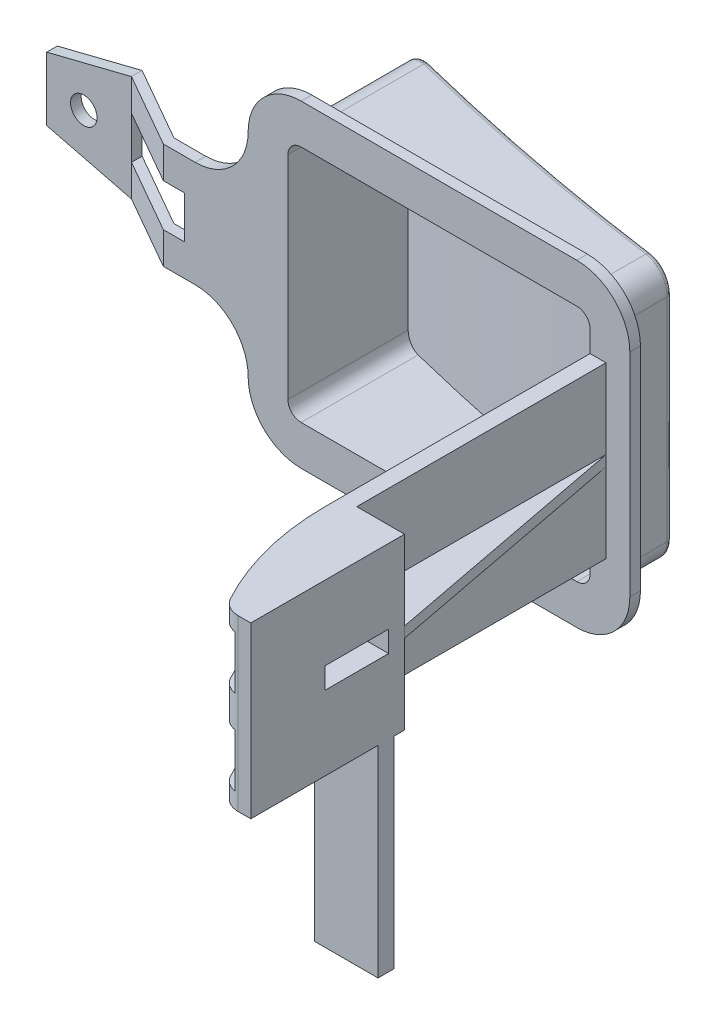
ISO-10303-21;
HEADER;
FILE_DESCRIPTION(('STEP AP214'),'2;1');
FILE_NAME('part.step','',(''),(''),'','','');
FILE_SCHEMA(('AUTOMOTIVE_DESIGN { 1 0 10303 214 1 1 1 1 }'));
ENDSEC;
DATA;
#1=APPLICATION_CONTEXT('core data for automotive mechanical design processes');
#2=APPLICATION_PROTOCOL_DEFINITION('international standard','automotive_design',2000,#1);
#3=PRODUCT_CONTEXT('',#1,'mechanical');
#4=PRODUCT('Part','Part','',(#3));
#5=PRODUCT_RELATED_PRODUCT_CATEGORY('part','',(#4));
#6=PRODUCT_DEFINITION_FORMATION('','',#4);
#7=PRODUCT_DEFINITION_CONTEXT('part definition',#1,'design');
#8=PRODUCT_DEFINITION('design','',#6,#7);
#9=PRODUCT_DEFINITION_SHAPE('','',#8);
#10=(LENGTH_UNIT() NAMED_UNIT(*) SI_UNIT(.MILLI.,.METRE.));
#11=(NAMED_UNIT(*) PLANE_ANGLE_UNIT() SI_UNIT($,.RADIAN.));
#12=(NAMED_UNIT(*) SI_UNIT($,.STERADIAN.) SOLID_ANGLE_UNIT());
#13=UNCERTAINTY_MEASURE_WITH_UNIT(LENGTH_MEASURE(1.E-05),#10,'distance_accuracy_value','');
#14=(GEOMETRIC_REPRESENTATION_CONTEXT(3) GLOBAL_UNCERTAINTY_ASSIGNED_CONTEXT((#13)) GLOBAL_UNIT_ASSIGNED_CONTEXT((#10,
#11,#12)) REPRESENTATION_CONTEXT('',''));
#15=CARTESIAN_POINT('',(0.,0.,0.));
#16=DIRECTION('',(0.,0.,1.));
#17=DIRECTION('',(1.,0.,0.));
#18=AXIS2_PLACEMENT_3D('',#15,#16,#17);
#19=CARTESIAN_POINT('',(82.25,-8.00000000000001,26.));
#20=DIRECTION('',(0.,1.,0.));
#21=DIRECTION('',(0.,0.,1.));
#22=AXIS2_PLACEMENT_3D('',#19,#20,#21);
#23=PLANE('',#22);
#24=DIRECTION('',(-1.,0.,0.));
#25=VECTOR('',#24,1.);
#26=CARTESIAN_POINT('',(86.75,-8.00000000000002,27.));
#27=LINE('',#26,#25);
#28=CARTESIAN_POINT('',(86.75,-8.00000000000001,27.));
#29=VERTEX_POINT('',#28);
#30=CARTESIAN_POINT('',(80.7700080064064,-8.00000000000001,27.));
#31=VERTEX_POINT('',#30);
#32=EDGE_CURVE('E50',#29,#31,#27,.T.);
#33=ORIENTED_EDGE('',*,*,#32,.F.);
#34=DIRECTION('',(0.,0.,-1.));
#35=VECTOR('',#34,1.);
#36=CARTESIAN_POINT('',(86.75,-8.00000000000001,26.));
#37=LINE('',#36,#35);
#38=CARTESIAN_POINT('',(86.75,-8.00000000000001,39.));
#39=VERTEX_POINT('',#38);
#40=EDGE_CURVE('E721',#39,#29,#37,.T.);
#41=ORIENTED_EDGE('',*,*,#40,.F.);
#42=DIRECTION('',(-1.,0.,0.));
#43=VECTOR('',#42,1.);
#44=CARTESIAN_POINT('',(86.75,-8.00000000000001,39.));
#45=LINE('',#44,#43);
#46=CARTESIAN_POINT('',(85.5509901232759,-8.00000000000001,39.));
#47=VERTEX_POINT('',#46);
#48=EDGE_CURVE('E607',#39,#47,#45,.T.);
#49=ORIENTED_EDGE('',*,*,#48,.T.);
#50=CARTESIAN_POINT('',(85.5509901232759,-8.00000000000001,37.));
#51=DIRECTION('',(0.,1.,0.));
#52=DIRECTION('',(0.,0.,1.));
#53=AXIS2_PLACEMENT_3D('',#50,#51,#52);
#54=CIRCLE('',#53,2.);
#55=CARTESIAN_POINT('',(83.7945544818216,-8.00000000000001,37.9565217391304));
#56=VERTEX_POINT('',#55);
#57=EDGE_CURVE('E11',#47,#56,#54,.F.);
#58=ORIENTED_EDGE('',*,*,#57,.T.);
#59=CARTESIAN_POINT('',(105.75,-8.00000000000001,26.));
#60=DIRECTION('',(0.,1.,0.));
#61=DIRECTION('',(0.,0.,1.));
#62=AXIS2_PLACEMENT_3D('',#59,#60,#61);
#63=CIRCLE('',#62,25.);
#64=EDGE_CURVE('E605',#56,#31,#63,.F.);
#65=ORIENTED_EDGE('',*,*,#64,.T.);
#66=EDGE_LOOP('',(#33,#41,#49,#58,#65));
#67=FACE_BOUND('',#66,.T.);
#68=ADVANCED_FACE('F32',(#67),#23,.F.);
#69=DIRECTION('',(1.,0.,0.));
#70=VECTOR('',#69,1.);
#71=CARTESIAN_POINT('',(86.75,-8.00000000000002,25.5));
#72=LINE('',#71,#70);
#73=CARTESIAN_POINT('',(80.75,-8.00000000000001,25.5));
#74=VERTEX_POINT('',#73);
#75=CARTESIAN_POINT('',(86.75,-8.00000000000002,25.5));
#76=VERTEX_POINT('',#75);
#77=EDGE_CURVE('E58',#74,#76,#72,.T.);
#78=ORIENTED_EDGE('',*,*,#77,.F.);
#79=DIRECTION('',(0.,0.,-1.));
#80=VECTOR('',#79,1.);
#81=CARTESIAN_POINT('',(80.75,-8.00000000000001,26.));
#82=LINE('',#81,#80);
#83=CARTESIAN_POINT('',(80.75,-8.00000000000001,1.));
#84=VERTEX_POINT('',#83);
#85=EDGE_CURVE('E37',#74,#84,#82,.T.);
#86=ORIENTED_EDGE('',*,*,#85,.T.);
#87=DIRECTION('',(1.,0.,0.));
#88=VECTOR('',#87,1.);
#89=CARTESIAN_POINT('',(82.25,-8.00000000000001,1.));
#90=LINE('',#89,#88);
#91=CARTESIAN_POINT('',(82.25,-8.00000000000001,1.));
#92=VERTEX_POINT('',#91);
#93=EDGE_CURVE('E749',#84,#92,#90,.T.);
#94=ORIENTED_EDGE('',*,*,#93,.T.);
#95=DIRECTION('',(0.,0.,-1.));
#96=VECTOR('',#95,1.);
#97=CARTESIAN_POINT('',(82.25,-8.00000000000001,26.));
#98=LINE('',#97,#96);
#99=CARTESIAN_POINT('',(82.25,-8.00000000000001,24.5));
#100=VERTEX_POINT('',#99);
#101=EDGE_CURVE('E836',#100,#92,#98,.T.);
#102=ORIENTED_EDGE('',*,*,#101,.F.);
#103=DIRECTION('',(-1.,0.,0.));
#104=VECTOR('',#103,1.);
#105=CARTESIAN_POINT('',(86.75,-8.00000000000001,24.5));
#106=LINE('',#105,#104);
#107=CARTESIAN_POINT('',(86.75,-8.00000000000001,24.5));
#108=VERTEX_POINT('',#107);
#109=EDGE_CURVE('E734',#108,#100,#106,.T.);
#110=ORIENTED_EDGE('',*,*,#109,.F.);
#111=EDGE_CURVE('E720',#76,#108,#37,.T.);
#112=ORIENTED_EDGE('',*,*,#111,.F.);
#113=EDGE_LOOP('',(#78,#86,#94,#102,#110,#112));
#114=FACE_BOUND('',#113,.T.);
#115=ADVANCED_FACE('F1074',(#114),#23,.F.);
#116=CARTESIAN_POINT('',(86.75,7.99999999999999,26.));
#117=DIRECTION('',(-1.,0.,0.));
#118=DIRECTION('',(0.,0.,1.));
#119=AXIS2_PLACEMENT_3D('',#116,#117,#118);
#120=PLANE('',#119);
#121=DIRECTION('',(0.,0.,1.));
#122=VECTOR('',#121,1.);
#123=CARTESIAN_POINT('',(86.75,7.99999999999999,26.));
#124=LINE('',#123,#122);
#125=CARTESIAN_POINT('',(86.75,7.99999999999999,24.5));
#126=VERTEX_POINT('',#125);
#127=CARTESIAN_POINT('',(86.75,7.99999999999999,39.));
#128=VERTEX_POINT('',#127);
#129=EDGE_CURVE('E727',#126,#128,#124,.T.);
#130=ORIENTED_EDGE('',*,*,#129,.T.);
#131=DIRECTION('',(0.,1.,0.));
#132=VECTOR('',#131,1.);
#133=CARTESIAN_POINT('',(86.75,-22.3178210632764,39.));
#134=LINE('',#133,#132);
#135=EDGE_CURVE('E615',#39,#128,#134,.T.);
#136=ORIENTED_EDGE('',*,*,#135,.F.);
#137=ORIENTED_EDGE('',*,*,#40,.T.);
#138=DIRECTION('',(0.,1.,0.));
#139=VECTOR('',#138,1.);
#140=CARTESIAN_POINT('',(86.75,-27.,27.));
#141=LINE('',#140,#139);
#142=CARTESIAN_POINT('',(86.75,-27.,27.));
#143=VERTEX_POINT('',#142);
#144=EDGE_CURVE('E487',#143,#29,#141,.T.);
#145=ORIENTED_EDGE('',*,*,#144,.F.);
#146=DIRECTION('',(0.,0.,1.));
#147=VECTOR('',#146,1.);
#148=CARTESIAN_POINT('',(86.75,-27.,27.));
#149=LINE('',#148,#147);
#150=CARTESIAN_POINT('',(86.75,-27.,25.5));
#151=VERTEX_POINT('',#150);
#152=EDGE_CURVE('E493',#151,#143,#149,.T.);
#153=ORIENTED_EDGE('',*,*,#152,.F.);
#154=DIRECTION('',(0.,1.,0.));
#155=VECTOR('',#154,1.);
#156=CARTESIAN_POINT('',(86.75,-27.,25.5));
#157=LINE('',#156,#155);
#158=EDGE_CURVE('E503',#151,#76,#157,.T.);
#159=ORIENTED_EDGE('',*,*,#158,.T.);
#160=ORIENTED_EDGE('',*,*,#111,.T.);
#161=DIRECTION('',(0.,1.,0.));
#162=VECTOR('',#161,1.);
#163=CARTESIAN_POINT('',(86.75,-8.00000000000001,24.5));
#164=LINE('',#163,#162);
#165=CARTESIAN_POINT('',(86.75,-0.5,24.5));
#166=VERTEX_POINT('',#165);
#167=EDGE_CURVE('E724',#108,#166,#164,.T.);
#168=ORIENTED_EDGE('',*,*,#167,.T.);
#169=CARTESIAN_POINT('',(86.75,0.5,24.5));
#170=VERTEX_POINT('',#169);
#171=EDGE_CURVE('E728',#166,#170,#164,.T.);
#172=ORIENTED_EDGE('',*,*,#171,.T.);
#173=EDGE_CURVE('E723',#170,#126,#164,.T.);
#174=ORIENTED_EDGE('',*,*,#173,.T.);
#175=EDGE_LOOP('',(#130,#136,#137,#145,#153,#159,#160,#168,#172,#174));
#176=FACE_BOUND('',#175,.T.);
#177=DIRECTION('',(0.,0.,-1.));
#178=VECTOR('',#177,1.);
#179=CARTESIAN_POINT('',(86.75,-1.,26.));
#180=LINE('',#179,#178);
#181=CARTESIAN_POINT('',(86.75,-1.,32.));
#182=VERTEX_POINT('',#181);
#183=CARTESIAN_POINT('',(86.75,-1.,26.));
#184=VERTEX_POINT('',#183);
#185=EDGE_CURVE('E521',#182,#184,#180,.T.);
#186=ORIENTED_EDGE('',*,*,#185,.F.);
#187=DIRECTION('',(0.,1.,0.));
#188=VECTOR('',#187,1.);
#189=CARTESIAN_POINT('',(86.75,-1.,32.));
#190=LINE('',#189,#188);
#191=CARTESIAN_POINT('',(86.75,1.,32.));
#192=VERTEX_POINT('',#191);
#193=EDGE_CURVE('E534',#182,#192,#190,.T.);
#194=ORIENTED_EDGE('',*,*,#193,.T.);
#195=DIRECTION('',(0.,0.,-1.));
#196=VECTOR('',#195,1.);
#197=CARTESIAN_POINT('',(86.75,1.,26.));
#198=LINE('',#197,#196);
#199=CARTESIAN_POINT('',(86.75,1.,26.));
#200=VERTEX_POINT('',#199);
#201=EDGE_CURVE('E509',#192,#200,#198,.T.);
#202=ORIENTED_EDGE('',*,*,#201,.T.);
#203=DIRECTION('',(0.,1.,0.));
#204=VECTOR('',#203,1.);
#205=CARTESIAN_POINT('',(86.75,-1.,26.));
#206=LINE('',#205,#204);
#207=EDGE_CURVE('E533',#184,#200,#206,.T.);
#208=ORIENTED_EDGE('',*,*,#207,.F.);
#209=EDGE_LOOP('',(#186,#194,#202,#208));
#210=FACE_BOUND('',#209,.T.);
#211=ADVANCED_FACE('F1079',(#176,#210),#120,.F.);
#212=CARTESIAN_POINT('',(105.75,-22.3178210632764,26.));
#213=DIRECTION('',(0.,1.,0.));
#214=DIRECTION('',(0.,0.,1.));
#215=AXIS2_PLACEMENT_3D('',#212,#213,#214);
#216=CYLINDRICAL_SURFACE('',#215,25.);
#217=DIRECTION('',(0.,-1.,0.));
#218=VECTOR('',#217,1.);
#219=CARTESIAN_POINT('',(80.75,-8.00000000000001,26.));
#220=LINE('',#219,#218);
#221=CARTESIAN_POINT('',(80.75,1.5,26.));
#222=VERTEX_POINT('',#221);
#223=CARTESIAN_POINT('',(80.75,-1.5,26.));
#224=VERTEX_POINT('',#223);
#225=EDGE_CURVE('E833',#222,#224,#220,.T.);
#226=ORIENTED_EDGE('',*,*,#225,.T.);
#227=CARTESIAN_POINT('',(105.75,-1.5,26.));
#228=DIRECTION('',(0.,1.,0.));
#229=DIRECTION('',(0.,0.,1.));
#230=AXIS2_PLACEMENT_3D('',#227,#228,#229);
#231=CIRCLE('',#230,25.);
#232=CARTESIAN_POINT('',(83.7945544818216,-1.5,37.9565217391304));
#233=VERTEX_POINT('',#232);
#234=EDGE_CURVE('E562',#224,#233,#231,.T.);
#235=ORIENTED_EDGE('',*,*,#234,.T.);
#236=DIRECTION('',(0.,1.,0.));
#237=VECTOR('',#236,1.);
#238=CARTESIAN_POINT('',(83.7945544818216,-22.3178210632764,37.9565217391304));
#239=LINE('',#238,#237);
#240=CARTESIAN_POINT('',(83.7945544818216,1.5,37.9565217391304));
#241=VERTEX_POINT('',#240);
#242=EDGE_CURVE('E813',#233,#241,#239,.T.);
#243=ORIENTED_EDGE('',*,*,#242,.T.);
#244=CARTESIAN_POINT('',(105.75,1.5,26.));
#245=DIRECTION('',(0.,1.,0.));
#246=DIRECTION('',(0.,0.,1.));
#247=AXIS2_PLACEMENT_3D('',#244,#245,#246);
#248=CIRCLE('',#247,25.);
#249=EDGE_CURVE('E586',#222,#241,#248,.T.);
#250=ORIENTED_EDGE('',*,*,#249,.F.);
#251=EDGE_LOOP('',(#226,#235,#243,#250));
#252=FACE_BOUND('',#251,.T.);
#253=ADVANCED_FACE('F1187',(#252),#216,.T.);
#254=CARTESIAN_POINT('',(85.5509901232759,-22.3178210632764,37.));
#255=DIRECTION('',(0.,1.,0.));
#256=DIRECTION('',(0.,0.,1.));
#257=AXIS2_PLACEMENT_3D('',#254,#255,#256);
#258=CYLINDRICAL_SURFACE('',#257,2.);
#259=ORIENTED_EDGE('',*,*,#242,.F.);
#260=CARTESIAN_POINT('',(85.5509901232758,-1.5,37.));
#261=DIRECTION('',(0.,1.,0.));
#262=DIRECTION('',(0.,0.,1.));
#263=AXIS2_PLACEMENT_3D('',#260,#261,#262);
#264=CIRCLE('',#263,1.99999999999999);
#265=CARTESIAN_POINT('',(85.25,-1.5,38.9772215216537));
#266=VERTEX_POINT('',#265);
#267=EDGE_CURVE('E565',#233,#266,#264,.T.);
#268=ORIENTED_EDGE('',*,*,#267,.T.);
#269=DIRECTION('',(0.,1.,0.));
#270=VECTOR('',#269,1.);
#271=CARTESIAN_POINT('',(85.25,-20.2352931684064,38.9772215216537));
#272=LINE('',#271,#270);
#273=CARTESIAN_POINT('',(85.25,-6.49999999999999,38.9772215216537));
#274=VERTEX_POINT('',#273);
#275=EDGE_CURVE('E571',#274,#266,#272,.T.);
#276=ORIENTED_EDGE('',*,*,#275,.F.);
#277=CARTESIAN_POINT('',(85.5509901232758,-6.49999999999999,37.));
#278=DIRECTION('',(0.,1.,0.));
#279=DIRECTION('',(0.,0.,1.));
#280=AXIS2_PLACEMENT_3D('',#277,#278,#279);
#281=CIRCLE('',#280,1.99999999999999);
#282=CARTESIAN_POINT('',(83.7945544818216,-6.49999999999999,37.9565217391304));
#283=VERTEX_POINT('',#282);
#284=EDGE_CURVE('E537',#283,#274,#281,.T.);
#285=ORIENTED_EDGE('',*,*,#284,.F.);
#286=EDGE_CURVE('E809',#56,#283,#239,.T.);
#287=ORIENTED_EDGE('',*,*,#286,.F.);
#288=ORIENTED_EDGE('',*,*,#57,.F.);
#289=DIRECTION('',(0.,1.,0.));
#290=VECTOR('',#289,1.);
#291=CARTESIAN_POINT('',(85.5509901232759,-22.3178210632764,39.));
#292=LINE('',#291,#290);
#293=CARTESIAN_POINT('',(85.5509901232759,7.99999999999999,39.));
#294=VERTEX_POINT('',#293);
#295=EDGE_CURVE('E43',#294,#47,#292,.F.);
#296=ORIENTED_EDGE('',*,*,#295,.F.);
#297=CARTESIAN_POINT('',(85.5509901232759,7.99999999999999,37.));
#298=DIRECTION('',(0.,-1.,0.));
#299=DIRECTION('',(0.,0.,-1.));
#300=AXIS2_PLACEMENT_3D('',#297,#298,#299);
#301=CIRCLE('',#300,2.);
#302=CARTESIAN_POINT('',(83.7945544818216,7.99999999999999,37.9565217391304));
#303=VERTEX_POINT('',#302);
#304=EDGE_CURVE('E812',#303,#294,#301,.F.);
#305=ORIENTED_EDGE('',*,*,#304,.F.);
#306=CARTESIAN_POINT('',(83.7945544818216,6.49999999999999,37.9565217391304));
#307=VERTEX_POINT('',#306);
#308=EDGE_CURVE('E808',#307,#303,#239,.T.);
#309=ORIENTED_EDGE('',*,*,#308,.F.);
#310=CARTESIAN_POINT('',(85.5509901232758,6.49999999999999,37.));
#311=DIRECTION('',(0.,1.,0.));
#312=DIRECTION('',(0.,0.,1.));
#313=AXIS2_PLACEMENT_3D('',#310,#311,#312);
#314=CIRCLE('',#313,1.99999999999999);
#315=CARTESIAN_POINT('',(85.25,6.49999999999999,38.9772215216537));
#316=VERTEX_POINT('',#315);
#317=EDGE_CURVE('E593',#307,#316,#314,.T.);
#318=ORIENTED_EDGE('',*,*,#317,.T.);
#319=DIRECTION('',(0.,-1.,0.));
#320=VECTOR('',#319,1.);
#321=CARTESIAN_POINT('',(85.25,20.2352931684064,38.9772215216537));
#322=LINE('',#321,#320);
#323=CARTESIAN_POINT('',(85.25,1.5,38.9772215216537));
#324=VERTEX_POINT('',#323);
#325=EDGE_CURVE('E583',#316,#324,#322,.T.);
#326=ORIENTED_EDGE('',*,*,#325,.T.);
#327=CARTESIAN_POINT('',(85.5509901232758,1.5,37.));
#328=DIRECTION('',(0.,1.,0.));
#329=DIRECTION('',(0.,0.,1.));
#330=AXIS2_PLACEMENT_3D('',#327,#328,#329);
#331=CIRCLE('',#330,1.99999999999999);
#332=EDGE_CURVE('E584',#241,#324,#331,.T.);
#333=ORIENTED_EDGE('',*,*,#332,.F.);
#334=EDGE_LOOP('',(#259,#268,#276,#285,#287,#288,#296,#305,#309,#318,#326,#333));
#335=FACE_BOUND('',#334,.T.);
#336=ADVANCED_FACE('F827',(#335),#258,.T.);
#337=CARTESIAN_POINT('',(105.75,-6.49999999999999,26.));
#338=DIRECTION('',(0.,1.,0.));
#339=DIRECTION('',(0.,0.,1.));
#340=AXIS2_PLACEMENT_3D('',#337,#338,#339);
#341=CIRCLE('',#340,25.);
#342=CARTESIAN_POINT('',(80.75,-6.49999999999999,26.));
#343=VERTEX_POINT('',#342);
#344=EDGE_CURVE('E551',#343,#283,#341,.T.);
#345=ORIENTED_EDGE('',*,*,#344,.F.);
#346=CARTESIAN_POINT('',(80.75,-8.00000000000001,26.));
#347=VERTEX_POINT('',#346);
#348=EDGE_CURVE('E761',#343,#347,#220,.T.);
#349=ORIENTED_EDGE('',*,*,#348,.T.);
#350=EDGE_CURVE('E491',#31,#347,#63,.F.);
#351=ORIENTED_EDGE('',*,*,#350,.F.);
#352=ORIENTED_EDGE('',*,*,#64,.F.);
#353=ORIENTED_EDGE('',*,*,#286,.T.);
#354=EDGE_LOOP('',(#345,#349,#351,#352,#353));
#355=FACE_BOUND('',#354,.T.);
#356=ADVANCED_FACE('F832',(#355),#216,.T.);
#357=CARTESIAN_POINT('',(40.5,5.,0.));
#358=DIRECTION('',(-0.496138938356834,0.,0.868243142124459));
#359=DIRECTION('',(0.868243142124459,0.,0.496138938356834));
#360=AXIS2_PLACEMENT_3D('',#357,#358,#359);
#361=PLANE('',#360);
#362=DIRECTION('',(0.,-1.,0.));
#363=VECTOR('',#362,1.);
#364=CARTESIAN_POINT('',(33.5,5.,-4.));
#365=LINE('',#364,#363);
#366=CARTESIAN_POINT('',(33.5,-2.00000000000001,-4.));
#367=VERTEX_POINT('',#366);
#368=CARTESIAN_POINT('',(33.5,-5.,-4.));
#369=VERTEX_POINT('',#368);
#370=EDGE_CURVE('E691',#367,#369,#365,.T.);
#371=ORIENTED_EDGE('',*,*,#370,.F.);
#372=DIRECTION('',(0.868243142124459,0.,0.496138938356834));
#373=VECTOR('',#372,1.);
#374=CARTESIAN_POINT('',(40.5,-2.00000000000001,0.));
#375=LINE('',#374,#373);
#376=CARTESIAN_POINT('',(40.5,-2.00000000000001,0.));
#377=VERTEX_POINT('',#376);
#378=EDGE_CURVE('E646',#367,#377,#375,.T.);
#379=ORIENTED_EDGE('',*,*,#378,.T.);
#380=DIRECTION('',(0.,-1.,0.));
#381=VECTOR('',#380,1.);
#382=CARTESIAN_POINT('',(40.5,5.,0.));
#383=LINE('',#382,#381);
#384=CARTESIAN_POINT('',(40.5,-5.,0.));
#385=VERTEX_POINT('',#384);
#386=EDGE_CURVE('E695',#377,#385,#383,.T.);
#387=ORIENTED_EDGE('',*,*,#386,.T.);
#388=DIRECTION('',(-0.868243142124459,0.,-0.496138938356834));
#389=VECTOR('',#388,1.);
#390=CARTESIAN_POINT('',(40.5,-5.,0.));
#391=LINE('',#390,#389);
#392=EDGE_CURVE('E657',#385,#369,#391,.T.);
#393=ORIENTED_EDGE('',*,*,#392,.T.);
#394=EDGE_LOOP('',(#371,#379,#387,#393));
#395=FACE_BOUND('',#394,.T.);
#396=ADVANCED_FACE('F1106',(#395),#361,.F.);
#397=CARTESIAN_POINT('',(33.5,5.,-2.99999999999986));
#398=DIRECTION('',(0.496138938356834,0.,-0.868243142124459));
#399=DIRECTION('',(-0.868243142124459,0.,-0.496138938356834));
#400=AXIS2_PLACEMENT_3D('',#397,#398,#399);
#401=PLANE('',#400);
#402=DIRECTION('',(0.,-1.,0.));
#403=VECTOR('',#402,1.);
#404=CARTESIAN_POINT('',(40.5,5.,1.00000000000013));
#405=LINE('',#404,#403);
#406=CARTESIAN_POINT('',(40.5,-2.00000000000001,1.00000000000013));
#407=VERTEX_POINT('',#406);
#408=CARTESIAN_POINT('',(40.5,-5.,1.00000000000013));
#409=VERTEX_POINT('',#408);
#410=EDGE_CURVE('E676',#407,#409,#405,.T.);
#411=ORIENTED_EDGE('',*,*,#410,.F.);
#412=DIRECTION('',(-0.868243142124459,0.,-0.496138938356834));
#413=VECTOR('',#412,1.);
#414=CARTESIAN_POINT('',(33.5,-2.00000000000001,-2.99999999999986));
#415=LINE('',#414,#413);
#416=CARTESIAN_POINT('',(33.5,-2.00000000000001,-2.99999999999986));
#417=VERTEX_POINT('',#416);
#418=EDGE_CURVE('E802',#407,#417,#415,.T.);
#419=ORIENTED_EDGE('',*,*,#418,.T.);
#420=DIRECTION('',(0.,-1.,0.));
#421=VECTOR('',#420,1.);
#422=CARTESIAN_POINT('',(33.5,5.,-2.99999999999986));
#423=LINE('',#422,#421);
#424=CARTESIAN_POINT('',(33.5,-5.,-2.99999999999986));
#425=VERTEX_POINT('',#424);
#426=EDGE_CURVE('E680',#417,#425,#423,.T.);
#427=ORIENTED_EDGE('',*,*,#426,.T.);
#428=DIRECTION('',(0.868243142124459,0.,0.496138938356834));
#429=VECTOR('',#428,1.);
#430=CARTESIAN_POINT('',(33.5,-5.,-2.99999999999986));
#431=LINE('',#430,#429);
#432=EDGE_CURVE('E660',#425,#409,#431,.T.);
#433=ORIENTED_EDGE('',*,*,#432,.T.);
#434=EDGE_LOOP('',(#411,#419,#427,#433));
#435=FACE_BOUND('',#434,.T.);
#436=ADVANCED_FACE('F1102',(#435),#401,.F.);
#437=CARTESIAN_POINT('',(82.25,-8.00000000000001,26.));
#438=DIRECTION('',(-1.,0.,0.));
#439=DIRECTION('',(0.,0.,1.));
#440=AXIS2_PLACEMENT_3D('',#437,#438,#439);
#441=PLANE('',#440);
#442=DIRECTION('',(0.,0.,-1.));
#443=VECTOR('',#442,1.);
#444=CARTESIAN_POINT('',(82.25,-0.5,26.));
#445=LINE('',#444,#443);
#446=CARTESIAN_POINT('',(82.25,-0.5,24.5));
#447=VERTEX_POINT('',#446);
#448=CARTESIAN_POINT('',(82.25,-0.5,1.));
#449=VERTEX_POINT('',#448);
#450=EDGE_CURVE('E706',#447,#449,#445,.T.);
#451=ORIENTED_EDGE('',*,*,#450,.F.);
#452=DIRECTION('',(0.,1.,0.));
#453=VECTOR('',#452,1.);
#454=CARTESIAN_POINT('',(82.25,-8.00000000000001,24.5));
#455=LINE('',#454,#453);
#456=EDGE_CURVE('E717',#100,#447,#455,.T.);
#457=ORIENTED_EDGE('',*,*,#456,.F.);
#458=ORIENTED_EDGE('',*,*,#101,.T.);
#459=DIRECTION('',(0.,1.,0.));
#460=VECTOR('',#459,1.);
#461=CARTESIAN_POINT('',(82.25,-8.00000000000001,1.));
#462=LINE('',#461,#460);
#463=EDGE_CURVE('E737',#92,#449,#462,.T.);
#464=ORIENTED_EDGE('',*,*,#463,.T.);
#465=EDGE_LOOP('',(#451,#457,#458,#464));
#466=FACE_BOUND('',#465,.T.);
#467=ADVANCED_FACE('F1091',(#466),#441,.F.);
#468=CARTESIAN_POINT('',(86.75,-8.00000000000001,24.5));
#469=DIRECTION('',(0.,0.,1.));
#470=DIRECTION('',(1.,0.,0.));
#471=AXIS2_PLACEMENT_3D('',#468,#469,#470);
#472=PLANE('',#471);
#473=DIRECTION('',(-1.,0.,0.));
#474=VECTOR('',#473,1.);
#475=CARTESIAN_POINT('',(86.75,-0.5,24.5));
#476=LINE('',#475,#474);
#477=EDGE_CURVE('E704',#166,#447,#476,.T.);
#478=ORIENTED_EDGE('',*,*,#477,.F.);
#479=ORIENTED_EDGE('',*,*,#167,.F.);
#480=ORIENTED_EDGE('',*,*,#109,.T.);
#481=ORIENTED_EDGE('',*,*,#456,.T.);
#482=EDGE_LOOP('',(#478,#479,#480,#481));
#483=FACE_BOUND('',#482,.T.);
#484=ADVANCED_FACE('F1089',(#483),#472,.F.);
#485=CARTESIAN_POINT('',(82.25,0.5,24.5));
#486=VERTEX_POINT('',#485);
#487=CARTESIAN_POINT('',(82.25,7.99999999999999,24.5));
#488=VERTEX_POINT('',#487);
#489=EDGE_CURVE('E716',#486,#488,#455,.T.);
#490=ORIENTED_EDGE('',*,*,#489,.F.);
#491=DIRECTION('',(0.,0.,-1.));
#492=VECTOR('',#491,1.);
#493=CARTESIAN_POINT('',(82.25,0.5,26.));
#494=LINE('',#493,#492);
#495=CARTESIAN_POINT('',(82.25,0.5,1.));
#496=VERTEX_POINT('',#495);
#497=EDGE_CURVE('E711',#486,#496,#494,.T.);
#498=ORIENTED_EDGE('',*,*,#497,.T.);
#499=CARTESIAN_POINT('',(82.25,7.99999999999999,1.));
#500=VERTEX_POINT('',#499);
#501=EDGE_CURVE('E736',#496,#500,#462,.T.);
#502=ORIENTED_EDGE('',*,*,#501,.T.);
#503=DIRECTION('',(0.,0.,-1.));
#504=VECTOR('',#503,1.);
#505=CARTESIAN_POINT('',(82.25,7.99999999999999,26.));
#506=LINE('',#505,#504);
#507=EDGE_CURVE('E756',#488,#500,#506,.T.);
#508=ORIENTED_EDGE('',*,*,#507,.F.);
#509=EDGE_LOOP('',(#490,#498,#502,#508));
#510=FACE_BOUND('',#509,.T.);
#511=ADVANCED_FACE('F1086',(#510),#441,.F.);
#512=CARTESIAN_POINT('',(53.5,-9.99999999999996,-23.7735200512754));
#513=DIRECTION('',(0.,0.,1.));
#514=DIRECTION('',(1.,0.,0.));
#515=AXIS2_PLACEMENT_3D('',#512,#513,#514);
#516=CYLINDRICAL_SURFACE('',#515,2.25);
#517=DIRECTION('',(0.,0.,1.));
#518=VECTOR('',#517,1.);
#519=CARTESIAN_POINT('',(51.25,-9.99999999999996,-23.7735200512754));
#520=LINE('',#519,#518);
#521=CARTESIAN_POINT('',(51.25,-9.99999999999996,-10.9902281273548));
#522=VERTEX_POINT('',#521);
#523=CARTESIAN_POINT('',(51.25,-9.99999999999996,0.));
#524=VERTEX_POINT('',#523);
#525=EDGE_CURVE('E1984',#522,#524,#520,.T.);
#526=ORIENTED_EDGE('',*,*,#525,.F.);
#527=CARTESIAN_POINT('',(51.9682768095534,-9.43426439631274,-11.4503901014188));
#528=CARTESIAN_POINT('',(51.3878036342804,-9.22289770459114,-11.5993845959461));
#529=CARTESIAN_POINT('',(51.3708155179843,-9.2726256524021,-10.9660893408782));
#530=CARTESIAN_POINT('',(51.9528112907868,-9.47962527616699,-11.4543598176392));
#531=CARTESIAN_POINT('',(51.3651778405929,-9.28467407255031,-11.6052318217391));
#532=CARTESIAN_POINT('',(51.3508915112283,-9.33094678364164,-10.9700669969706));
#533=CARTESIAN_POINT('',(51.9392018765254,-9.52563992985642,-11.4578545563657));
#534=CARTESIAN_POINT('',(51.3452451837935,-9.34745531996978,-11.6103857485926));
#535=CARTESIAN_POINT('',(51.3333586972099,-9.3901084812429,-10.973568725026));
#536=CARTESIAN_POINT('',(51.9157862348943,-9.61869282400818,-11.4638690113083));
#537=CARTESIAN_POINT('',(51.3108640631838,-9.47481936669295,-11.6192785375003));
#538=CARTESIAN_POINT('',(51.303192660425,-9.50974791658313,-10.9795952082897));
#539=CARTESIAN_POINT('',(51.9059799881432,-9.66573105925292,-11.4663887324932));
#540=CARTESIAN_POINT('',(51.2964404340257,-9.53936009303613,-11.6230109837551));
#541=CARTESIAN_POINT('',(51.2905594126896,-9.57022564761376,-10.9821199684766));
#542=CARTESIAN_POINT('',(51.8824306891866,-9.80778439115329,-11.4724405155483));
#543=CARTESIAN_POINT('',(51.2617080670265,-9.73486046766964,-11.6320002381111));
#544=CARTESIAN_POINT('',(51.2602211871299,-9.75286564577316,-10.9881838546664));
#545=CARTESIAN_POINT('',(51.8745004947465,-9.90390427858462,-11.4744797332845));
#546=CARTESIAN_POINT('',(51.2500053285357,-9.86734444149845,-11.635031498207));
#547=CARTESIAN_POINT('',(51.2500048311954,-9.87644835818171,-10.9902271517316));
#548=CARTESIAN_POINT('',(51.8744929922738,-10.0961507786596,-11.474481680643));
#549=CARTESIAN_POINT('',(51.2499946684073,-10.1327316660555,-11.6350342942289));
#550=CARTESIAN_POINT('',(51.2499951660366,-10.1236224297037,-10.9902291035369));
#551=CARTESIAN_POINT('',(51.8824247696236,-10.1922773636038,-11.4724420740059));
#552=CARTESIAN_POINT('',(51.2617001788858,-10.2652237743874,-11.6320023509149));
#553=CARTESIAN_POINT('',(51.2602135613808,-10.2472137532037,-10.9881854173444));
#554=CARTESIAN_POINT('',(51.9138672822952,-10.3817487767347,-11.4643617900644));
#555=CARTESIAN_POINT('',(51.3080369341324,-10.5257854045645,-11.6200095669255));
#556=CARTESIAN_POINT('',(51.3007205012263,-10.4908198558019,-10.980088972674));
#557=CARTESIAN_POINT('',(51.9373744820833,-10.4750942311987,-11.4583220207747));
#558=CARTESIAN_POINT('',(51.342523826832,-10.6534786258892,-11.6110860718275));
#559=CARTESIAN_POINT('',(51.3310044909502,-10.6108354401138,-10.9740371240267));
#560=CARTESIAN_POINT('',(51.9991601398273,-10.6563212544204,-11.4424630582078));
#561=CARTESIAN_POINT('',(51.4327892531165,-10.8999227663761,-11.5877591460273));
#562=CARTESIAN_POINT('',(51.4106020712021,-10.843841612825,-10.9581464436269));
#563=CARTESIAN_POINT('',(52.0374295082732,-10.7442061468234,-11.4326461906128));
#564=CARTESIAN_POINT('',(51.48830606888,-11.018393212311,-11.5734232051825));
#565=CARTESIAN_POINT('',(51.4599039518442,-10.9568364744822,-10.9483099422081));
#566=CARTESIAN_POINT('',(52.1275094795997,-10.9122172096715,-11.4095699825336));
#567=CARTESIAN_POINT('',(51.6181391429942,-11.2427582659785,-11.5399535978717));
#568=CARTESIAN_POINT('',(51.5759526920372,-11.1728506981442,-10.9251875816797));
#569=CARTESIAN_POINT('',(52.1793225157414,-10.9923419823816,-11.3963100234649));
#570=CARTESIAN_POINT('',(51.6921492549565,-11.3484907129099,-11.5208984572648));
#571=CARTESIAN_POINT('',(51.6427026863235,-11.2758682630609,-10.9119011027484));
#572=CARTESIAN_POINT('',(52.2956943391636,-11.1438015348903,-11.3665776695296));
#573=CARTESIAN_POINT('',(51.8570121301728,-11.5458157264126,-11.4785401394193));
#574=CARTESIAN_POINT('',(51.7926228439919,-11.4706019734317,-10.8821092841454));
#575=CARTESIAN_POINT('',(52.3604184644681,-11.2150004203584,-11.3500636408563));
#576=CARTESIAN_POINT('',(51.9477644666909,-11.637179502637,-11.4552630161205));
#577=CARTESIAN_POINT('',(51.8760060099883,-11.5621433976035,-10.8655622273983));
#578=CARTESIAN_POINT('',(52.5002335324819,-11.3455542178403,-11.314460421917));
#579=CARTESIAN_POINT('',(52.1419841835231,-11.8019378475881,-11.4055694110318));
#580=CARTESIAN_POINT('',(52.0561277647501,-11.7299982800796,-10.8298878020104));
#581=CARTESIAN_POINT('',(52.5753267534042,-11.404906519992,-11.2953706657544));
#582=CARTESIAN_POINT('',(52.2451598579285,-11.8754225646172,-11.379226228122));
#583=CARTESIAN_POINT('',(52.152869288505,-11.8063083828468,-10.810759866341));
#584=CARTESIAN_POINT('',(52.7361474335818,-11.5119628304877,-11.2545769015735));
#585=CARTESIAN_POINT('',(52.4639256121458,-12.0050320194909,-11.3235216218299));
#586=CARTESIAN_POINT('',(52.3600522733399,-11.9439522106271,-10.7698845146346));
#587=CARTESIAN_POINT('',(52.8221265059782,-11.5592635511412,-11.232811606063));
#588=CARTESIAN_POINT('',(52.5795961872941,-12.06079560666,-11.2941420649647));
#589=CARTESIAN_POINT('',(52.4708178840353,-12.0047674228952,-10.7480756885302));
#590=CARTESIAN_POINT('',(53.0003868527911,-11.6386996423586,-11.1877950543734));
#591=CARTESIAN_POINT('',(52.8170211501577,-12.1511968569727,-11.234018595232));
#592=CARTESIAN_POINT('',(52.7004681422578,-12.1068995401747,-10.7029691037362));
#593=CARTESIAN_POINT('',(53.0926644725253,-11.6708437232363,-11.1645446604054));
#594=CARTESIAN_POINT('',(52.9386182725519,-12.1861122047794,-11.2033119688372));
#595=CARTESIAN_POINT('',(52.81934808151,-12.1482276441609,-10.6796722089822));
#596=CARTESIAN_POINT('',(53.2577384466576,-11.7133004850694,-11.123057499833));
#597=CARTESIAN_POINT('',(53.1544227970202,-12.2288224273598,-11.1489847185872));
#598=CARTESIAN_POINT('',(53.0320105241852,-12.2028149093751,-10.6381020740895));
#599=CARTESIAN_POINT('',(53.3297224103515,-11.7270431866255,-11.1049994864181));
#600=CARTESIAN_POINT('',(53.2476755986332,-12.2412731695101,-11.1255618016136));
#601=CARTESIAN_POINT('',(53.1247464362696,-12.2204840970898,-10.6200079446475));
#602=CARTESIAN_POINT('',(53.4747942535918,-11.7453962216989,-11.0686763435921));
#603=CARTESIAN_POINT('',(53.4343101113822,-12.2543512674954,-11.0787935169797));
#604=CARTESIAN_POINT('',(53.3116404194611,-12.2440808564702,-10.5836121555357));
#605=CARTESIAN_POINT('',(53.5478822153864,-11.7500058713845,-11.050411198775));
#606=CARTESIAN_POINT('',(53.5276980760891,-12.2551004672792,-11.055445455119));
#607=CARTESIAN_POINT('',(53.4057985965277,-12.2500075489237,-10.5653104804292));
#608=CARTESIAN_POINT('',(53.7211854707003,-11.7499919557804,-11.0071860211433));
#609=CARTESIAN_POINT('',(53.747314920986,-12.2430953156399,-11.000668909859));
#610=CARTESIAN_POINT('',(53.6290627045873,-12.249989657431,-10.5219988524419));
#611=CARTESIAN_POINT('',(53.8214301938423,-11.7413201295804,-10.9822498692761));
#612=CARTESIAN_POINT('',(53.8735410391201,-12.2254662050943,-10.969287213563));
#613=CARTESIAN_POINT('',(53.7582065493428,-12.238840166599,-10.4970128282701));
#614=CARTESIAN_POINT('',(54.0194747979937,-11.7068513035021,-10.9331112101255));
#615=CARTESIAN_POINT('',(54.120859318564,-12.1692002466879,-10.90798955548));
#616=CARTESIAN_POINT('',(54.0133445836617,-12.1945231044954,-10.4477758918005));
#617=CARTESIAN_POINT('',(54.1172657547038,-11.6809991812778,-10.9089113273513));
#618=CARTESIAN_POINT('',(54.2421019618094,-12.1307450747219,-10.8780344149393));
#619=CARTESIAN_POINT('',(54.1393272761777,-12.1612846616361,-10.4235276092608));
#620=CARTESIAN_POINT('',(54.2122072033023,-11.6466872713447,-10.8854791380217));
#621=CARTESIAN_POINT('',(54.3597699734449,-12.0818673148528,-10.8490554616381));
#622=CARTESIAN_POINT('',(54.2616389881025,-12.1171693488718,-10.4000485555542));
#623=(BOUNDED_SURFACE() B_SPLINE_SURFACE(3,2,((#527,#528,#529),(#530,#531,#532),(#533,#534,
#535),(#536,#537,#538),(#539,#540,#541),(#542,#543,#544),(#545,#546,#547),(#548,#549,#550),
(#551,#552,#553),(#554,#555,#556),(#557,#558,#559),(#560,#561,#562),(#563,#564,#565),(#566,#567,
#568),(#569,#570,#571),(#572,#573,#574),(#575,#576,#577),(#578,#579,#580),(#581,#582,#583),
(#584,#585,#586),(#587,#588,#589),(#590,#591,#592),(#593,#594,#595),(#596,#597,#598),(#599,#600,
#601),(#602,#603,#604),(#605,#606,#607),(#608,#609,#610),(#611,#612,#613),(#614,#615,#616),
(#617,#618,#619),(#620,#621,#622)),.UNSPECIFIED.,.F.,.F.,.F.) B_SPLINE_SURFACE_WITH_KNOTS((4,2,
2,2,2,2,2,2,2,2,2,2,2,2,2,4),(3,3),(0.,0.144211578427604,0.288422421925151,0.576322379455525,
0.864387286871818,1.15238682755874,1.44020932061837,1.72808355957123,2.01991301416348,
2.3118066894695,2.61246526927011,2.91295085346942,3.13927988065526,3.36562585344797,
3.67573613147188,3.98684622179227),(0.,1.),
.UNSPECIFIED.) GEOMETRIC_REPRESENTATION_ITEM() RATIONAL_B_SPLINE_SURFACE(((1.,0.618357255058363,
1.),(1.,0.617443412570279,1.),(1.,0.61663675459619,1.),(1.,0.615246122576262,1.),(1.,
0.614662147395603,1.),(1.,0.613258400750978,1.),(1.,0.612783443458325,1.),(1.,0.612782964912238,
1.),(1.,0.613257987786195,1.),(1.,0.615132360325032,1.),(1.,0.616531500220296,1.),(1.,
0.620181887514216,1.),(1.,0.622432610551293,1.),(1.,0.627678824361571,1.),(1.,0.630674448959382,
1.),(1.,0.637324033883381,1.),(1.,0.640986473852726,1.),(1.,0.648792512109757,1.),(1.,
0.652936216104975,1.),(1.,0.661683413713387,1.),(1.,0.666296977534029,1.),(1.,0.675715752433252,
1.),(1.,0.680520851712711,1.),(1.,0.688984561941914,1.),(1.,0.69263345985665,1.),(1.,
0.699903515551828,1.),(1.,0.703524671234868,1.),(1.,0.712014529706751,1.),(1.,0.71684898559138,
1.),(1.,0.72626446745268,1.),(1.,0.73084462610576,1.),(1.,0.73522803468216,1.))) REPRESENTATION_ITEM('') SURFACE());
#624=CARTESIAN_POINT('',(51.3708155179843,-9.2726256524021,-10.9660893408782));
#625=CARTESIAN_POINT('',(51.3508915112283,-9.33094678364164,-10.9700669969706));
#626=CARTESIAN_POINT('',(51.3333586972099,-9.3901084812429,-10.973568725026));
#627=CARTESIAN_POINT('',(51.303192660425,-9.50974791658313,-10.9795952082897));
#628=CARTESIAN_POINT('',(51.2905594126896,-9.57022564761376,-10.9821199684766));
#629=CARTESIAN_POINT('',(51.2602211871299,-9.75286564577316,-10.9881838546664));
#630=CARTESIAN_POINT('',(51.2500048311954,-9.8764483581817,-10.9902271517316));
#631=CARTESIAN_POINT('',(51.2499951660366,-10.1236224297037,-10.9902291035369));
#632=CARTESIAN_POINT('',(51.2602135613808,-10.2472137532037,-10.9881854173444));
#633=CARTESIAN_POINT('',(51.3007205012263,-10.4908198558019,-10.980088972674));
#634=CARTESIAN_POINT('',(51.3310044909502,-10.6108354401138,-10.9740371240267));
#635=CARTESIAN_POINT('',(51.4106020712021,-10.843841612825,-10.9581464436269));
#636=CARTESIAN_POINT('',(51.4599039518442,-10.9568364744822,-10.9483099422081));
#637=CARTESIAN_POINT('',(51.5759526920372,-11.1728506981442,-10.9251875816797));
#638=CARTESIAN_POINT('',(51.6427026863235,-11.2758682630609,-10.9119011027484));
#639=CARTESIAN_POINT('',(51.7926228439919,-11.4706019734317,-10.8821092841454));
#640=CARTESIAN_POINT('',(51.8760060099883,-11.5621433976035,-10.8655622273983));
#641=CARTESIAN_POINT('',(52.0561277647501,-11.7299982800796,-10.8298878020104));
#642=CARTESIAN_POINT('',(52.152869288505,-11.8063083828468,-10.810759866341));
#643=CARTESIAN_POINT('',(52.3600522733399,-11.9439522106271,-10.7698845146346));
#644=CARTESIAN_POINT('',(52.4708178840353,-12.0047674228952,-10.7480756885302));
#645=CARTESIAN_POINT('',(52.7004681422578,-12.1068995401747,-10.7029691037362));
#646=CARTESIAN_POINT('',(52.81934808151,-12.1482276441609,-10.6796722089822));
#647=CARTESIAN_POINT('',(53.0320105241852,-12.2028149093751,-10.6381020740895));
#648=CARTESIAN_POINT('',(53.1247464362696,-12.2204840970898,-10.6200079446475));
#649=CARTESIAN_POINT('',(53.3116404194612,-12.2440808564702,-10.5836121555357));
#650=CARTESIAN_POINT('',(53.4057985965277,-12.2500075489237,-10.5653104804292));
#651=CARTESIAN_POINT('',(53.6290627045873,-12.249989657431,-10.5219988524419));
#652=CARTESIAN_POINT('',(53.7582065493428,-12.238840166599,-10.4970128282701));
#653=CARTESIAN_POINT('',(54.0133445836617,-12.1945231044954,-10.4477758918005));
#654=CARTESIAN_POINT('',(54.1393272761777,-12.1612846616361,-10.4235276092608));
#655=CARTESIAN_POINT('',(54.2616389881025,-12.1171693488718,-10.4000485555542));
#656=B_SPLINE_CURVE_WITH_KNOTS('',3,(#624,#625,#626,#627,#628,#629,#630,#631,#632,#633,#634,
#635,#636,#637,#638,#639,#640,#641,#642,#643,#644,#645,#646,#647,#648,#649,#650,#651,#652,#653,
#654,#655),.UNSPECIFIED.,.F.,.F.,(4,2,2,2,2,2,2,2,2,2,2,2,2,2,2,4),(0.,0.144211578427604,
0.288422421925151,0.576322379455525,0.864387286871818,1.15238682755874,1.44020932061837,
1.72808355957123,2.01991301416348,2.3118066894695,2.61246526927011,2.91295085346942,
3.13927988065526,3.36562585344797,3.67573613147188,3.98684622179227),.UNSPECIFIED.);
#657=CARTESIAN_POINT('',(53.5,-12.25,-10.5470360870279));
#658=VERTEX_POINT('',#657);
#659=EDGE_CURVE('E768',#522,#658,#656,.T.);
#660=ORIENTED_EDGE('',*,*,#659,.T.);
#661=DIRECTION('',(0.,0.,1.));
#662=VECTOR('',#661,1.);
#663=CARTESIAN_POINT('',(53.5,-12.25,-23.7735200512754));
#664=LINE('',#663,#662);
#665=CARTESIAN_POINT('',(53.5,-12.25,0.));
#666=VERTEX_POINT('',#665);
#667=EDGE_CURVE('E1983',#658,#666,#664,.T.);
#668=ORIENTED_EDGE('',*,*,#667,.T.);
#669=CARTESIAN_POINT('',(53.5,-9.99999999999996,0.));
#670=DIRECTION('',(0.,0.,1.));
#671=DIRECTION('',(1.,0.,0.));
#672=AXIS2_PLACEMENT_3D('',#669,#670,#671);
#673=CIRCLE('',#672,2.25);
#674=EDGE_CURVE('E1961',#524,#666,#673,.T.);
#675=ORIENTED_EDGE('',*,*,#674,.F.);
#676=EDGE_LOOP('',(#526,#660,#668,#675));
#677=FACE_BOUND('',#676,.T.);
#678=ADVANCED_FACE('F1088',(#677),#516,.T.);
#679=CARTESIAN_POINT('',(51.25,10.,-23.7735200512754));
#680=DIRECTION('',(-1.,0.,0.));
#681=DIRECTION('',(0.,-1.,0.));
#682=AXIS2_PLACEMENT_3D('',#679,#680,#681);
#683=PLANE('',#682);
#684=DIRECTION('',(0.,1.,0.));
#685=VECTOR('',#684,1.);
#686=CARTESIAN_POINT('',(51.25,-9.99999999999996,-10.9902281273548));
#687=LINE('',#686,#685);
#688=CARTESIAN_POINT('',(51.25,10.,-10.9902281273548));
#689=VERTEX_POINT('',#688);
#690=EDGE_CURVE('E2061',#689,#522,#687,.F.);
#691=ORIENTED_EDGE('',*,*,#690,.T.);
#692=ORIENTED_EDGE('',*,*,#525,.T.);
#693=DIRECTION('',(0.,-1.,0.));
#694=VECTOR('',#693,1.);
#695=CARTESIAN_POINT('',(51.25,10.,0.));
#696=LINE('',#695,#694);
#697=CARTESIAN_POINT('',(51.25,10.,0.));
#698=VERTEX_POINT('',#697);
#699=EDGE_CURVE('E1981',#698,#524,#696,.T.);
#700=ORIENTED_EDGE('',*,*,#699,.F.);
#701=DIRECTION('',(0.,0.,1.));
#702=VECTOR('',#701,1.);
#703=CARTESIAN_POINT('',(51.25,10.,-23.7735200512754));
#704=LINE('',#703,#702);
#705=EDGE_CURVE('E1988',#689,#698,#704,.T.);
#706=ORIENTED_EDGE('',*,*,#705,.F.);
#707=EDGE_LOOP('',(#691,#692,#700,#706));
#708=FACE_BOUND('',#707,.T.);
#709=ADVANCED_FACE('F1096',(#708),#683,.T.);
#710=CARTESIAN_POINT('',(53.5,10.,-23.7735200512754));
#711=DIRECTION('',(0.,0.,1.));
#712=DIRECTION('',(1.,0.,0.));
#713=AXIS2_PLACEMENT_3D('',#710,#711,#712);
#714=CYLINDRICAL_SURFACE('',#713,2.25);
#715=DIRECTION('',(0.,0.,1.));
#716=VECTOR('',#715,1.);
#717=CARTESIAN_POINT('',(53.5,12.25,-23.7735200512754));
#718=LINE('',#717,#716);
#719=CARTESIAN_POINT('',(53.5,12.25,-10.5470360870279));
#720=VERTEX_POINT('',#719);
#721=CARTESIAN_POINT('',(53.5,12.25,0.));
#722=VERTEX_POINT('',#721);
#723=EDGE_CURVE('E1990',#720,#722,#718,.T.);
#724=ORIENTED_EDGE('',*,*,#723,.F.);
#725=CARTESIAN_POINT('',(54.2122072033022,11.6466872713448,-10.8854791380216));
#726=CARTESIAN_POINT('',(54.3597699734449,12.0818673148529,-10.8490554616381));
#727=CARTESIAN_POINT('',(54.2616389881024,12.1171693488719,-10.4000485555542));
#728=CARTESIAN_POINT('',(54.117357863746,11.6809515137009,-10.9088887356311));
#729=CARTESIAN_POINT('',(54.2422201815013,12.1306796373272,-10.8780054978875));
#730=CARTESIAN_POINT('',(54.1394459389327,12.1612233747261,-10.4235049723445));
#731=CARTESIAN_POINT('',(54.0197137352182,11.7067824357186,-10.9330521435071));
#732=CARTESIAN_POINT('',(54.1211589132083,12.1690987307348,-10.9079156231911));
#733=CARTESIAN_POINT('',(54.0136524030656,12.1944345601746,-10.4477167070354));
#734=CARTESIAN_POINT('',(53.8217080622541,11.7412987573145,-10.9821807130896));
#735=CARTESIAN_POINT('',(53.8738876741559,12.2254207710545,-10.9692009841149));
#736=CARTESIAN_POINT('',(53.7585645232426,12.238812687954,-10.4969435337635));
#737=CARTESIAN_POINT('',(53.7213482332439,11.7499947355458,-11.0071453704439));
#738=CARTESIAN_POINT('',(53.7475173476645,12.243087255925,-11.0006183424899));
#739=CARTESIAN_POINT('',(53.6292723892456,12.2499932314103,-10.5219581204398));
#740=CARTESIAN_POINT('',(53.5203940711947,11.7500052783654,-11.0572673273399));
#741=CARTESIAN_POINT('',(53.4923773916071,12.2570281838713,-11.0642551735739));
#742=CARTESIAN_POINT('',(53.3703860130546,12.2500067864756,-10.5721803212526));
#743=CARTESIAN_POINT('',(53.4197998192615,11.7412738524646,-11.082424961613));
#744=CARTESIAN_POINT('',(53.3635219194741,12.2529448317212,-11.0964994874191));
#745=CARTESIAN_POINT('',(53.240791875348,12.2387806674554,-10.5973882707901));
#746=CARTESIAN_POINT('',(53.2214766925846,11.7065772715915,-11.132152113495));
#747=CARTESIAN_POINT('',(53.107025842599,12.2227909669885,-11.1608862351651));
#748=CARTESIAN_POINT('',(52.985295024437,12.1941707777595,-10.6472148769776));
#749=CARTESIAN_POINT('',(53.1237474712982,11.6806142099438,-11.1567217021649));
#750=CARTESIAN_POINT('',(52.9793969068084,12.1963993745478,-11.1930286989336));
#751=CARTESIAN_POINT('',(52.8593918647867,12.1607896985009,-10.6718336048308));
#752=CARTESIAN_POINT('',(52.9338587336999,11.6120407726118,-11.2045768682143));
#753=CARTESIAN_POINT('',(52.7287430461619,12.1214627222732,-11.2563424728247));
#754=CARTESIAN_POINT('',(52.6147609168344,12.0726238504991,-10.7197844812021));
#755=CARTESIAN_POINT('',(52.8417033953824,11.5694180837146,-11.2278614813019));
#756=CARTESIAN_POINT('',(52.6058448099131,12.0725883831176,-11.2874847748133));
#757=CARTESIAN_POINT('',(52.4960385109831,12.017823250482,-10.7431156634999));
#758=CARTESIAN_POINT('',(52.6657894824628,11.4685768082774,-11.2724071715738));
#759=CARTESIAN_POINT('',(52.3685316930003,11.9530442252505,-11.3477834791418));
#760=CARTESIAN_POINT('',(52.2694111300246,11.8881701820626,-10.7877504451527));
#761=CARTESIAN_POINT('',(52.5820293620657,11.4103611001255,-11.2936686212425));
#762=CARTESIAN_POINT('',(52.2543491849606,11.8821189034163,-11.3768832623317));
#763=CARTESIAN_POINT('',(52.1615041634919,11.8133214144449,-10.8090544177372));
#764=CARTESIAN_POINT('',(52.4265962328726,11.2807419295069,-11.3331987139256));
#765=CARTESIAN_POINT('',(52.0399669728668,11.7206384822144,-11.4316489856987));
#766=CARTESIAN_POINT('',(51.9612618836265,11.6466681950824,-10.8486635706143));
#767=CARTESIAN_POINT('',(52.3547716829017,11.2095325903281,-11.3515047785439));
#768=CARTESIAN_POINT('',(51.9398975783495,11.6302029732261,-11.4572815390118));
#769=CARTESIAN_POINT('',(51.8687313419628,11.555113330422,-10.8670062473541));
#770=CARTESIAN_POINT('',(52.2241325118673,11.0553038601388,-11.3848522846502));
#771=CARTESIAN_POINT('',(51.7558276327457,11.4309487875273,-11.5045213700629));
#772=CARTESIAN_POINT('',(51.7004307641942,11.3568192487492,-10.9004204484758));
#773=CARTESIAN_POINT('',(52.1653187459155,10.9722836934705,-11.3998935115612));
#774=CARTESIAN_POINT('',(51.6722076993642,11.3221183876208,-11.5260321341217));
#775=CARTESIAN_POINT('',(51.6246618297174,11.2500790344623,-10.9154917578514));
#776=CARTESIAN_POINT('',(52.0642409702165,10.7993911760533,-11.4257730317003));
#777=CARTESIAN_POINT('',(51.5270674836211,11.092418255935,-11.5634222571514));
#778=CARTESIAN_POINT('',(51.4944447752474,11.0277886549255,-10.94142303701));
#779=CARTESIAN_POINT('',(52.0215434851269,10.709790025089,-11.4367213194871));
#780=CARTESIAN_POINT('',(51.4653104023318,10.9721089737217,-11.5793613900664));
#781=CARTESIAN_POINT('',(51.4394382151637,10.912587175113,-10.9523932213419));
#782=CARTESIAN_POINT('',(51.9518383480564,10.5244336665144,-11.4546073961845));
#783=CARTESIAN_POINT('',(51.3637026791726,10.7207878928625,-11.6056090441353));
#784=CARTESIAN_POINT('',(51.349638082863,10.6742718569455,-10.9703150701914));
#785=CARTESIAN_POINT('',(51.9248082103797,10.4286874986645,-11.4615509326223));
#786=CARTESIAN_POINT('',(51.3241127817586,10.590082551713,-11.6158503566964));
#787=CARTESIAN_POINT('',(51.3148155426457,10.5511696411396,-10.977272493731));
#788=CARTESIAN_POINT('',(51.8851050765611,10.2222337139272,-11.4717526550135));
#789=CARTESIAN_POINT('',(51.2656471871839,10.3064673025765,-11.6309796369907));
#790=CARTESIAN_POINT('',(51.2636665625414,10.285729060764,-10.9874946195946));
#791=CARTESIAN_POINT('',(51.8744958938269,10.1110913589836,-11.4744810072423));
#792=CARTESIAN_POINT('',(51.2500006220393,10.1533586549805,-11.6350328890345));
#793=CARTESIAN_POINT('',(51.2499989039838,10.1428317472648,-10.9902284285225));
#794=CARTESIAN_POINT('',(51.8744974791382,9.90408244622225,-11.4744804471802));
#795=CARTESIAN_POINT('',(51.2499994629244,9.86758845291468,-11.6350329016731));
#796=CARTESIAN_POINT('',(51.250000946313,9.87667743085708,-10.9902278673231));
#797=CARTESIAN_POINT('',(51.8824077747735,9.80820290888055,-11.4724460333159));
#798=CARTESIAN_POINT('',(51.2616657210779,9.73543236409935,-11.6320105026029));
#799=CARTESIAN_POINT('',(51.2601916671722,9.75340373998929,-10.9881893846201));
#800=CARTESIAN_POINT('',(51.9137266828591,9.61872074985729,-11.4643983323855));
#801=CARTESIAN_POINT('',(51.3078397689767,9.47486280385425,-11.6200613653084));
#802=CARTESIAN_POINT('',(51.3005393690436,9.50978382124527,-10.9801255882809));
#803=CARTESIAN_POINT('',(51.9372091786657,9.52513119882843,-11.4583660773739));
#804=CARTESIAN_POINT('',(51.3423182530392,9.34684439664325,-11.6111422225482));
#805=CARTESIAN_POINT('',(51.3307915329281,9.38945439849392,-10.9740812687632));
#806=CARTESIAN_POINT('',(51.9682768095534,9.43426439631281,-11.4503901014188));
#807=CARTESIAN_POINT('',(51.3878036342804,9.2228977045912,-11.5993845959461));
#808=CARTESIAN_POINT('',(51.3708155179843,9.27262565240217,-10.9660893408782));
#809=(BOUNDED_SURFACE() B_SPLINE_SURFACE(3,2,((#725,#726,#727),(#728,#729,#730),(#731,#732,
#733),(#734,#735,#736),(#737,#738,#739),(#740,#741,#742),(#743,#744,#745),(#746,#747,#748),
(#749,#750,#751),(#752,#753,#754),(#755,#756,#757),(#758,#759,#760),(#761,#762,#763),(#764,#765,
#766),(#767,#768,#769),(#770,#771,#772),(#773,#774,#775),(#776,#777,#778),(#779,#780,#781),
(#782,#783,#784),(#785,#786,#787),(#788,#789,#790),(#791,#792,#793),(#794,#795,#796),(#797,#798,
#799),(#800,#801,#802),(#803,#804,#805),(#806,#807,#808)),.UNSPECIFIED.,.F.,.F.,
.F.) B_SPLINE_SURFACE_WITH_KNOTS((4,2,2,2,2,2,2,2,2,2,2,2,2,4),(3,3),(0.,0.310706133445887,
0.62122038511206,0.932555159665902,1.24385211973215,1.55537959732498,1.86684960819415,
2.17399932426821,2.48116922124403,2.7793611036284,3.07712395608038,3.40992661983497,
3.69727225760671,3.98599107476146),(0.,1.),
.UNSPECIFIED.) GEOMETRIC_REPRESENTATION_ITEM() RATIONAL_B_SPLINE_SURFACE(((1.,0.73522803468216,
1.),(1.,0.730848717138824,1.),(1.,0.72627558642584,1.),(1.,0.716862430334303,1.),(1.,
0.712022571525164,1.),(1.,0.702178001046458,1.),(1.,0.697172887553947,1.),(1.,0.687148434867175,
1.),(1.,0.682129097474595,1.),(1.,0.672225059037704,1.),(1.,0.667340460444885,1.),(1.,
0.657879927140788,1.),(1.,0.653303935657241,1.),(1.,0.644700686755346,1.),(1.,0.640666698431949,
1.),(1.,0.633249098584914,1.),(1.,0.629865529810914,1.),(1.,0.624001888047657,1.),(1.,
0.621498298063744,1.),(1.,0.617389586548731,1.),(1.,0.615783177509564,1.),(1.,0.613418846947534,
1.),(1.,0.612783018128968,1.),(1.,0.612783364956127,1.),(1.,0.61325766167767,1.),(1.,
0.615123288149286,1.),(1.,0.616518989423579,1.),(1.,0.618357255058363,1.))) REPRESENTATION_ITEM('') SURFACE());
#810=CARTESIAN_POINT('',(54.2616389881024,12.1171693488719,-10.4000485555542));
#811=CARTESIAN_POINT('',(54.1394459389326,12.1612233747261,-10.4235049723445));
#812=CARTESIAN_POINT('',(54.0136524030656,12.1944345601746,-10.4477167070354));
#813=CARTESIAN_POINT('',(53.7585645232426,12.238812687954,-10.4969435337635));
#814=CARTESIAN_POINT('',(53.6292723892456,12.2499932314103,-10.5219581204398));
#815=CARTESIAN_POINT('',(53.3703860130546,12.2500067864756,-10.5721803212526));
#816=CARTESIAN_POINT('',(53.240791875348,12.2387806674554,-10.5973882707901));
#817=CARTESIAN_POINT('',(52.985295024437,12.1941707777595,-10.6472148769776));
#818=CARTESIAN_POINT('',(52.8593918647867,12.1607896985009,-10.6718336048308));
#819=CARTESIAN_POINT('',(52.6147609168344,12.0726238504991,-10.7197844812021));
#820=CARTESIAN_POINT('',(52.4960385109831,12.017823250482,-10.7431156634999));
#821=CARTESIAN_POINT('',(52.2694111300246,11.8881701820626,-10.7877504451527));
#822=CARTESIAN_POINT('',(52.1615041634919,11.8133214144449,-10.8090544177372));
#823=CARTESIAN_POINT('',(51.9612618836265,11.6466681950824,-10.8486635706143));
#824=CARTESIAN_POINT('',(51.8687313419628,11.555113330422,-10.8670062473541));
#825=CARTESIAN_POINT('',(51.7004307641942,11.3568192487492,-10.9004204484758));
#826=CARTESIAN_POINT('',(51.6246618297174,11.2500790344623,-10.9154917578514));
#827=CARTESIAN_POINT('',(51.4944447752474,11.0277886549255,-10.94142303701));
#828=CARTESIAN_POINT('',(51.4394382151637,10.912587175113,-10.9523932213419));
#829=CARTESIAN_POINT('',(51.349638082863,10.6742718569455,-10.9703150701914));
#830=CARTESIAN_POINT('',(51.3148155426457,10.5511696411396,-10.977272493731));
#831=CARTESIAN_POINT('',(51.2636665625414,10.285729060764,-10.9874946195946));
#832=CARTESIAN_POINT('',(51.2499989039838,10.1428317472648,-10.9902284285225));
#833=CARTESIAN_POINT('',(51.250000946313,9.87667743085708,-10.9902278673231));
#834=CARTESIAN_POINT('',(51.2601916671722,9.75340373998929,-10.9881893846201));
#835=CARTESIAN_POINT('',(51.3005393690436,9.50978382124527,-10.9801255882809));
#836=CARTESIAN_POINT('',(51.3307915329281,9.38945439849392,-10.9740812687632));
#837=CARTESIAN_POINT('',(51.3708155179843,9.27262565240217,-10.9660893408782));
#838=B_SPLINE_CURVE_WITH_KNOTS('',3,(#810,#811,#812,#813,#814,#815,#816,#817,#818,#819,#820,
#821,#822,#823,#824,#825,#826,#827,#828,#829,#830,#831,#832,#833,#834,#835,#836,#837),
.UNSPECIFIED.,.F.,.F.,(4,2,2,2,2,2,2,2,2,2,2,2,2,4),(0.,0.310706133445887,0.62122038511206,
0.932555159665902,1.24385211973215,1.55537959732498,1.86684960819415,2.17399932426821,
2.48116922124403,2.7793611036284,3.07712395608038,3.40992661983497,3.69727225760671,
3.98599107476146),.UNSPECIFIED.);
#839=EDGE_CURVE('E2057',#720,#689,#838,.T.);
#840=ORIENTED_EDGE('',*,*,#839,.T.);
#841=ORIENTED_EDGE('',*,*,#705,.T.);
#842=CARTESIAN_POINT('',(53.5,10.,0.));
#843=DIRECTION('',(0.,0.,1.));
#844=DIRECTION('',(1.,0.,0.));
#845=AXIS2_PLACEMENT_3D('',#842,#843,#844);
#846=CIRCLE('',#845,2.25);
#847=EDGE_CURVE('E1978',#722,#698,#846,.T.);
#848=ORIENTED_EDGE('',*,*,#847,.F.);
#849=EDGE_LOOP('',(#724,#840,#841,#848));
#850=FACE_BOUND('',#849,.T.);
#851=ADVANCED_FACE('F995',(#850),#714,.T.);
#852=CARTESIAN_POINT('',(79.5,12.2500000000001,-23.7735200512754));
#853=DIRECTION('',(0.,1.,0.));
#854=DIRECTION('',(-1.,0.,0.));
#855=AXIS2_PLACEMENT_3D('',#852,#853,#854);
#856=PLANE('',#855);
#857=DIRECTION('',(0.,0.,1.));
#858=VECTOR('',#857,1.);
#859=CARTESIAN_POINT('',(79.5,12.2500000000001,-23.7735200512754));
#860=LINE('',#859,#858);
#861=CARTESIAN_POINT('',(79.5,12.2500000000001,-5.50500873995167));
#862=VERTEX_POINT('',#861);
#863=CARTESIAN_POINT('',(79.5,12.2500000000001,0.));
#864=VERTEX_POINT('',#863);
#865=EDGE_CURVE('E1992',#862,#864,#860,.T.);
#866=ORIENTED_EDGE('',*,*,#865,.F.);
#867=CARTESIAN_POINT('',(114.122869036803,12.2500000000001,-253.600770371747));
#868=DIRECTION('',(0.,1.,0.));
#869=DIRECTION('',(-1.,0.,0.));
#870=AXIS2_PLACEMENT_3D('',#867,#868,#869);
#871=CIRCLE('',#870,250.5);
#872=EDGE_CURVE('E2055',#862,#720,#871,.F.);
#873=ORIENTED_EDGE('',*,*,#872,.T.);
#874=ORIENTED_EDGE('',*,*,#723,.T.);
#875=DIRECTION('',(-1.,0.,0.));
#876=VECTOR('',#875,1.);
#877=CARTESIAN_POINT('',(79.5,12.2500000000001,0.));
#878=LINE('',#877,#876);
#879=EDGE_CURVE('E1975',#864,#722,#878,.T.);
#880=ORIENTED_EDGE('',*,*,#879,.F.);
#881=EDGE_LOOP('',(#866,#873,#874,#880));
#882=FACE_BOUND('',#881,.T.);
#883=ADVANCED_FACE('F1770',(#882),#856,.T.);
#884=CARTESIAN_POINT('',(79.5,10.0000000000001,-23.7735200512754));
#885=DIRECTION('',(0.,0.,1.));
#886=DIRECTION('',(1.,0.,0.));
#887=AXIS2_PLACEMENT_3D('',#884,#885,#886);
#888=CYLINDRICAL_SURFACE('',#887,2.25);
#889=DIRECTION('',(0.,0.,1.));
#890=VECTOR('',#889,1.);
#891=CARTESIAN_POINT('',(81.75,10.0000000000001,-23.7735200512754));
#892=LINE('',#891,#890);
#893=CARTESIAN_POINT('',(81.75,10.0000000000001,-5.26707454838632));
#894=VERTEX_POINT('',#893);
#895=CARTESIAN_POINT('',(81.75,10.0000000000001,0.));
#896=VERTEX_POINT('',#895);
#897=EDGE_CURVE('E1994',#894,#896,#892,.T.);
#898=ORIENTED_EDGE('',*,*,#897,.F.);
#899=CARTESIAN_POINT('',(81.2184896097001,9.42454713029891,-5.77562674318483));
#900=CARTESIAN_POINT('',(81.6312045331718,9.27830913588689,-5.72082952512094));
#901=CARTESIAN_POINT('',(81.624875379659,9.26013202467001,-5.27997645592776));
#902=CARTESIAN_POINT('',(81.2506393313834,9.5167996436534,-5.77135980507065));
#903=CARTESIAN_POINT('',(81.6705490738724,9.39417880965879,-5.71566252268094));
#904=CARTESIAN_POINT('',(81.6662934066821,9.37874239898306,-5.27570098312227));
#905=CARTESIAN_POINT('',(81.2749238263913,9.61182218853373,-5.76814027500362));
#906=CARTESIAN_POINT('',(81.7002591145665,9.51348971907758,-5.71176593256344));
#907=CARTESIAN_POINT('',(81.6975787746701,9.50091424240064,-5.27247501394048));
#908=CARTESIAN_POINT('',(81.3074021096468,9.80456384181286,-5.76383684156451));
#909=CARTESIAN_POINT('',(81.7399522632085,9.75514201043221,-5.70656349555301));
#910=CARTESIAN_POINT('',(81.7394200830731,9.74872493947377,-5.26816297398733));
#911=CARTESIAN_POINT('',(81.3156083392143,9.90228080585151,-5.76275128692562));
#912=CARTESIAN_POINT('',(81.7499909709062,9.87760066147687,-5.70525035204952));
#913=CARTESIAN_POINT('',(81.7499920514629,9.87436103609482,-5.26707524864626));
#914=CARTESIAN_POINT('',(81.3156206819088,10.097766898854,-5.76274988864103));
#915=CARTESIAN_POINT('',(81.7500090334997,10.122459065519,-5.70524832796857));
#916=CARTESIAN_POINT('',(81.7500079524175,10.1257002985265,-5.26707384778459));
#917=CARTESIAN_POINT('',(81.3074187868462,10.1955360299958,-5.76383510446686));
#918=CARTESIAN_POINT('',(81.7399786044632,10.2449849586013,-5.70656072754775));
#919=CARTESIAN_POINT('',(81.739441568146,10.2514034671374,-5.26816123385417));
#920=CARTESIAN_POINT('',(81.2748752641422,10.3882667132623,-5.76814623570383));
#921=CARTESIAN_POINT('',(81.7001937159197,10.4866201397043,-5.71177381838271));
#922=CARTESIAN_POINT('',(81.6975162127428,10.4992000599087,-5.27248098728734));
#923=CARTESIAN_POINT('',(81.2505368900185,10.4832288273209,-5.77137171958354));
#924=CARTESIAN_POINT('',(81.6704026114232,10.605850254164,-5.71567931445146));
#925=CARTESIAN_POINT('',(81.6661614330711,10.6212942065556,-5.27571292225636));
#926=CARTESIAN_POINT('',(81.1864452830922,10.6676684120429,-5.77988137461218));
#927=CARTESIAN_POINT('',(81.5919300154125,10.8377573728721,-5.72598977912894));
#928=CARTESIAN_POINT('',(81.5835931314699,10.8584308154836,-5.28423959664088));
#929=CARTESIAN_POINT('',(81.146693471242,10.7571463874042,-5.78516535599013));
#930=CARTESIAN_POINT('',(81.5431723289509,10.9505377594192,-5.73240479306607));
#931=CARTESIAN_POINT('',(81.5323814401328,10.9734739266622,-5.28953414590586));
#932=CARTESIAN_POINT('',(81.0529493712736,10.9281230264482,-5.79765771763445));
#933=CARTESIAN_POINT('',(81.4280946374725,11.1666040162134,-5.74759151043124));
#934=CARTESIAN_POINT('',(81.4116122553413,11.1933010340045,-5.30205149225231));
#935=CARTESIAN_POINT('',(80.9989563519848,11.0096212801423,-5.80486619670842));
#936=CARTESIAN_POINT('',(81.3616648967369,11.2699646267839,-5.75637781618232));
#937=CARTESIAN_POINT('',(81.3420538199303,11.2980845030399,-5.30927438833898));
#938=CARTESIAN_POINT('',(80.8780835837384,11.162659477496,-5.82105377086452));
#939=CARTESIAN_POINT('',(81.2127386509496,11.464849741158,-5.77614916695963));
#940=CARTESIAN_POINT('',(81.1863351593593,11.4948478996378,-5.32549433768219));
#941=CARTESIAN_POINT('',(80.8111580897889,11.234162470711,-5.83003915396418));
#942=CARTESIAN_POINT('',(81.1300542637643,11.5563688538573,-5.78715965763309));
#943=CARTESIAN_POINT('',(81.1001160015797,11.5867803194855,-5.33449769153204));
#944=CARTESIAN_POINT('',(80.6664731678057,11.3649178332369,-5.84953445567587));
#945=CARTESIAN_POINT('',(80.9509363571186,11.7247566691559,-5.81111507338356));
#946=CARTESIAN_POINT('',(80.9137204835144,11.7548943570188,-5.3540319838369));
#947=CARTESIAN_POINT('',(80.5887118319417,11.4241680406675,-5.86004464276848));
#948=CARTESIAN_POINT('',(80.8543576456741,11.8016211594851,-5.82407990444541));
#949=CARTESIAN_POINT('',(80.8135416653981,11.831073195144,-5.36456319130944));
#950=CARTESIAN_POINT('',(80.4238422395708,11.529268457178,-5.88241709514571));
#951=CARTESIAN_POINT('',(80.6490407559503,11.9392614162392,-5.85177438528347));
#952=CARTESIAN_POINT('',(80.6011425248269,11.966202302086,-5.3869803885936));
#953=CARTESIAN_POINT('',(80.336659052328,11.5749985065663,-5.89429025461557));
#954=CARTESIAN_POINT('',(80.5400657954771,11.9998428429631,-5.86653778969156));
#955=CARTESIAN_POINT('',(80.4888256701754,12.0249980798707,-5.39887729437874));
#956=CARTESIAN_POINT('',(80.1561270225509,11.6511122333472,-5.91898105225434));
#957=CARTESIAN_POINT('',(80.3136506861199,12.1023298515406,-5.89736957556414));
#958=CARTESIAN_POINT('',(80.2562488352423,12.1228585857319,-5.42361747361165));
#959=CARTESIAN_POINT('',(80.0627835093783,11.6815089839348,-5.9317978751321));
#960=CARTESIAN_POINT('',(80.1960903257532,12.144161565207,-5.91345519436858));
#961=CARTESIAN_POINT('',(80.1359957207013,12.1619401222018,-5.43645993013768));
#962=CARTESIAN_POINT('',(79.8370621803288,11.7344635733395,-5.96292869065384));
#963=CARTESIAN_POINT('',(79.9103062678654,12.2198786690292,-5.95276888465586));
#964=CARTESIAN_POINT('',(79.8452021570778,12.2300245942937,-5.46765300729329));
#965=CARTESIAN_POINT('',(79.7029952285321,11.7499851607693,-5.98152535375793));
#966=CARTESIAN_POINT('',(79.7396904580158,12.2447084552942,-5.9764044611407));
#967=CARTESIAN_POINT('',(79.6724856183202,12.2499809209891,-5.48628686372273));
#968=CARTESIAN_POINT('',(79.4702591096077,11.7500109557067,-6.01400450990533));
#969=CARTESIAN_POINT('',(79.4420029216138,12.2539428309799,-6.01794771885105));
#970=CARTESIAN_POINT('',(79.3726550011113,12.2500140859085,-5.51883097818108));
#971=CARTESIAN_POINT('',(79.371508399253,11.7415695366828,-6.02784704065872));
#972=CARTESIAN_POINT('',(79.3148751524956,12.2470398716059,-6.03578563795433));
#973=CARTESIAN_POINT('',(79.2454358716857,12.2391608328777,-5.53270119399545));
#974=CARTESIAN_POINT('',(79.1764320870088,11.7080943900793,-6.0553068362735));
#975=CARTESIAN_POINT('',(79.0623492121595,12.2118783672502,-6.07140020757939));
#976=CARTESIAN_POINT('',(78.9941218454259,12.1961213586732,-5.56021590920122));
#977=CARTESIAN_POINT('',(79.0801168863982,11.6829989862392,-6.06892307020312));
#978=CARTESIAN_POINT('',(78.936981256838,12.1833671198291,-6.08917476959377));
#979=CARTESIAN_POINT('',(78.8700403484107,12.1638558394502,-5.57385937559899));
#980=CARTESIAN_POINT('',(78.9865166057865,11.6497662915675,-6.08221200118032));
#981=CARTESIAN_POINT('',(78.8149817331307,12.1443136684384,-6.10656213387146));
#982=CARTESIAN_POINT('',(78.7494564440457,12.1211280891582,-5.58717488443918));
#983=(BOUNDED_SURFACE() B_SPLINE_SURFACE(3,2,((#899,#900,#901),(#902,#903,#904),(#905,#906,
#907),(#908,#909,#910),(#911,#912,#913),(#914,#915,#916),(#917,#918,#919),(#920,#921,#922),
(#923,#924,#925),(#926,#927,#928),(#929,#930,#931),(#932,#933,#934),(#935,#936,#937),(#938,#939,
#940),(#941,#942,#943),(#944,#945,#946),(#947,#948,#949),(#950,#951,#952),(#953,#954,#955),
(#956,#957,#958),(#959,#960,#961),(#962,#963,#964),(#965,#966,#967),(#968,#969,#970),(#971,#972,
#973),(#974,#975,#976),(#977,#978,#979),(#980,#981,#982)),.UNSPECIFIED.,.F.,.F.,
.F.) B_SPLINE_SURFACE_WITH_KNOTS((4,2,2,2,2,2,2,2,2,2,2,2,2,4),(3,3),(0.,0.293040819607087,
0.585854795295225,0.878811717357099,1.17170958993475,1.46458046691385,1.75746638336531,
2.05140791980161,2.34540127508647,2.64193393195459,2.9382133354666,3.34386721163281,
3.64335880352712,3.94396576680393),(0.,1.),
.UNSPECIFIED.) GEOMETRIC_REPRESENTATION_ITEM() RATIONAL_B_SPLINE_SURFACE(((1.,0.749766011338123,
1.),(1.,0.750532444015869,1.),(1.,0.751109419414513,1.),(1.,0.751879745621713,1.),(1.,
0.752073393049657,1.),(1.,0.752073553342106,1.),(1.,0.751879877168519,1.),(1.,0.751108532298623,
1.),(1.,0.750530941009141,1.),(1.,0.749001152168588,1.),(1.,0.748048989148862,1.),(1.,
0.745785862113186,1.),(1.,0.74447487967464,1.),(1.,0.741511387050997,1.),(1.,0.739857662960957,
1.),(1.,0.736241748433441,1.),(1.,0.734279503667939,1.),(1.,0.730066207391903,1.),(1.,
0.727812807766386,1.),(1.,0.723082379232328,1.),(1.,0.720605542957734,1.),(1.,0.714529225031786,
1.),(1.,0.710852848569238,1.),(1.,0.704341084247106,1.),(1.,0.701537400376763,1.),(1.,
0.695920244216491,1.),(1.,0.693106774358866,1.),(1.,0.690332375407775,1.))) REPRESENTATION_ITEM('') SURFACE());
#984=CARTESIAN_POINT('',(81.624875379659,9.26013202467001,-5.27997645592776));
#985=CARTESIAN_POINT('',(81.6662934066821,9.37874239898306,-5.27570098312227));
#986=CARTESIAN_POINT('',(81.6975787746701,9.50091424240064,-5.27247501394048));
#987=CARTESIAN_POINT('',(81.7394200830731,9.74872493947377,-5.26816297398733));
#988=CARTESIAN_POINT('',(81.7499920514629,9.87436103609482,-5.26707524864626));
#989=CARTESIAN_POINT('',(81.7500079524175,10.1257002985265,-5.26707384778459));
#990=CARTESIAN_POINT('',(81.739441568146,10.2514034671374,-5.26816123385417));
#991=CARTESIAN_POINT('',(81.6975162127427,10.4992000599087,-5.27248098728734));
#992=CARTESIAN_POINT('',(81.6661614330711,10.6212942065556,-5.27571292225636));
#993=CARTESIAN_POINT('',(81.5835931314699,10.8584308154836,-5.28423959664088));
#994=CARTESIAN_POINT('',(81.5323814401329,10.9734739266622,-5.28953414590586));
#995=CARTESIAN_POINT('',(81.4116122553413,11.1933010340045,-5.30205149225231));
#996=CARTESIAN_POINT('',(81.3420538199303,11.2980845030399,-5.30927438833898));
#997=CARTESIAN_POINT('',(81.1863351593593,11.4948478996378,-5.32549433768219));
#998=CARTESIAN_POINT('',(81.1001160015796,11.5867803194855,-5.33449769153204));
#999=CARTESIAN_POINT('',(80.9137204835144,11.7548943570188,-5.3540319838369));
#1000=CARTESIAN_POINT('',(80.8135416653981,11.831073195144,-5.36456319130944));
#1001=CARTESIAN_POINT('',(80.6011425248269,11.966202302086,-5.3869803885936));
#1002=CARTESIAN_POINT('',(80.4888256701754,12.0249980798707,-5.39887729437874));
#1003=CARTESIAN_POINT('',(80.2562488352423,12.1228585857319,-5.42361747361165));
#1004=CARTESIAN_POINT('',(80.1359957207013,12.1619401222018,-5.43645993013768));
#1005=CARTESIAN_POINT('',(79.8452021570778,12.2300245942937,-5.46765300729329));
#1006=CARTESIAN_POINT('',(79.6724856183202,12.2499809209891,-5.48628686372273));
#1007=CARTESIAN_POINT('',(79.3726550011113,12.2500140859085,-5.51883097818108));
#1008=CARTESIAN_POINT('',(79.2454358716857,12.2391608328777,-5.53270119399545));
#1009=CARTESIAN_POINT('',(78.9941218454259,12.1961213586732,-5.56021590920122));
#1010=CARTESIAN_POINT('',(78.8700403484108,12.1638558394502,-5.57385937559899));
#1011=CARTESIAN_POINT('',(78.7494564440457,12.1211280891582,-5.58717488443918));
#1012=B_SPLINE_CURVE_WITH_KNOTS('',3,(#984,#985,#986,#987,#988,#989,#990,#991,#992,#993,#994,
#995,#996,#997,#998,#999,#1000,#1001,#1002,#1003,#1004,#1005,#1006,#1007,#1008,#1009,#1010,
#1011),.UNSPECIFIED.,.F.,.F.,(4,2,2,2,2,2,2,2,2,2,2,2,2,4),(0.,0.293040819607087,
0.585854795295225,0.878811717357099,1.17170958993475,1.46458046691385,1.75746638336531,
2.05140791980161,2.34540127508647,2.64193393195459,2.9382133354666,3.34386721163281,
3.64335880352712,3.94396576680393),.UNSPECIFIED.);
#1013=EDGE_CURVE('E2050',#894,#862,#1012,.T.);
#1014=ORIENTED_EDGE('',*,*,#1013,.T.);
#1015=ORIENTED_EDGE('',*,*,#865,.T.);
#1016=CARTESIAN_POINT('',(79.5,10.0000000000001,0.));
#1017=DIRECTION('',(0.,0.,1.));
#1018=DIRECTION('',(1.,0.,0.));
#1019=AXIS2_PLACEMENT_3D('',#1016,#1017,#1018);
#1020=CIRCLE('',#1019,2.25);
#1021=EDGE_CURVE('E1972',#896,#864,#1020,.T.);
#1022=ORIENTED_EDGE('',*,*,#1021,.F.);
#1023=EDGE_LOOP('',(#898,#1014,#1015,#1022));
#1024=FACE_BOUND('',#1023,.T.);
#1025=ADVANCED_FACE('F1019',(#1024),#888,.T.);
#1026=CARTESIAN_POINT('',(81.75,-9.99999999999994,-23.7735200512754));
#1027=DIRECTION('',(1.,0.,0.));
#1028=DIRECTION('',(0.,1.,0.));
#1029=AXIS2_PLACEMENT_3D('',#1026,#1027,#1028);
#1030=PLANE('',#1029);
#1031=ORIENTED_EDGE('',*,*,#897,.T.);
#1032=DIRECTION('',(0.,1.,0.));
#1033=VECTOR('',#1032,1.);
#1034=CARTESIAN_POINT('',(81.75,-9.99999999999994,0.));
#1035=LINE('',#1034,#1033);
#1036=CARTESIAN_POINT('',(81.75,-9.99999999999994,0.));
#1037=VERTEX_POINT('',#1036);
#1038=EDGE_CURVE('E1970',#1037,#896,#1035,.T.);
#1039=ORIENTED_EDGE('',*,*,#1038,.F.);
#1040=DIRECTION('',(0.,0.,1.));
#1041=VECTOR('',#1040,1.);
#1042=CARTESIAN_POINT('',(81.75,-9.99999999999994,-23.7735200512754));
#1043=LINE('',#1042,#1041);
#1044=CARTESIAN_POINT('',(81.75,-9.99999999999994,-5.26707454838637));
#1045=VERTEX_POINT('',#1044);
#1046=EDGE_CURVE('E1997',#1045,#1037,#1043,.T.);
#1047=ORIENTED_EDGE('',*,*,#1046,.F.);
#1048=DIRECTION('',(0.,1.,0.));
#1049=VECTOR('',#1048,1.);
#1050=CARTESIAN_POINT('',(81.75,10.0000000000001,-5.26707454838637));
#1051=LINE('',#1050,#1049);
#1052=EDGE_CURVE('E2047',#1045,#894,#1051,.T.);
#1053=ORIENTED_EDGE('',*,*,#1052,.T.);
#1054=EDGE_LOOP('',(#1031,#1039,#1047,#1053));
#1055=FACE_BOUND('',#1054,.T.);
#1056=ADVANCED_FACE('F1753',(#1055),#1030,.T.);
#1057=CARTESIAN_POINT('',(79.5,-9.99999999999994,-23.7735200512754));
#1058=DIRECTION('',(0.,0.,1.));
#1059=DIRECTION('',(1.,0.,0.));
#1060=AXIS2_PLACEMENT_3D('',#1057,#1058,#1059);
#1061=CYLINDRICAL_SURFACE('',#1060,2.25);
#1062=DIRECTION('',(0.,0.,1.));
#1063=VECTOR('',#1062,1.);
#1064=CARTESIAN_POINT('',(79.5,-12.2499999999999,-23.7735200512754));
#1065=LINE('',#1064,#1063);
#1066=CARTESIAN_POINT('',(79.5,-12.2499999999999,-5.50500873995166));
#1067=VERTEX_POINT('',#1066);
#1068=CARTESIAN_POINT('',(79.5,-12.2499999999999,0.));
#1069=VERTEX_POINT('',#1068);
#1070=EDGE_CURVE('E1999',#1067,#1069,#1065,.T.);
#1071=ORIENTED_EDGE('',*,*,#1070,.F.);
#1072=CARTESIAN_POINT('',(78.9865166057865,-11.6497662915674,-6.08221200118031));
#1073=CARTESIAN_POINT('',(78.8149817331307,-12.1443136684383,-6.10656213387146));
#1074=CARTESIAN_POINT('',(78.7494564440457,-12.121128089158,-5.58717488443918));
#1075=CARTESIAN_POINT('',(79.0799136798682,-11.6829644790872,-6.06895152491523));
#1076=CARTESIAN_POINT('',(78.9367121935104,-12.183332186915,-6.08921246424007));
#1077=CARTESIAN_POINT('',(78.8697785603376,-12.1638114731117,-5.57388788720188));
#1078=CARTESIAN_POINT('',(79.1761063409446,-11.7080255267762,-6.05535270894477));
#1079=CARTESIAN_POINT('',(79.0619245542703,-12.2118034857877,-6.07146012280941));
#1080=CARTESIAN_POINT('',(78.9937021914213,-12.1960328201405,-5.56026187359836));
#1081=CARTESIAN_POINT('',(79.371233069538,-11.7415350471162,-6.02788578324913));
#1082=CARTESIAN_POINT('',(79.3145212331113,-12.247005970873,-6.0358355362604));
#1083=CARTESIAN_POINT('',(79.2450811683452,-12.2391164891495,-5.53274001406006));
#1084=CARTESIAN_POINT('',(79.4701653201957,-11.7499942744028,-6.01401785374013));
#1085=CARTESIAN_POINT('',(79.4418851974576,-12.253924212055,-6.01796455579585));
#1086=CARTESIAN_POINT('',(79.3725341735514,-12.2499926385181,-5.51884434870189));
#1087=CARTESIAN_POINT('',(79.6679677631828,-11.7500057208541,-5.98641330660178));
#1088=CARTESIAN_POINT('',(79.6952333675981,-12.2461096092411,-5.98260818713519));
#1089=CARTESIAN_POINT('',(79.6273602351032,-12.2500073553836,-5.49118459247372));
#1090=CARTESIAN_POINT('',(79.7668379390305,-11.7415719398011,-5.97267658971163));
#1091=CARTESIAN_POINT('',(79.8212563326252,-12.2315617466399,-5.96511573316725));
#1092=CARTESIAN_POINT('',(79.7547332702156,-12.2391639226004,-5.47742040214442));
#1093=CARTESIAN_POINT('',(79.961781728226,-11.7080695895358,-5.94570828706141));
#1094=CARTESIAN_POINT('',(80.0685430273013,-12.181564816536,-5.93097141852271));
#1095=CARTESIAN_POINT('',(80.0058765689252,-12.1960894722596,-5.45039816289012));
#1096=CARTESIAN_POINT('',(80.057855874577,-11.6830042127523,-5.93247660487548));
#1097=CARTESIAN_POINT('',(80.1898941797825,-12.1462630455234,-5.91430610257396));
#1098=CARTESIAN_POINT('',(80.1296475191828,-12.163862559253,-5.43714001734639));
#1099=CARTESIAN_POINT('',(80.2445237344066,-11.6168888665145,-5.90687337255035));
#1100=CARTESIAN_POINT('',(80.4246400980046,-12.0559156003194,-5.88222865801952));
#1101=CARTESIAN_POINT('',(80.3701290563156,-12.0788571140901,-5.4114855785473));
#1102=CARTESIAN_POINT('',(80.3351155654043,-11.5758334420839,-5.89450211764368));
#1103=CARTESIAN_POINT('',(80.5381554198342,-12.0009705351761,-5.86679898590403));
#1104=CARTESIAN_POINT('',(80.4868372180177,-12.0260715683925,-5.39908958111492));
#1105=CARTESIAN_POINT('',(80.5081621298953,-11.4788548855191,-5.87095966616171));
#1106=CARTESIAN_POINT('',(80.75413728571,-11.8729917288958,-5.83757528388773));
#1107=CARTESIAN_POINT('',(80.7097706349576,-11.9013848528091,-5.37550004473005));
#1108=CARTESIAN_POINT('',(80.59061731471,-11.4229325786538,-5.8597884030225));
#1109=CARTESIAN_POINT('',(80.8567495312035,-11.8000225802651,-5.82376067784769));
#1110=CARTESIAN_POINT('',(80.8159964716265,-11.8294847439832,-5.36430643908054));
#1111=CARTESIAN_POINT('',(80.7446037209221,-11.298066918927,-5.83899482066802));
#1112=CARTESIAN_POINT('',(81.0477209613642,-11.6384747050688,-5.79815312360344));
#1113=CARTESIAN_POINT('',(81.0143749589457,-11.668943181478,-5.34347126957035));
#1114=CARTESIAN_POINT('',(80.8161855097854,-11.2291873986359,-5.82936531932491));
#1115=CARTESIAN_POINT('',(81.1362943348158,-11.5499908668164,-5.78633035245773));
#1116=CARTESIAN_POINT('',(81.1065927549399,-11.5803837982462,-5.3338225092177));
#1117=CARTESIAN_POINT('',(80.9467906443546,-11.0801510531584,-5.81184371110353));
#1118=CARTESIAN_POINT('',(81.2974264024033,-11.3596356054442,-5.76489337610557));
#1119=CARTESIAN_POINT('',(81.2748494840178,-11.3887656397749,-5.31626585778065));
#1120=CARTESIAN_POINT('',(81.0058123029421,-10.9999927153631,-5.80395183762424));
#1121=CARTESIAN_POINT('',(81.3701258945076,-11.2577332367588,-5.7552601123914));
#1122=CARTESIAN_POINT('',(81.350886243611,-11.2857049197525,-5.30835820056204));
#1123=CARTESIAN_POINT('',(81.1090736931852,-10.8313873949,-5.79017330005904));
#1124=CARTESIAN_POINT('',(81.4970080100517,-11.0442544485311,-5.73848935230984));
#1125=CARTESIAN_POINT('',(81.4839164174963,-11.0689266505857,-5.29455210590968));
#1126=CARTESIAN_POINT('',(81.1534325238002,-10.7430150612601,-5.78427047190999));
#1127=CARTESIAN_POINT('',(81.5514584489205,-10.9327006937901,-5.73131589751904));
#1128=CARTESIAN_POINT('',(81.5410632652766,-10.9553050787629,-5.2886374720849));
#1129=CARTESIAN_POINT('',(81.2266704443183,-10.5600894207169,-5.77453794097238));
#1130=CARTESIAN_POINT('',(81.6411855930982,-10.7024282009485,-5.7195143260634));
#1131=CARTESIAN_POINT('',(81.6354146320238,-10.720114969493,-5.27888547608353));
#1132=CARTESIAN_POINT('',(81.2555665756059,-10.4655430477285,-5.77070595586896));
#1133=CARTESIAN_POINT('',(81.6765729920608,-10.5836189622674,-5.7148715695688));
#1134=CARTESIAN_POINT('',(81.6726411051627,-10.5985553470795,-5.27504582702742));
#1135=CARTESIAN_POINT('',(81.3023900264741,-10.2480137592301,-5.76450002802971));
#1136=CARTESIAN_POINT('',(81.7338205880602,-10.3107807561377,-5.70736580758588));
#1137=CARTESIAN_POINT('',(81.7329630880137,-10.3188748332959,-5.26882748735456));
#1138=CARTESIAN_POINT('',(81.3156075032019,-10.1239535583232,-5.76275155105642));
#1139=CARTESIAN_POINT('',(81.7499919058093,-10.1552589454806,-5.70525045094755));
#1140=CARTESIAN_POINT('',(81.749990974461,-10.1593688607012,-5.2670755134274));
#1141=CARTESIAN_POINT('',(81.3156200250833,-9.90240571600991,-5.76274982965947));
#1142=CARTESIAN_POINT('',(81.7500063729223,-9.87775761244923,-5.70524846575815));
#1143=CARTESIAN_POINT('',(81.7500071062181,-9.8745216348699,-5.26707378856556));
#1144=CARTESIAN_POINT('',(81.3074361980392,-9.80487754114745,-5.7638323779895));
#1145=CARTESIAN_POINT('',(81.739994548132,-9.75553551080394,-5.70655803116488));
#1146=CARTESIAN_POINT('',(81.7394639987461,-9.74912826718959,-5.26815850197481));
#1147=CARTESIAN_POINT('',(81.2750013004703,-9.61216949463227,-5.76812996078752));
#1148=CARTESIAN_POINT('',(81.7003532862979,-9.51392513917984,-5.71175351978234));
#1149=CARTESIAN_POINT('',(81.6976785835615,-9.50136077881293,-5.27246467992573));
#1150=CARTESIAN_POINT('',(81.2506828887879,-9.51700120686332,-5.77135393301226));
#1151=CARTESIAN_POINT('',(81.670601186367,-9.39443107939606,-5.71565554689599));
#1152=CARTESIAN_POINT('',(81.6663495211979,-9.37900155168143,-5.27569510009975));
#1153=CARTESIAN_POINT('',(81.2184896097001,-9.42454713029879,-5.77562674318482));
#1154=CARTESIAN_POINT('',(81.6312045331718,-9.27830913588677,-5.72082952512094));
#1155=CARTESIAN_POINT('',(81.624875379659,-9.26013202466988,-5.27997645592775));
#1156=(BOUNDED_SURFACE() B_SPLINE_SURFACE(3,2,((#1072,#1073,#1074),(#1075,#1076,#1077),(#1078,
#1079,#1080),(#1081,#1082,#1083),(#1084,#1085,#1086),(#1087,#1088,#1089),(#1090,#1091,#1092),
(#1093,#1094,#1095),(#1096,#1097,#1098),(#1099,#1100,#1101),(#1102,#1103,#1104),(#1105,#1106,
#1107),(#1108,#1109,#1110),(#1111,#1112,#1113),(#1114,#1115,#1116),(#1117,#1118,#1119),(#1120,
#1121,#1122),(#1123,#1124,#1125),(#1126,#1127,#1128),(#1129,#1130,#1131),(#1132,#1133,#1134),
(#1135,#1136,#1137),(#1138,#1139,#1140),(#1141,#1142,#1143),(#1144,#1145,#1146),(#1147,#1148,
#1149),(#1150,#1151,#1152),(#1153,#1154,#1155)),.UNSPECIFIED.,.F.,.F.,
.F.) B_SPLINE_SURFACE_WITH_KNOTS((4,2,2,2,2,2,2,2,2,2,2,2,2,4),(3,3),(0.,0.300146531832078,
0.600098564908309,0.899802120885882,1.19944816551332,1.49919652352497,1.79892824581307,
2.09722030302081,2.39555240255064,2.6913980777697,2.98691702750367,3.35818159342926,
3.65049510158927,3.94403638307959),(0.,1.),
.UNSPECIFIED.) GEOMETRIC_REPRESENTATION_ITEM() RATIONAL_B_SPLINE_SURFACE(((1.,0.690332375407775,
1.),(1.,0.693101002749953,1.),(1.,0.695910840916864,1.),(1.,0.701529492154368,1.),(1.,
0.704338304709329,1.),(1.,0.70987296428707,1.),(1.,0.712598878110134,1.),(1.,0.717899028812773,
1.),(1.,0.720473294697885,1.),(1.,0.725409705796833,1.),(1.,0.727771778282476,1.),(1.,
0.732230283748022,1.),(1.,0.734326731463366,1.),(1.,0.738201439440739,1.),(1.,0.739981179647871,
1.),(1.,0.743200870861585,1.),(1.,0.744640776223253,1.),(1.,0.747143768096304,1.),(1.,
0.748209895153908,1.),(1.,0.749962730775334,1.),(1.,0.75064985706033,1.),(1.,0.751761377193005,
1.),(1.,0.752073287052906,1.),(1.,0.75207361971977,1.),(1.,0.75188052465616,1.),(1.,
0.751111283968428,1.),(1.,0.750533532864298,1.),(1.,0.749766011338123,1.))) REPRESENTATION_ITEM('') SURFACE());
#1157=CARTESIAN_POINT('',(78.7494564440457,-12.121128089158,-5.58717488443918));
#1158=CARTESIAN_POINT('',(78.8697785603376,-12.1638114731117,-5.57388788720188));
#1159=CARTESIAN_POINT('',(78.9937021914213,-12.1960328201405,-5.56026187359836));
#1160=CARTESIAN_POINT('',(79.2450811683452,-12.2391164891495,-5.53274001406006));
#1161=CARTESIAN_POINT('',(79.3725341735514,-12.2499926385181,-5.51884434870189));
#1162=CARTESIAN_POINT('',(79.6273602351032,-12.2500073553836,-5.49118459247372));
#1163=CARTESIAN_POINT('',(79.7547332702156,-12.2391639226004,-5.47742040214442));
#1164=CARTESIAN_POINT('',(80.0058765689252,-12.1960894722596,-5.45039816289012));
#1165=CARTESIAN_POINT('',(80.1296475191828,-12.163862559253,-5.43714001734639));
#1166=CARTESIAN_POINT('',(80.3701290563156,-12.0788571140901,-5.4114855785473));
#1167=CARTESIAN_POINT('',(80.4868372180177,-12.0260715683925,-5.39908958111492));
#1168=CARTESIAN_POINT('',(80.7097706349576,-11.9013848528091,-5.37550004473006));
#1169=CARTESIAN_POINT('',(80.8159964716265,-11.8294847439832,-5.36430643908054));
#1170=CARTESIAN_POINT('',(81.0143749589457,-11.668943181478,-5.34347126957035));
#1171=CARTESIAN_POINT('',(81.1065927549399,-11.5803837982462,-5.3338225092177));
#1172=CARTESIAN_POINT('',(81.2748494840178,-11.3887656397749,-5.31626585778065));
#1173=CARTESIAN_POINT('',(81.350886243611,-11.2857049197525,-5.30835820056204));
#1174=CARTESIAN_POINT('',(81.4839164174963,-11.0689266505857,-5.29455210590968));
#1175=CARTESIAN_POINT('',(81.5410632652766,-10.9553050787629,-5.2886374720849));
#1176=CARTESIAN_POINT('',(81.6354146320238,-10.720114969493,-5.27888547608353));
#1177=CARTESIAN_POINT('',(81.6726411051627,-10.5985553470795,-5.27504582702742));
#1178=CARTESIAN_POINT('',(81.7329630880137,-10.3188748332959,-5.26882748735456));
#1179=CARTESIAN_POINT('',(81.749990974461,-10.1593688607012,-5.2670755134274));
#1180=CARTESIAN_POINT('',(81.7500071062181,-9.8745216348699,-5.26707378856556));
#1181=CARTESIAN_POINT('',(81.7394639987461,-9.74912826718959,-5.26815850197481));
#1182=CARTESIAN_POINT('',(81.6976785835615,-9.50136077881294,-5.27246467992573));
#1183=CARTESIAN_POINT('',(81.6663495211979,-9.37900155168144,-5.27569510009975));
#1184=CARTESIAN_POINT('',(81.624875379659,-9.26013202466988,-5.27997645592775));
#1185=B_SPLINE_CURVE_WITH_KNOTS('',3,(#1157,#1158,#1159,#1160,#1161,#1162,#1163,#1164,#1165,
#1166,#1167,#1168,#1169,#1170,#1171,#1172,#1173,#1174,#1175,#1176,#1177,#1178,#1179,#1180,#1181,
#1182,#1183,#1184),.UNSPECIFIED.,.F.,.F.,(4,2,2,2,2,2,2,2,2,2,2,2,2,4),(0.,0.300146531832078,
0.600098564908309,0.899802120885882,1.19944816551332,1.49919652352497,1.79892824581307,
2.09722030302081,2.39555240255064,2.6913980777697,2.98691702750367,3.35818159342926,
3.65049510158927,3.94403638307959),.UNSPECIFIED.);
#1186=EDGE_CURVE('E2042',#1067,#1045,#1185,.T.);
#1187=ORIENTED_EDGE('',*,*,#1186,.T.);
#1188=ORIENTED_EDGE('',*,*,#1046,.T.);
#1189=CARTESIAN_POINT('',(79.5,-9.99999999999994,0.));
#1190=DIRECTION('',(0.,0.,1.));
#1191=DIRECTION('',(1.,0.,0.));
#1192=AXIS2_PLACEMENT_3D('',#1189,#1190,#1191);
#1193=CIRCLE('',#1192,2.25);
#1194=EDGE_CURVE('E1967',#1069,#1037,#1193,.T.);
#1195=ORIENTED_EDGE('',*,*,#1194,.F.);
#1196=EDGE_LOOP('',(#1071,#1187,#1188,#1195));
#1197=FACE_BOUND('',#1196,.T.);
#1198=ADVANCED_FACE('F963',(#1197),#1061,.T.);
#1199=CARTESIAN_POINT('',(53.5,-12.25,-23.7735200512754));
#1200=DIRECTION('',(0.,-1.,0.));
#1201=DIRECTION('',(1.,0.,0.));
#1202=AXIS2_PLACEMENT_3D('',#1199,#1200,#1201);
#1203=PLANE('',#1202);
#1204=ORIENTED_EDGE('',*,*,#667,.F.);
#1205=CARTESIAN_POINT('',(114.122869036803,-12.2499999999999,-253.600770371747));
#1206=DIRECTION('',(0.,-1.,0.));
#1207=DIRECTION('',(1.,0.,0.));
#1208=AXIS2_PLACEMENT_3D('',#1205,#1206,#1207);
#1209=CIRCLE('',#1208,250.5);
#1210=EDGE_CURVE('E2048',#658,#1067,#1209,.F.);
#1211=ORIENTED_EDGE('',*,*,#1210,.T.);
#1212=ORIENTED_EDGE('',*,*,#1070,.T.);
#1213=DIRECTION('',(1.,0.,0.));
#1214=VECTOR('',#1213,1.);
#1215=CARTESIAN_POINT('',(53.5,-12.25,0.));
#1216=LINE('',#1215,#1214);
#1217=EDGE_CURVE('E1964',#666,#1069,#1216,.T.);
#1218=ORIENTED_EDGE('',*,*,#1217,.F.);
#1219=EDGE_LOOP('',(#1204,#1211,#1212,#1218));
#1220=FACE_BOUND('',#1219,.T.);
#1221=ADVANCED_FACE('F1070',(#1220),#1203,.T.);
#1222=CARTESIAN_POINT('',(114.122869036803,30.,-253.600770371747));
#1223=DIRECTION('',(0.,-1.,0.));
#1224=DIRECTION('',(-1.,0.,0.));
#1225=AXIS2_PLACEMENT_3D('',#1222,#1223,#1224);
#1226=CYLINDRICAL_SURFACE('',#1225,250.);
#1227=DIRECTION('',(0.,-1.,0.));
#1228=VECTOR('',#1227,1.);
#1229=CARTESIAN_POINT('',(51.8744967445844,30.,-11.4744807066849));
#1230=LINE('',#1229,#1228);
#1231=CARTESIAN_POINT('',(51.8744967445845,-9.99999999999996,-11.4744807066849));
#1232=VERTEX_POINT('',#1231);
#1233=CARTESIAN_POINT('',(51.8744967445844,10.,-11.4744807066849));
#1234=VERTEX_POINT('',#1233);
#1235=EDGE_CURVE('E2007',#1232,#1234,#1230,.F.);
#1236=ORIENTED_EDGE('',*,*,#1235,.T.);
#1237=CARTESIAN_POINT('',(51.9682768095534,9.43426439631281,-11.4503901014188));
#1238=CARTESIAN_POINT('',(51.9372091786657,9.52513119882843,-11.4583660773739));
#1239=CARTESIAN_POINT('',(51.9137266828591,9.61872074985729,-11.4643983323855));
#1240=CARTESIAN_POINT('',(51.8824077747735,9.80820290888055,-11.4724460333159));
#1241=CARTESIAN_POINT('',(51.8744974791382,9.90408244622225,-11.4744804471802));
#1242=CARTESIAN_POINT('',(51.8744958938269,10.1110913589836,-11.4744810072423));
#1243=CARTESIAN_POINT('',(51.8851050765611,10.2222337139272,-11.4717526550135));
#1244=CARTESIAN_POINT('',(51.9248082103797,10.4286874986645,-11.4615509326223));
#1245=CARTESIAN_POINT('',(51.9518383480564,10.5244336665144,-11.4546073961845));
#1246=CARTESIAN_POINT('',(52.0215434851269,10.709790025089,-11.4367213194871));
#1247=CARTESIAN_POINT('',(52.0642409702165,10.7993911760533,-11.4257730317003));
#1248=CARTESIAN_POINT('',(52.1653187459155,10.9722836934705,-11.3998935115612));
#1249=CARTESIAN_POINT('',(52.2241325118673,11.0553038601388,-11.3848522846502));
#1250=CARTESIAN_POINT('',(52.3547716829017,11.2095325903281,-11.3515047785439));
#1251=CARTESIAN_POINT('',(52.4265962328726,11.2807419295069,-11.3331987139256));
#1252=CARTESIAN_POINT('',(52.5820293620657,11.4103611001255,-11.2936686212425));
#1253=CARTESIAN_POINT('',(52.6657894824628,11.4685768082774,-11.2724071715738));
#1254=CARTESIAN_POINT('',(52.8417033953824,11.5694180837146,-11.2278614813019));
#1255=CARTESIAN_POINT('',(52.9338587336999,11.6120407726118,-11.2045768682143));
#1256=CARTESIAN_POINT('',(53.1237474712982,11.6806142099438,-11.1567217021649));
#1257=CARTESIAN_POINT('',(53.2214766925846,11.7065772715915,-11.132152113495));
#1258=CARTESIAN_POINT('',(53.4197998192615,11.7412738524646,-11.082424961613));
#1259=CARTESIAN_POINT('',(53.5203940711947,11.7500052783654,-11.0572673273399));
#1260=CARTESIAN_POINT('',(53.7213482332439,11.7499947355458,-11.0071453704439));
#1261=CARTESIAN_POINT('',(53.8217080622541,11.7412987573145,-10.9821807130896));
#1262=CARTESIAN_POINT('',(54.0197137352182,11.7067824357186,-10.9330521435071));
#1263=CARTESIAN_POINT('',(54.117357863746,11.6809515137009,-10.9088887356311));
#1264=CARTESIAN_POINT('',(54.2122072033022,11.6466872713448,-10.8854791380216));
#1265=B_SPLINE_CURVE_WITH_KNOTS('',3,(#1237,#1238,#1239,#1240,#1241,#1242,#1243,#1244,#1245,
#1246,#1247,#1248,#1249,#1250,#1251,#1252,#1253,#1254,#1255,#1256,#1257,#1258,#1259,#1260,#1261,
#1262,#1263,#1264),.UNSPECIFIED.,.F.,.F.,(4,2,2,2,2,2,2,2,2,2,2,2,2,4),(0.,0.288718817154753,
0.576064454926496,0.908867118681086,1.20662997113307,1.50482185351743,1.81199175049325,
2.11914146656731,2.43061147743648,2.74213895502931,3.05343591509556,3.3647706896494,
3.67528494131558,3.98599107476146),.UNSPECIFIED.);
#1266=CARTESIAN_POINT('',(53.6210037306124,11.75,-11.032173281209));
#1267=VERTEX_POINT('',#1266);
#1268=EDGE_CURVE('E2015',#1234,#1267,#1265,.T.);
#1269=ORIENTED_EDGE('',*,*,#1268,.T.);
#1270=CARTESIAN_POINT('',(114.122869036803,11.7500000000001,-253.600770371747));
#1271=DIRECTION('',(0.,1.,0.));
#1272=DIRECTION('',(-1.,0.,0.));
#1273=AXIS2_PLACEMENT_3D('',#1270,#1271,#1272);
#1274=CIRCLE('',#1273,250.);
#1275=CARTESIAN_POINT('',(79.5691075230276,11.7500000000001,-6.00020986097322));
#1276=VERTEX_POINT('',#1275);
#1277=EDGE_CURVE('E2020',#1267,#1276,#1274,.T.);
#1278=ORIENTED_EDGE('',*,*,#1277,.T.);
#1279=CARTESIAN_POINT('',(78.9865166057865,11.6497662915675,-6.08221200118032));
#1280=CARTESIAN_POINT('',(79.0801168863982,11.6829989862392,-6.06892307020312));
#1281=CARTESIAN_POINT('',(79.1764320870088,11.7080943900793,-6.0553068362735));
#1282=CARTESIAN_POINT('',(79.371508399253,11.7415695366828,-6.02784704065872));
#1283=CARTESIAN_POINT('',(79.4702591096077,11.7500109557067,-6.01400450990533));
#1284=CARTESIAN_POINT('',(79.7029952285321,11.7499851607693,-5.98152535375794));
#1285=CARTESIAN_POINT('',(79.8370621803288,11.7344635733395,-5.96292869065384));
#1286=CARTESIAN_POINT('',(80.0627835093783,11.6815089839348,-5.9317978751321));
#1287=CARTESIAN_POINT('',(80.1561270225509,11.6511122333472,-5.91898105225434));
#1288=CARTESIAN_POINT('',(80.336659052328,11.5749985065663,-5.89429025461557));
#1289=CARTESIAN_POINT('',(80.4238422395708,11.529268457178,-5.88241709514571));
#1290=CARTESIAN_POINT('',(80.5887118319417,11.4241680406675,-5.86004464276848));
#1291=CARTESIAN_POINT('',(80.6664731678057,11.3649178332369,-5.84953445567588));
#1292=CARTESIAN_POINT('',(80.8111580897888,11.234162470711,-5.83003915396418));
#1293=CARTESIAN_POINT('',(80.8780835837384,11.162659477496,-5.82105377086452));
#1294=CARTESIAN_POINT('',(80.9989563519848,11.0096212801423,-5.80486619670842));
#1295=CARTESIAN_POINT('',(81.0529493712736,10.9281230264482,-5.79765771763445));
#1296=CARTESIAN_POINT('',(81.146693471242,10.7571463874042,-5.78516535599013));
#1297=CARTESIAN_POINT('',(81.1864452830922,10.6676684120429,-5.77988137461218));
#1298=CARTESIAN_POINT('',(81.2505368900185,10.4832288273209,-5.77137171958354));
#1299=CARTESIAN_POINT('',(81.2748752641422,10.3882667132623,-5.76814623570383));
#1300=CARTESIAN_POINT('',(81.3074187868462,10.1955360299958,-5.76383510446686));
#1301=CARTESIAN_POINT('',(81.3156206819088,10.097766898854,-5.76274988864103));
#1302=CARTESIAN_POINT('',(81.3156083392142,9.90228080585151,-5.76275128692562));
#1303=CARTESIAN_POINT('',(81.3074021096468,9.80456384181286,-5.76383684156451));
#1304=CARTESIAN_POINT('',(81.2749238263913,9.61182218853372,-5.76814027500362));
#1305=CARTESIAN_POINT('',(81.2506393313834,9.5167996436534,-5.77135980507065));
#1306=CARTESIAN_POINT('',(81.2184896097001,9.42454713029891,-5.77562674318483));
#1307=B_SPLINE_CURVE_WITH_KNOTS('',3,(#1279,#1280,#1281,#1282,#1283,#1284,#1285,#1286,#1287,
#1288,#1289,#1290,#1291,#1292,#1293,#1294,#1295,#1296,#1297,#1298,#1299,#1300,#1301,#1302,#1303,
#1304,#1305,#1306),.UNSPECIFIED.,.F.,.F.,(4,2,2,2,2,2,2,2,2,2,2,2,2,4),(0.,0.300606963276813,
0.600098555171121,1.00575243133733,1.30203183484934,1.59856449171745,1.89255784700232,
2.18649938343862,2.47938529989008,2.77225617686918,3.06515404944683,3.3581109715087,
3.65092494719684,3.94396576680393),.UNSPECIFIED.);
#1308=CARTESIAN_POINT('',(81.3156145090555,10.0000000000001,-5.76275058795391));
#1309=VERTEX_POINT('',#1308);
#1310=EDGE_CURVE('E2022',#1276,#1309,#1307,.T.);
#1311=ORIENTED_EDGE('',*,*,#1310,.T.);
#1312=DIRECTION('',(0.,-1.,0.));
#1313=VECTOR('',#1312,1.);
#1314=CARTESIAN_POINT('',(81.3156145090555,30.,-5.76275058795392));
#1315=LINE('',#1314,#1313);
#1316=CARTESIAN_POINT('',(81.3156145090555,-9.99999999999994,-5.76275058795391));
#1317=VERTEX_POINT('',#1316);
#1318=EDGE_CURVE('E2027',#1309,#1317,#1315,.T.);
#1319=ORIENTED_EDGE('',*,*,#1318,.T.);
#1320=CARTESIAN_POINT('',(81.2184896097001,-9.42454713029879,-5.77562674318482));
#1321=CARTESIAN_POINT('',(81.2506828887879,-9.51700120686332,-5.77135393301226));
#1322=CARTESIAN_POINT('',(81.2750013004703,-9.61216949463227,-5.76812996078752));
#1323=CARTESIAN_POINT('',(81.3074361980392,-9.80487754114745,-5.7638323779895));
#1324=CARTESIAN_POINT('',(81.3156200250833,-9.90240571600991,-5.76274982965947));
#1325=CARTESIAN_POINT('',(81.3156075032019,-10.1239535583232,-5.76275155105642));
#1326=CARTESIAN_POINT('',(81.3023900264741,-10.2480137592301,-5.76450002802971));
#1327=CARTESIAN_POINT('',(81.2555665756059,-10.4655430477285,-5.77070595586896));
#1328=CARTESIAN_POINT('',(81.2266704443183,-10.5600894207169,-5.77453794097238));
#1329=CARTESIAN_POINT('',(81.1534325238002,-10.7430150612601,-5.78427047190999));
#1330=CARTESIAN_POINT('',(81.1090736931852,-10.8313873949,-5.79017330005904));
#1331=CARTESIAN_POINT('',(81.0058123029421,-10.9999927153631,-5.80395183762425));
#1332=CARTESIAN_POINT('',(80.9467906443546,-11.0801510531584,-5.81184371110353));
#1333=CARTESIAN_POINT('',(80.8161855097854,-11.2291873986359,-5.82936531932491));
#1334=CARTESIAN_POINT('',(80.7446037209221,-11.298066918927,-5.83899482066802));
#1335=CARTESIAN_POINT('',(80.59061731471,-11.4229325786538,-5.8597884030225));
#1336=CARTESIAN_POINT('',(80.5081621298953,-11.4788548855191,-5.87095966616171));
#1337=CARTESIAN_POINT('',(80.3351155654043,-11.5758334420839,-5.89450211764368));
#1338=CARTESIAN_POINT('',(80.2445237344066,-11.6168888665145,-5.90687337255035));
#1339=CARTESIAN_POINT('',(80.057855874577,-11.6830042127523,-5.93247660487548));
#1340=CARTESIAN_POINT('',(79.961781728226,-11.7080695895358,-5.94570828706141));
#1341=CARTESIAN_POINT('',(79.7668379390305,-11.7415719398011,-5.97267658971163));
#1342=CARTESIAN_POINT('',(79.6679677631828,-11.7500057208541,-5.98641330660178));
#1343=CARTESIAN_POINT('',(79.4701653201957,-11.7499942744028,-6.01401785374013));
#1344=CARTESIAN_POINT('',(79.371233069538,-11.7415350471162,-6.02788578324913));
#1345=CARTESIAN_POINT('',(79.1761063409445,-11.7080255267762,-6.05535270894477));
#1346=CARTESIAN_POINT('',(79.0799136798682,-11.6829644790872,-6.06895152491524));
#1347=CARTESIAN_POINT('',(78.9865166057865,-11.6497662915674,-6.08221200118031));
#1348=B_SPLINE_CURVE_WITH_KNOTS('',3,(#1320,#1321,#1322,#1323,#1324,#1325,#1326,#1327,#1328,
#1329,#1330,#1331,#1332,#1333,#1334,#1335,#1336,#1337,#1338,#1339,#1340,#1341,#1342,#1343,#1344,
#1345,#1346,#1347),.UNSPECIFIED.,.F.,.F.,(4,2,2,2,2,2,2,2,2,2,2,2,2,4),(0.,0.293541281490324,
0.585854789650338,0.957119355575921,1.25263830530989,1.54848398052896,1.84681608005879,
2.14510813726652,2.44483985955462,2.74458821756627,3.04423426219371,3.34393781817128,
3.64388985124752,3.94403638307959),.UNSPECIFIED.);
#1349=CARTESIAN_POINT('',(79.5691075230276,-11.7499999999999,-6.00020986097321));
#1350=VERTEX_POINT('',#1349);
#1351=EDGE_CURVE('E2029',#1317,#1350,#1348,.T.);
#1352=ORIENTED_EDGE('',*,*,#1351,.T.);
#1353=CARTESIAN_POINT('',(114.122869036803,-11.7499999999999,-253.600770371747));
#1354=DIRECTION('',(0.,-1.,0.));
#1355=DIRECTION('',(1.,0.,0.));
#1356=AXIS2_PLACEMENT_3D('',#1353,#1354,#1355);
#1357=CIRCLE('',#1356,250.);
#1358=CARTESIAN_POINT('',(53.6210037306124,-11.75,-11.032173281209));
#1359=VERTEX_POINT('',#1358);
#1360=EDGE_CURVE('E2034',#1350,#1359,#1357,.T.);
#1361=ORIENTED_EDGE('',*,*,#1360,.T.);
#1362=CARTESIAN_POINT('',(54.2122072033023,-11.6466872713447,-10.8854791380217));
#1363=CARTESIAN_POINT('',(54.1172657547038,-11.6809991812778,-10.9089113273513));
#1364=CARTESIAN_POINT('',(54.0194747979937,-11.7068513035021,-10.9331112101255));
#1365=CARTESIAN_POINT('',(53.8214301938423,-11.7413201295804,-10.9822498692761));
#1366=CARTESIAN_POINT('',(53.7211854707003,-11.7499919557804,-11.0071860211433));
#1367=CARTESIAN_POINT('',(53.5478822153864,-11.7500058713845,-11.050411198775));
#1368=CARTESIAN_POINT('',(53.4747942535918,-11.7453962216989,-11.0686763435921));
#1369=CARTESIAN_POINT('',(53.3297224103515,-11.7270431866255,-11.1049994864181));
#1370=CARTESIAN_POINT('',(53.2577384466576,-11.7133004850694,-11.123057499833));
#1371=CARTESIAN_POINT('',(53.0926644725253,-11.6708437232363,-11.1645446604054));
#1372=CARTESIAN_POINT('',(53.0003868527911,-11.6386996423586,-11.1877950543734));
#1373=CARTESIAN_POINT('',(52.8221265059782,-11.5592635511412,-11.232811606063));
#1374=CARTESIAN_POINT('',(52.7361474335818,-11.5119628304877,-11.2545769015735));
#1375=CARTESIAN_POINT('',(52.5753267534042,-11.404906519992,-11.2953706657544));
#1376=CARTESIAN_POINT('',(52.5002335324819,-11.3455542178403,-11.314460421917));
#1377=CARTESIAN_POINT('',(52.3604184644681,-11.2150004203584,-11.3500636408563));
#1378=CARTESIAN_POINT('',(52.2956943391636,-11.1438015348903,-11.3665776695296));
#1379=CARTESIAN_POINT('',(52.1793225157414,-10.9923419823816,-11.3963100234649));
#1380=CARTESIAN_POINT('',(52.1275094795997,-10.9122172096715,-11.4095699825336));
#1381=CARTESIAN_POINT('',(52.0374295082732,-10.7442061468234,-11.4326461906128));
#1382=CARTESIAN_POINT('',(51.9991601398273,-10.6563212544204,-11.4424630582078));
#1383=CARTESIAN_POINT('',(51.9373744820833,-10.4750942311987,-11.4583220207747));
#1384=CARTESIAN_POINT('',(51.9138672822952,-10.3817487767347,-11.4643617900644));
#1385=CARTESIAN_POINT('',(51.8824247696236,-10.1922773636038,-11.4724420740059));
#1386=CARTESIAN_POINT('',(51.8744929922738,-10.0961507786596,-11.474481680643));
#1387=CARTESIAN_POINT('',(51.8745004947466,-9.90390427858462,-11.4744797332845));
#1388=CARTESIAN_POINT('',(51.8824306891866,-9.80778439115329,-11.4724405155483));
#1389=CARTESIAN_POINT('',(51.9059799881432,-9.66573105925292,-11.4663887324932));
#1390=CARTESIAN_POINT('',(51.9157862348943,-9.61869282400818,-11.4638690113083));
#1391=CARTESIAN_POINT('',(51.9392018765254,-9.52563992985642,-11.4578545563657));
#1392=CARTESIAN_POINT('',(51.9528112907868,-9.47962527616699,-11.4543598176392));
#1393=CARTESIAN_POINT('',(51.9682768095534,-9.43426439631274,-11.4503901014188));
#1394=B_SPLINE_CURVE_WITH_KNOTS('',3,(#1362,#1363,#1364,#1365,#1366,#1367,#1368,#1369,#1370,
#1371,#1372,#1373,#1374,#1375,#1376,#1377,#1378,#1379,#1380,#1381,#1382,#1383,#1384,#1385,#1386,
#1387,#1388,#1389,#1390,#1391,#1392,#1393),.UNSPECIFIED.,.F.,.F.,(4,2,2,2,2,2,2,2,2,2,2,2,2,2,2,
4),(0.,0.311110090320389,0.621220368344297,0.847566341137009,1.07389536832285,1.37438095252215,
1.67503953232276,1.96693320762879,2.25876266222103,2.5466369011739,2.83445939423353,
3.12245893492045,3.41052384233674,3.69842379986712,3.84263464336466,3.98684622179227),.UNSPECIFIED.);
#1395=EDGE_CURVE('E1987',#1359,#1232,#1394,.T.);
#1396=ORIENTED_EDGE('',*,*,#1395,.T.);
#1397=EDGE_LOOP('',(#1236,#1269,#1278,#1311,#1319,#1352,#1361,#1396));
#1398=FACE_BOUND('',#1397,.T.);
#1399=ADVANCED_FACE('F959',(#1398),#1226,.F.);
#1400=CARTESIAN_POINT('',(53.5,-9.99999999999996,1.));
#1401=DIRECTION('',(0.,0.,-1.));
#1402=DIRECTION('',(-1.,0.,0.));
#1403=AXIS2_PLACEMENT_3D('',#1400,#1401,#1402);
#1404=CYLINDRICAL_SURFACE('',#1403,5.);
#1405=CARTESIAN_POINT('',(53.5,-9.99999999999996,0.));
#1406=DIRECTION('',(0.,0.,1.));
#1407=DIRECTION('',(1.,0.,0.));
#1408=AXIS2_PLACEMENT_3D('',#1405,#1406,#1407);
#1409=CIRCLE('',#1408,5.);
#1410=CARTESIAN_POINT('',(48.5,-9.99999999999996,0.));
#1411=VERTEX_POINT('',#1410);
#1412=CARTESIAN_POINT('',(53.5,-15.,0.));
#1413=VERTEX_POINT('',#1412);
#1414=EDGE_CURVE('E1026',#1411,#1413,#1409,.T.);
#1415=ORIENTED_EDGE('',*,*,#1414,.T.);
#1416=DIRECTION('',(0.,0.,-1.));
#1417=VECTOR('',#1416,1.);
#1418=CARTESIAN_POINT('',(53.5,-15.,1.));
#1419=LINE('',#1418,#1417);
#1420=CARTESIAN_POINT('',(53.5,-15.,1.));
#1421=VERTEX_POINT('',#1420);
#1422=EDGE_CURVE('E1958',#1421,#1413,#1419,.T.);
#1423=ORIENTED_EDGE('',*,*,#1422,.F.);
#1424=CARTESIAN_POINT('',(53.5,-9.99999999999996,1.));
#1425=DIRECTION('',(0.,0.,1.));
#1426=DIRECTION('',(1.,0.,0.));
#1427=AXIS2_PLACEMENT_3D('',#1424,#1425,#1426);
#1428=CIRCLE('',#1427,5.);
#1429=CARTESIAN_POINT('',(48.5,-9.99999999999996,1.));
#1430=VERTEX_POINT('',#1429);
#1431=EDGE_CURVE('E2120',#1430,#1421,#1428,.T.);
#1432=ORIENTED_EDGE('',*,*,#1431,.F.);
#1433=DIRECTION('',(0.,0.,-1.));
#1434=VECTOR('',#1433,1.);
#1435=CARTESIAN_POINT('',(48.5,-9.99999999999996,1.));
#1436=LINE('',#1435,#1434);
#1437=EDGE_CURVE('E1932',#1430,#1411,#1436,.T.);
#1438=ORIENTED_EDGE('',*,*,#1437,.T.);
#1439=EDGE_LOOP('',(#1415,#1423,#1432,#1438));
#1440=FACE_BOUND('',#1439,.T.);
#1441=ADVANCED_FACE('F1063',(#1440),#1404,.T.);
#1442=CARTESIAN_POINT('',(53.5,-15.,1.));
#1443=DIRECTION('',(0.,1.,0.));
#1444=DIRECTION('',(-1.,0.,0.));
#1445=AXIS2_PLACEMENT_3D('',#1442,#1443,#1444);
#1446=PLANE('',#1445);
#1447=DIRECTION('',(1.,0.,0.));
#1448=VECTOR('',#1447,1.);
#1449=CARTESIAN_POINT('',(53.5,-15.,0.));
#1450=LINE('',#1449,#1448);
#1451=CARTESIAN_POINT('',(79.5,-14.9999999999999,0.));
#1452=VERTEX_POINT('',#1451);
#1453=EDGE_CURVE('E2105',#1413,#1452,#1450,.T.);
#1454=ORIENTED_EDGE('',*,*,#1453,.T.);
#1455=DIRECTION('',(0.,0.,-1.));
#1456=VECTOR('',#1455,1.);
#1457=CARTESIAN_POINT('',(79.5,-14.9999999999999,1.));
#1458=LINE('',#1457,#1456);
#1459=CARTESIAN_POINT('',(79.5,-14.9999999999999,1.));
#1460=VERTEX_POINT('',#1459);
#1461=EDGE_CURVE('E1955',#1460,#1452,#1458,.T.);
#1462=ORIENTED_EDGE('',*,*,#1461,.F.);
#1463=DIRECTION('',(1.,0.,0.));
#1464=VECTOR('',#1463,1.);
#1465=CARTESIAN_POINT('',(53.5,-15.,1.));
#1466=LINE('',#1465,#1464);
#1467=EDGE_CURVE('E2122',#1421,#1460,#1466,.T.);
#1468=ORIENTED_EDGE('',*,*,#1467,.F.);
#1469=ORIENTED_EDGE('',*,*,#1422,.T.);
#1470=EDGE_LOOP('',(#1454,#1462,#1468,#1469));
#1471=FACE_BOUND('',#1470,.T.);
#1472=ADVANCED_FACE('F1060',(#1471),#1446,.F.);
#1473=CARTESIAN_POINT('',(79.5,-9.99999999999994,1.));
#1474=DIRECTION('',(0.,0.,-1.));
#1475=DIRECTION('',(-1.,0.,0.));
#1476=AXIS2_PLACEMENT_3D('',#1473,#1474,#1475);
#1477=CYLINDRICAL_SURFACE('',#1476,5.);
#1478=CARTESIAN_POINT('',(79.5,-9.99999999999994,0.));
#1479=DIRECTION('',(0.,0.,1.));
#1480=DIRECTION('',(1.,0.,0.));
#1481=AXIS2_PLACEMENT_3D('',#1478,#1479,#1480);
#1482=CIRCLE('',#1481,5.);
#1483=CARTESIAN_POINT('',(84.5,-9.99999999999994,0.));
#1484=VERTEX_POINT('',#1483);
#1485=EDGE_CURVE('E2107',#1452,#1484,#1482,.T.);
#1486=ORIENTED_EDGE('',*,*,#1485,.T.);
#1487=DIRECTION('',(0.,0.,-1.));
#1488=VECTOR('',#1487,1.);
#1489=CARTESIAN_POINT('',(84.5,-9.99999999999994,1.));
#1490=LINE('',#1489,#1488);
#1491=CARTESIAN_POINT('',(84.5,-9.99999999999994,1.));
#1492=VERTEX_POINT('',#1491);
#1493=EDGE_CURVE('E1952',#1492,#1484,#1490,.T.);
#1494=ORIENTED_EDGE('',*,*,#1493,.F.);
#1495=CARTESIAN_POINT('',(79.5,-9.99999999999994,1.));
#1496=DIRECTION('',(0.,0.,1.));
#1497=DIRECTION('',(1.,0.,0.));
#1498=AXIS2_PLACEMENT_3D('',#1495,#1496,#1497);
#1499=CIRCLE('',#1498,5.);
#1500=EDGE_CURVE('E2124',#1460,#1492,#1499,.T.);
#1501=ORIENTED_EDGE('',*,*,#1500,.F.);
#1502=ORIENTED_EDGE('',*,*,#1461,.T.);
#1503=EDGE_LOOP('',(#1486,#1494,#1501,#1502));
#1504=FACE_BOUND('',#1503,.T.);
#1505=ADVANCED_FACE('F1056',(#1504),#1477,.T.);
#1506=CARTESIAN_POINT('',(84.5,-9.99999999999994,1.));
#1507=DIRECTION('',(-1.,0.,0.));
#1508=DIRECTION('',(0.,-1.,0.));
#1509=AXIS2_PLACEMENT_3D('',#1506,#1507,#1508);
#1510=PLANE('',#1509);
#1511=DIRECTION('',(0.,1.,0.));
#1512=VECTOR('',#1511,1.);
#1513=CARTESIAN_POINT('',(84.5,-9.99999999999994,0.));
#1514=LINE('',#1513,#1512);
#1515=CARTESIAN_POINT('',(84.5,10.0000000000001,0.));
#1516=VERTEX_POINT('',#1515);
#1517=EDGE_CURVE('E2109',#1484,#1516,#1514,.T.);
#1518=ORIENTED_EDGE('',*,*,#1517,.T.);
#1519=DIRECTION('',(0.,0.,-1.));
#1520=VECTOR('',#1519,1.);
#1521=CARTESIAN_POINT('',(84.5,10.0000000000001,1.));
#1522=LINE('',#1521,#1520);
#1523=CARTESIAN_POINT('',(84.5,10.0000000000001,1.));
#1524=VERTEX_POINT('',#1523);
#1525=EDGE_CURVE('E1949',#1524,#1516,#1522,.T.);
#1526=ORIENTED_EDGE('',*,*,#1525,.F.);
#1527=DIRECTION('',(0.,1.,0.));
#1528=VECTOR('',#1527,1.);
#1529=CARTESIAN_POINT('',(84.5,-9.99999999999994,1.));
#1530=LINE('',#1529,#1528);
#1531=EDGE_CURVE('E2126',#1492,#1524,#1530,.T.);
#1532=ORIENTED_EDGE('',*,*,#1531,.F.);
#1533=ORIENTED_EDGE('',*,*,#1493,.T.);
#1534=EDGE_LOOP('',(#1518,#1526,#1532,#1533));
#1535=FACE_BOUND('',#1534,.T.);
#1536=ADVANCED_FACE('F1052',(#1535),#1510,.F.);
#1537=CARTESIAN_POINT('',(79.5,10.0000000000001,1.));
#1538=DIRECTION('',(0.,0.,-1.));
#1539=DIRECTION('',(-1.,0.,0.));
#1540=AXIS2_PLACEMENT_3D('',#1537,#1538,#1539);
#1541=CYLINDRICAL_SURFACE('',#1540,5.);
#1542=CARTESIAN_POINT('',(79.5,10.0000000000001,0.));
#1543=DIRECTION('',(0.,0.,1.));
#1544=DIRECTION('',(1.,0.,0.));
#1545=AXIS2_PLACEMENT_3D('',#1542,#1543,#1544);
#1546=CIRCLE('',#1545,5.);
#1547=CARTESIAN_POINT('',(79.5,15.0000000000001,0.));
#1548=VERTEX_POINT('',#1547);
#1549=EDGE_CURVE('E2113',#1516,#1548,#1546,.T.);
#1550=ORIENTED_EDGE('',*,*,#1549,.T.);
#1551=DIRECTION('',(0.,0.,-1.));
#1552=VECTOR('',#1551,1.);
#1553=CARTESIAN_POINT('',(79.5,15.0000000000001,1.));
#1554=LINE('',#1553,#1552);
#1555=CARTESIAN_POINT('',(79.5,15.0000000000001,1.));
#1556=VERTEX_POINT('',#1555);
#1557=EDGE_CURVE('E1946',#1556,#1548,#1554,.T.);
#1558=ORIENTED_EDGE('',*,*,#1557,.F.);
#1559=CARTESIAN_POINT('',(79.5,10.0000000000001,1.));
#1560=DIRECTION('',(0.,0.,1.));
#1561=DIRECTION('',(1.,0.,0.));
#1562=AXIS2_PLACEMENT_3D('',#1559,#1560,#1561);
#1563=CIRCLE('',#1562,5.);
#1564=EDGE_CURVE('E2128',#1524,#1556,#1563,.T.);
#1565=ORIENTED_EDGE('',*,*,#1564,.F.);
#1566=ORIENTED_EDGE('',*,*,#1525,.T.);
#1567=EDGE_LOOP('',(#1550,#1558,#1565,#1566));
#1568=FACE_BOUND('',#1567,.T.);
#1569=ADVANCED_FACE('F1048',(#1568),#1541,.T.);
#1570=CARTESIAN_POINT('',(79.5,15.0000000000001,1.));
#1571=DIRECTION('',(0.,-1.,0.));
#1572=DIRECTION('',(1.,0.,0.));
#1573=AXIS2_PLACEMENT_3D('',#1570,#1571,#1572);
#1574=PLANE('',#1573);
#1575=DIRECTION('',(-1.,0.,0.));
#1576=VECTOR('',#1575,1.);
#1577=CARTESIAN_POINT('',(79.5,15.0000000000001,0.));
#1578=LINE('',#1577,#1576);
#1579=CARTESIAN_POINT('',(53.5,15.,0.));
#1580=VERTEX_POINT('',#1579);
#1581=EDGE_CURVE('E2115',#1548,#1580,#1578,.T.);
#1582=ORIENTED_EDGE('',*,*,#1581,.T.);
#1583=DIRECTION('',(0.,0.,-1.));
#1584=VECTOR('',#1583,1.);
#1585=CARTESIAN_POINT('',(53.5,15.,1.));
#1586=LINE('',#1585,#1584);
#1587=CARTESIAN_POINT('',(53.5,15.,1.));
#1588=VERTEX_POINT('',#1587);
#1589=EDGE_CURVE('E1938',#1588,#1580,#1586,.T.);
#1590=ORIENTED_EDGE('',*,*,#1589,.F.);
#1591=DIRECTION('',(-1.,0.,0.));
#1592=VECTOR('',#1591,1.);
#1593=CARTESIAN_POINT('',(79.5,15.0000000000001,1.));
#1594=LINE('',#1593,#1592);
#1595=EDGE_CURVE('E1940',#1556,#1588,#1594,.T.);
#1596=ORIENTED_EDGE('',*,*,#1595,.F.);
#1597=ORIENTED_EDGE('',*,*,#1557,.T.);
#1598=EDGE_LOOP('',(#1582,#1590,#1596,#1597));
#1599=FACE_BOUND('',#1598,.T.);
#1600=ADVANCED_FACE('F1044',(#1599),#1574,.F.);
#1601=CARTESIAN_POINT('',(53.5,10.,1.));
#1602=DIRECTION('',(0.,0.,-1.));
#1603=DIRECTION('',(-1.,0.,0.));
#1604=AXIS2_PLACEMENT_3D('',#1601,#1602,#1603);
#1605=CYLINDRICAL_SURFACE('',#1604,5.);
#1606=CARTESIAN_POINT('',(53.5,10.,0.));
#1607=DIRECTION('',(0.,0.,1.));
#1608=DIRECTION('',(1.,0.,0.));
#1609=AXIS2_PLACEMENT_3D('',#1606,#1607,#1608);
#1610=CIRCLE('',#1609,5.);
#1611=CARTESIAN_POINT('',(48.5,10.,0.));
#1612=VERTEX_POINT('',#1611);
#1613=EDGE_CURVE('E2117',#1580,#1612,#1610,.T.);
#1614=ORIENTED_EDGE('',*,*,#1613,.T.);
#1615=DIRECTION('',(0.,0.,-1.));
#1616=VECTOR('',#1615,1.);
#1617=CARTESIAN_POINT('',(48.5,10.,1.));
#1618=LINE('',#1617,#1616);
#1619=CARTESIAN_POINT('',(48.5,10.,1.));
#1620=VERTEX_POINT('',#1619);
#1621=EDGE_CURVE('E1934',#1620,#1612,#1618,.T.);
#1622=ORIENTED_EDGE('',*,*,#1621,.F.);
#1623=CARTESIAN_POINT('',(53.5,10.,1.));
#1624=DIRECTION('',(0.,0.,1.));
#1625=DIRECTION('',(1.,0.,0.));
#1626=AXIS2_PLACEMENT_3D('',#1623,#1624,#1625);
#1627=CIRCLE('',#1626,5.);
#1628=EDGE_CURVE('E1935',#1588,#1620,#1627,.T.);
#1629=ORIENTED_EDGE('',*,*,#1628,.F.);
#1630=ORIENTED_EDGE('',*,*,#1589,.T.);
#1631=EDGE_LOOP('',(#1614,#1622,#1629,#1630));
#1632=FACE_BOUND('',#1631,.T.);
#1633=ADVANCED_FACE('F1040',(#1632),#1605,.T.);
#1634=CARTESIAN_POINT('',(53.5,-9.99999999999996,1.));
#1635=DIRECTION('',(0.,0.,1.));
#1636=DIRECTION('',(1.,0.,0.));
#1637=AXIS2_PLACEMENT_3D('',#1634,#1635,#1636);
#1638=PLANE('',#1637);
#1639=DIRECTION('',(1.,0.,0.));
#1640=VECTOR('',#1639,1.);
#1641=CARTESIAN_POINT('',(53.5,-2.00000000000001,1.));
#1642=LINE('',#1641,#1640);
#1643=CARTESIAN_POINT('',(42.5,-2.00000000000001,1.));
#1644=VERTEX_POINT('',#1643);
#1645=EDGE_CURVE('E644',#407,#1644,#1642,.T.);
#1646=ORIENTED_EDGE('',*,*,#1645,.F.);
#1647=ORIENTED_EDGE('',*,*,#410,.T.);
#1648=DIRECTION('',(1.,0.,0.));
#1649=VECTOR('',#1648,1.);
#1650=CARTESIAN_POINT('',(40.5,-5.,1.00000000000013));
#1651=LINE('',#1650,#1649);
#1652=CARTESIAN_POINT('',(43.5,-5.,1.00000000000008));
#1653=VERTEX_POINT('',#1652);
#1654=EDGE_CURVE('E663',#409,#1653,#1651,.T.);
#1655=ORIENTED_EDGE('',*,*,#1654,.T.);
#1656=CARTESIAN_POINT('',(43.5,-10.,1.));
#1657=DIRECTION('',(0.,0.,1.));
#1658=DIRECTION('',(1.,0.,0.));
#1659=AXIS2_PLACEMENT_3D('',#1656,#1657,#1658);
#1660=CIRCLE('',#1659,5.);
#1661=EDGE_CURVE('E773',#1653,#1430,#1660,.F.);
#1662=ORIENTED_EDGE('',*,*,#1661,.T.);
#1663=ORIENTED_EDGE('',*,*,#1431,.T.);
#1664=ORIENTED_EDGE('',*,*,#1467,.T.);
#1665=ORIENTED_EDGE('',*,*,#1500,.T.);
#1666=ORIENTED_EDGE('',*,*,#1531,.T.);
#1667=ORIENTED_EDGE('',*,*,#1564,.T.);
#1668=ORIENTED_EDGE('',*,*,#1595,.T.);
#1669=ORIENTED_EDGE('',*,*,#1628,.T.);
#1670=CARTESIAN_POINT('',(43.5,10.,1.));
#1671=DIRECTION('',(0.,0.,1.));
#1672=DIRECTION('',(1.,0.,0.));
#1673=AXIS2_PLACEMENT_3D('',#1670,#1671,#1672);
#1674=CIRCLE('',#1673,5.);
#1675=CARTESIAN_POINT('',(43.5,5.,1.00000000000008));
#1676=VERTEX_POINT('',#1675);
#1677=EDGE_CURVE('E777',#1620,#1676,#1674,.F.);
#1678=ORIENTED_EDGE('',*,*,#1677,.T.);
#1679=DIRECTION('',(1.,0.,0.));
#1680=VECTOR('',#1679,1.);
#1681=CARTESIAN_POINT('',(40.5,5.,1.00000000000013));
#1682=LINE('',#1681,#1680);
#1683=CARTESIAN_POINT('',(40.5,5.,1.00000000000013));
#1684=VERTEX_POINT('',#1683);
#1685=EDGE_CURVE('E673',#1684,#1676,#1682,.T.);
#1686=ORIENTED_EDGE('',*,*,#1685,.F.);
#1687=CARTESIAN_POINT('',(40.5,1.99999999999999,1.00000000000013));
#1688=VERTEX_POINT('',#1687);
#1689=EDGE_CURVE('E677',#1684,#1688,#405,.T.);
#1690=ORIENTED_EDGE('',*,*,#1689,.T.);
#1691=DIRECTION('',(-1.,0.,0.));
#1692=VECTOR('',#1691,1.);
#1693=CARTESIAN_POINT('',(53.5,1.99999999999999,1.));
#1694=LINE('',#1693,#1692);
#1695=CARTESIAN_POINT('',(42.5,1.99999999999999,1.));
#1696=VERTEX_POINT('',#1695);
#1697=EDGE_CURVE('E629',#1696,#1688,#1694,.T.);
#1698=ORIENTED_EDGE('',*,*,#1697,.F.);
#1699=DIRECTION('',(0.,1.,0.));
#1700=VECTOR('',#1699,1.);
#1701=CARTESIAN_POINT('',(42.5,-9.99999999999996,1.));
#1702=LINE('',#1701,#1700);
#1703=EDGE_CURVE('E652',#1644,#1696,#1702,.T.);
#1704=ORIENTED_EDGE('',*,*,#1703,.F.);
#1705=EDGE_LOOP('',(#1646,#1647,#1655,#1662,#1663,#1664,#1665,#1666,#1667,#1668,#1669,#1678,
#1686,#1690,#1698,#1704));
#1706=FACE_BOUND('',#1705,.T.);
#1707=CARTESIAN_POINT('',(53.5,-9.99999999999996,1.));
#1708=DIRECTION('',(0.,0.,1.));
#1709=DIRECTION('',(1.,0.,0.));
#1710=AXIS2_PLACEMENT_3D('',#1707,#1708,#1709);
#1711=CIRCLE('',#1710,1.25);
#1712=CARTESIAN_POINT('',(52.25,-9.99999999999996,1.));
#1713=VERTEX_POINT('',#1712);
#1714=CARTESIAN_POINT('',(53.5,-11.25,1.));
#1715=VERTEX_POINT('',#1714);
#1716=EDGE_CURVE('E846',#1713,#1715,#1711,.T.);
#1717=ORIENTED_EDGE('',*,*,#1716,.F.);
#1718=DIRECTION('',(0.,-1.,0.));
#1719=VECTOR('',#1718,1.);
#1720=CARTESIAN_POINT('',(52.25,-9.99999999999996,1.));
#1721=LINE('',#1720,#1719);
#1722=CARTESIAN_POINT('',(52.25,10.,1.));
#1723=VERTEX_POINT('',#1722);
#1724=EDGE_CURVE('E1141',#1723,#1713,#1721,.T.);
#1725=ORIENTED_EDGE('',*,*,#1724,.F.);
#1726=CARTESIAN_POINT('',(53.5,10.,1.));
#1727=DIRECTION('',(0.,0.,1.));
#1728=DIRECTION('',(1.,0.,0.));
#1729=AXIS2_PLACEMENT_3D('',#1726,#1727,#1728);
#1730=CIRCLE('',#1729,1.25);
#1731=CARTESIAN_POINT('',(53.5,11.25,1.));
#1732=VERTEX_POINT('',#1731);
#1733=EDGE_CURVE('E1145',#1732,#1723,#1730,.T.);
#1734=ORIENTED_EDGE('',*,*,#1733,.F.);
#1735=DIRECTION('',(-1.,0.,0.));
#1736=VECTOR('',#1735,1.);
#1737=CARTESIAN_POINT('',(53.5,11.25,1.));
#1738=LINE('',#1737,#1736);
#1739=CARTESIAN_POINT('',(79.5,11.2500000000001,1.));
#1740=VERTEX_POINT('',#1739);
#1741=EDGE_CURVE('E1127',#1740,#1732,#1738,.T.);
#1742=ORIENTED_EDGE('',*,*,#1741,.F.);
#1743=CARTESIAN_POINT('',(79.5,10.0000000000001,1.));
#1744=DIRECTION('',(0.,0.,1.));
#1745=DIRECTION('',(1.,0.,0.));
#1746=AXIS2_PLACEMENT_3D('',#1743,#1744,#1745);
#1747=CIRCLE('',#1746,1.25);
#1748=CARTESIAN_POINT('',(80.75,10.0000000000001,1.));
#1749=VERTEX_POINT('',#1748);
#1750=EDGE_CURVE('E897',#1749,#1740,#1747,.T.);
#1751=ORIENTED_EDGE('',*,*,#1750,.F.);
#1752=DIRECTION('',(0.,1.,0.));
#1753=VECTOR('',#1752,1.);
#1754=CARTESIAN_POINT('',(80.75,-9.99999999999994,1.));
#1755=LINE('',#1754,#1753);
#1756=CARTESIAN_POINT('',(80.75,7.99999999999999,1.));
#1757=VERTEX_POINT('',#1756);
#1758=EDGE_CURVE('E750',#1757,#1749,#1755,.T.);
#1759=ORIENTED_EDGE('',*,*,#1758,.F.);
#1760=DIRECTION('',(-1.,0.,0.));
#1761=VECTOR('',#1760,1.);
#1762=CARTESIAN_POINT('',(82.25,7.99999999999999,1.));
#1763=LINE('',#1762,#1761);
#1764=EDGE_CURVE('E740',#500,#1757,#1763,.T.);
#1765=ORIENTED_EDGE('',*,*,#1764,.F.);
#1766=ORIENTED_EDGE('',*,*,#501,.F.);
#1767=DIRECTION('',(0.,-1.,0.));
#1768=VECTOR('',#1767,1.);
#1769=CARTESIAN_POINT('',(82.25,-9.99999999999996,1.));
#1770=LINE('',#1769,#1768);
#1771=EDGE_CURVE('E714',#449,#496,#1770,.F.);
#1772=ORIENTED_EDGE('',*,*,#1771,.F.);
#1773=ORIENTED_EDGE('',*,*,#463,.F.);
#1774=ORIENTED_EDGE('',*,*,#93,.F.);
#1775=CARTESIAN_POINT('',(80.75,-9.99999999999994,1.));
#1776=VERTEX_POINT('',#1775);
#1777=EDGE_CURVE('E1122',#1776,#84,#1755,.T.);
#1778=ORIENTED_EDGE('',*,*,#1777,.F.);
#1779=CARTESIAN_POINT('',(79.5,-9.99999999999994,1.));
#1780=DIRECTION('',(0.,0.,1.));
#1781=DIRECTION('',(1.,0.,0.));
#1782=AXIS2_PLACEMENT_3D('',#1779,#1780,#1781);
#1783=CIRCLE('',#1782,1.25);
#1784=CARTESIAN_POINT('',(79.5,-11.2499999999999,1.));
#1785=VERTEX_POINT('',#1784);
#1786=EDGE_CURVE('E921',#1785,#1776,#1783,.T.);
#1787=ORIENTED_EDGE('',*,*,#1786,.F.);
#1788=DIRECTION('',(1.,0.,0.));
#1789=VECTOR('',#1788,1.);
#1790=CARTESIAN_POINT('',(53.5,-11.25,1.));
#1791=LINE('',#1790,#1789);
#1792=EDGE_CURVE('E923',#1715,#1785,#1791,.T.);
#1793=ORIENTED_EDGE('',*,*,#1792,.F.);
#1794=EDGE_LOOP('',(#1717,#1725,#1734,#1742,#1751,#1759,#1765,#1766,#1772,#1773,#1774,#1778,
#1787,#1793));
#1795=FACE_BOUND('',#1794,.T.);
#1796=ADVANCED_FACE('F1036',(#1706,#1795),#1638,.T.);
#1797=CARTESIAN_POINT('',(53.5,-9.99999999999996,0.));
#1798=DIRECTION('',(0.,0.,1.));
#1799=DIRECTION('',(1.,0.,0.));
#1800=AXIS2_PLACEMENT_3D('',#1797,#1798,#1799);
#1801=PLANE('',#1800);
#1802=ORIENTED_EDGE('',*,*,#1038,.T.);
#1803=ORIENTED_EDGE('',*,*,#1021,.T.);
#1804=ORIENTED_EDGE('',*,*,#879,.T.);
#1805=ORIENTED_EDGE('',*,*,#847,.T.);
#1806=ORIENTED_EDGE('',*,*,#699,.T.);
#1807=ORIENTED_EDGE('',*,*,#674,.T.);
#1808=ORIENTED_EDGE('',*,*,#1217,.T.);
#1809=ORIENTED_EDGE('',*,*,#1194,.T.);
#1810=EDGE_LOOP('',(#1802,#1803,#1804,#1805,#1806,#1807,#1808,#1809));
#1811=FACE_BOUND('',#1810,.T.);
#1812=ORIENTED_EDGE('',*,*,#386,.F.);
#1813=DIRECTION('',(1.,0.,0.));
#1814=VECTOR('',#1813,1.);
#1815=CARTESIAN_POINT('',(53.5,-2.00000000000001,0.));
#1816=LINE('',#1815,#1814);
#1817=CARTESIAN_POINT('',(42.5,-2.00000000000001,0.));
#1818=VERTEX_POINT('',#1817);
#1819=EDGE_CURVE('E649',#377,#1818,#1816,.T.);
#1820=ORIENTED_EDGE('',*,*,#1819,.T.);
#1821=DIRECTION('',(0.,1.,0.));
#1822=VECTOR('',#1821,1.);
#1823=CARTESIAN_POINT('',(42.5,-9.99999999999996,0.));
#1824=LINE('',#1823,#1822);
#1825=CARTESIAN_POINT('',(42.5,1.99999999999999,0.));
#1826=VERTEX_POINT('',#1825);
#1827=EDGE_CURVE('E805',#1818,#1826,#1824,.T.);
#1828=ORIENTED_EDGE('',*,*,#1827,.T.);
#1829=DIRECTION('',(-1.,0.,0.));
#1830=VECTOR('',#1829,1.);
#1831=CARTESIAN_POINT('',(53.5,1.99999999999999,0.));
#1832=LINE('',#1831,#1830);
#1833=CARTESIAN_POINT('',(40.5,1.99999999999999,0.));
#1834=VERTEX_POINT('',#1833);
#1835=EDGE_CURVE('E641',#1826,#1834,#1832,.T.);
#1836=ORIENTED_EDGE('',*,*,#1835,.T.);
#1837=CARTESIAN_POINT('',(40.5,5.,0.));
#1838=VERTEX_POINT('',#1837);
#1839=EDGE_CURVE('E696',#1838,#1834,#383,.T.);
#1840=ORIENTED_EDGE('',*,*,#1839,.F.);
#1841=DIRECTION('',(-1.,0.,0.));
#1842=VECTOR('',#1841,1.);
#1843=CARTESIAN_POINT('',(48.5,5.,0.));
#1844=LINE('',#1843,#1842);
#1845=CARTESIAN_POINT('',(43.5,5.,0.));
#1846=VERTEX_POINT('',#1845);
#1847=EDGE_CURVE('E666',#1846,#1838,#1844,.T.);
#1848=ORIENTED_EDGE('',*,*,#1847,.F.);
#1849=CARTESIAN_POINT('',(43.5,10.,0.));
#1850=DIRECTION('',(0.,0.,1.));
#1851=DIRECTION('',(1.,0.,0.));
#1852=AXIS2_PLACEMENT_3D('',#1849,#1850,#1851);
#1853=CIRCLE('',#1852,5.);
#1854=EDGE_CURVE('E775',#1846,#1612,#1853,.T.);
#1855=ORIENTED_EDGE('',*,*,#1854,.T.);
#1856=ORIENTED_EDGE('',*,*,#1613,.F.);
#1857=ORIENTED_EDGE('',*,*,#1581,.F.);
#1858=ORIENTED_EDGE('',*,*,#1549,.F.);
#1859=ORIENTED_EDGE('',*,*,#1517,.F.);
#1860=ORIENTED_EDGE('',*,*,#1485,.F.);
#1861=ORIENTED_EDGE('',*,*,#1453,.F.);
#1862=ORIENTED_EDGE('',*,*,#1414,.F.);
#1863=CARTESIAN_POINT('',(43.5,-10.,0.));
#1864=DIRECTION('',(0.,0.,1.));
#1865=DIRECTION('',(1.,0.,0.));
#1866=AXIS2_PLACEMENT_3D('',#1863,#1864,#1865);
#1867=CIRCLE('',#1866,5.);
#1868=CARTESIAN_POINT('',(43.5,-5.,0.));
#1869=VERTEX_POINT('',#1868);
#1870=EDGE_CURVE('E771',#1411,#1869,#1867,.T.);
#1871=ORIENTED_EDGE('',*,*,#1870,.T.);
#1872=DIRECTION('',(-1.,0.,0.));
#1873=VECTOR('',#1872,1.);
#1874=CARTESIAN_POINT('',(48.5,-5.,0.));
#1875=LINE('',#1874,#1873);
#1876=EDGE_CURVE('E654',#1869,#385,#1875,.T.);
#1877=ORIENTED_EDGE('',*,*,#1876,.T.);
#1878=EDGE_LOOP('',(#1812,#1820,#1828,#1836,#1840,#1848,#1855,#1856,#1857,#1858,#1859,#1860,
#1861,#1862,#1871,#1877));
#1879=FACE_BOUND('',#1878,.T.);
#1880=ADVANCED_FACE('F1032',(#1811,#1879),#1801,.F.);
#1881=CARTESIAN_POINT('',(114.122869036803,11.7500000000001,-253.600770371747));
#1882=DIRECTION('',(0.,1.,0.));
#1883=DIRECTION('',(-1.,0.,0.));
#1884=AXIS2_PLACEMENT_3D('',#1881,#1882,#1883);
#1885=TOROIDAL_SURFACE('',#1884,250.5,0.5);
#1886=CARTESIAN_POINT('',(53.5,11.75,-10.5470360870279));
#1887=DIRECTION('',(-0.970274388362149,0.,-0.242007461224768));
#1888=DIRECTION('',(-0.242007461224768,0.,0.970274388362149));
#1889=AXIS2_PLACEMENT_3D('',#1886,#1887,#1888);
#1890=CIRCLE('',#1889,0.5);
#1891=EDGE_CURVE('E1004',#720,#1267,#1890,.T.);
#1892=ORIENTED_EDGE('',*,*,#1891,.F.);
#1893=ORIENTED_EDGE('',*,*,#872,.F.);
#1894=CARTESIAN_POINT('',(79.5,11.7500000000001,-5.50500873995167));
#1895=DIRECTION('',(0.990402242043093,0.,0.138215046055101));
#1896=DIRECTION('',(0.138215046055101,0.,-0.990402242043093));
#1897=AXIS2_PLACEMENT_3D('',#1894,#1895,#1896);
#1898=CIRCLE('',#1897,0.5);
#1899=EDGE_CURVE('E1005',#1276,#862,#1898,.T.);
#1900=ORIENTED_EDGE('',*,*,#1899,.F.);
#1901=ORIENTED_EDGE('',*,*,#1277,.F.);
#1902=EDGE_LOOP('',(#1892,#1893,#1900,#1901));
#1903=FACE_BOUND('',#1902,.T.);
#1904=ADVANCED_FACE('F1013',(#1903),#1885,.T.);
#1905=ORIENTED_EDGE('',*,*,#1899,.T.);
#1906=ORIENTED_EDGE('',*,*,#1013,.F.);
#1907=CARTESIAN_POINT('',(81.25,10.0000000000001,-5.26707454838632));
#1908=DIRECTION('',(0.,-1.,0.));
#1909=DIRECTION('',(0.,0.,-1.));
#1910=AXIS2_PLACEMENT_3D('',#1907,#1908,#1909);
#1911=CIRCLE('',#1910,0.5);
#1912=EDGE_CURVE('E2092',#1309,#894,#1911,.T.);
#1913=ORIENTED_EDGE('',*,*,#1912,.F.);
#1914=ORIENTED_EDGE('',*,*,#1310,.F.);
#1915=EDGE_LOOP('',(#1905,#1906,#1913,#1914));
#1916=FACE_BOUND('',#1915,.T.);
#1917=ADVANCED_FACE('F989',(#1916),#983,.T.);
#1918=ORIENTED_EDGE('',*,*,#1891,.T.);
#1919=ORIENTED_EDGE('',*,*,#1268,.F.);
#1920=CARTESIAN_POINT('',(51.75,10.,-10.9902281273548));
#1921=DIRECTION('',(0.,-1.,0.));
#1922=DIRECTION('',(0.,0.,-1.));
#1923=AXIS2_PLACEMENT_3D('',#1920,#1921,#1922);
#1924=CIRCLE('',#1923,0.5);
#1925=EDGE_CURVE('E972',#689,#1234,#1924,.T.);
#1926=ORIENTED_EDGE('',*,*,#1925,.F.);
#1927=ORIENTED_EDGE('',*,*,#839,.F.);
#1928=EDGE_LOOP('',(#1918,#1919,#1926,#1927));
#1929=FACE_BOUND('',#1928,.T.);
#1930=ADVANCED_FACE('F982',(#1929),#809,.T.);
#1931=CARTESIAN_POINT('',(81.25,30.,-5.26707454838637));
#1932=DIRECTION('',(0.,-1.,0.));
#1933=DIRECTION('',(0.,0.,-1.));
#1934=AXIS2_PLACEMENT_3D('',#1931,#1932,#1933);
#1935=CYLINDRICAL_SURFACE('',#1934,0.5);
#1936=ORIENTED_EDGE('',*,*,#1912,.T.);
#1937=ORIENTED_EDGE('',*,*,#1052,.F.);
#1938=CARTESIAN_POINT('',(81.25,-9.99999999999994,-5.26707454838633));
#1939=DIRECTION('',(0.,-1.,0.));
#1940=DIRECTION('',(0.,0.,-1.));
#1941=AXIS2_PLACEMENT_3D('',#1938,#1939,#1940);
#1942=CIRCLE('',#1941,0.5);
#1943=EDGE_CURVE('E934',#1317,#1045,#1942,.T.);
#1944=ORIENTED_EDGE('',*,*,#1943,.F.);
#1945=ORIENTED_EDGE('',*,*,#1318,.F.);
#1946=EDGE_LOOP('',(#1936,#1937,#1944,#1945));
#1947=FACE_BOUND('',#1946,.T.);
#1948=ADVANCED_FACE('F978',(#1947),#1935,.T.);
#1949=CARTESIAN_POINT('',(51.75,29.9999999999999,-10.9902281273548));
#1950=DIRECTION('',(0.,-1.,0.));
#1951=DIRECTION('',(0.,0.,-1.));
#1952=AXIS2_PLACEMENT_3D('',#1949,#1950,#1951);
#1953=CYLINDRICAL_SURFACE('',#1952,0.5);
#1954=ORIENTED_EDGE('',*,*,#1925,.T.);
#1955=ORIENTED_EDGE('',*,*,#1235,.F.);
#1956=CARTESIAN_POINT('',(51.75,-9.99999999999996,-10.9902281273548));
#1957=DIRECTION('',(0.,-1.,0.));
#1958=DIRECTION('',(0.,0.,-1.));
#1959=AXIS2_PLACEMENT_3D('',#1956,#1957,#1958);
#1960=CIRCLE('',#1959,0.5);
#1961=EDGE_CURVE('E931',#522,#1232,#1960,.T.);
#1962=ORIENTED_EDGE('',*,*,#1961,.F.);
#1963=ORIENTED_EDGE('',*,*,#690,.F.);
#1964=EDGE_LOOP('',(#1954,#1955,#1962,#1963));
#1965=FACE_BOUND('',#1964,.T.);
#1966=ADVANCED_FACE('F953',(#1965),#1953,.T.);
#1967=ORIENTED_EDGE('',*,*,#1943,.T.);
#1968=ORIENTED_EDGE('',*,*,#1186,.F.);
#1969=CARTESIAN_POINT('',(79.5,-11.7499999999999,-5.50500873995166));
#1970=DIRECTION('',(-0.990402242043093,0.,-0.138215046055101));
#1971=DIRECTION('',(-0.138215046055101,0.,0.990402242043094));
#1972=AXIS2_PLACEMENT_3D('',#1969,#1970,#1971);
#1973=CIRCLE('',#1972,0.5);
#1974=EDGE_CURVE('E929',#1350,#1067,#1973,.T.);
#1975=ORIENTED_EDGE('',*,*,#1974,.F.);
#1976=ORIENTED_EDGE('',*,*,#1351,.F.);
#1977=EDGE_LOOP('',(#1967,#1968,#1975,#1976));
#1978=FACE_BOUND('',#1977,.T.);
#1979=ADVANCED_FACE('F946',(#1978),#1156,.T.);
#1980=ORIENTED_EDGE('',*,*,#1961,.T.);
#1981=ORIENTED_EDGE('',*,*,#1395,.F.);
#1982=CARTESIAN_POINT('',(53.5,-11.75,-10.5470360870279));
#1983=DIRECTION('',(0.970274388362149,0.,0.242007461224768));
#1984=DIRECTION('',(0.242007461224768,0.,-0.970274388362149));
#1985=AXIS2_PLACEMENT_3D('',#1982,#1983,#1984);
#1986=CIRCLE('',#1985,0.5);
#1987=EDGE_CURVE('E927',#658,#1359,#1986,.T.);
#1988=ORIENTED_EDGE('',*,*,#1987,.F.);
#1989=ORIENTED_EDGE('',*,*,#659,.F.);
#1990=EDGE_LOOP('',(#1980,#1981,#1988,#1989));
#1991=FACE_BOUND('',#1990,.T.);
#1992=ADVANCED_FACE('F952',(#1991),#623,.T.);
#1993=CARTESIAN_POINT('',(114.122869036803,-11.7499999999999,-253.600770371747));
#1994=DIRECTION('',(0.,-1.,0.));
#1995=DIRECTION('',(1.,0.,0.));
#1996=AXIS2_PLACEMENT_3D('',#1993,#1994,#1995);
#1997=TOROIDAL_SURFACE('',#1996,250.5,0.5);
#1998=ORIENTED_EDGE('',*,*,#1974,.T.);
#1999=ORIENTED_EDGE('',*,*,#1210,.F.);
#2000=ORIENTED_EDGE('',*,*,#1987,.T.);
#2001=ORIENTED_EDGE('',*,*,#1360,.F.);
#2002=EDGE_LOOP('',(#1998,#1999,#2000,#2001));
#2003=FACE_BOUND('',#2002,.T.);
#2004=ADVANCED_FACE('F1625',(#2003),#1997,.T.);
#2005=CARTESIAN_POINT('',(53.5,-9.99999999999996,-23.7735200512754));
#2006=DIRECTION('',(0.,0.,1.));
#2007=DIRECTION('',(1.,0.,0.));
#2008=AXIS2_PLACEMENT_3D('',#2005,#2006,#2007);
#2009=CYLINDRICAL_SURFACE('',#2008,1.25);
#2010=DIRECTION('',(0.,0.,1.));
#2011=VECTOR('',#2010,1.);
#2012=CARTESIAN_POINT('',(52.25,-9.99999999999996,-23.7735200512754));
#2013=LINE('',#2012,#2011);
#2014=CARTESIAN_POINT('',(52.25,-9.99999999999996,-10.3462779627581));
#2015=VERTEX_POINT('',#2014);
#2016=EDGE_CURVE('E847',#2015,#1713,#2013,.T.);
#2017=ORIENTED_EDGE('',*,*,#2016,.T.);
#2018=ORIENTED_EDGE('',*,*,#1716,.T.);
#2019=DIRECTION('',(0.,0.,1.));
#2020=VECTOR('',#2019,1.);
#2021=CARTESIAN_POINT('',(53.5,-11.25,-23.7735200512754));
#2022=LINE('',#2021,#2020);
#2023=CARTESIAN_POINT('',(53.5,-11.25,-10.0317498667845));
#2024=VERTEX_POINT('',#2023);
#2025=EDGE_CURVE('E859',#2024,#1715,#2022,.T.);
#2026=ORIENTED_EDGE('',*,*,#2025,.F.);
#2027=CARTESIAN_POINT('',(53.5,-11.25,-10.0317498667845));
#2028=CARTESIAN_POINT('',(53.4640036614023,-11.2499991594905,-10.0407090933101));
#2029=CARTESIAN_POINT('',(53.4280264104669,-11.2484441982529,-10.0496721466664));
#2030=CARTESIAN_POINT('',(53.3563280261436,-11.2422378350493,-10.0675511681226));
#2031=CARTESIAN_POINT('',(53.3206068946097,-11.2375864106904,-10.0764671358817));
#2032=CARTESIAN_POINT('',(53.2142109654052,-11.219014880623,-10.1030482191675));
#2033=CARTESIAN_POINT('',(53.1442465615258,-11.2004774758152,-10.1205607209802));
#2034=CARTESIAN_POINT('',(53.0083344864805,-11.151517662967,-10.1546395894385));
#2035=CARTESIAN_POINT('',(52.9423898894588,-11.1210862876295,-10.1712052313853));
#2036=CARTESIAN_POINT('',(52.8165117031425,-11.0490922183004,-10.2028764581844));
#2037=CARTESIAN_POINT('',(52.7565756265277,-11.0075341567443,-10.2179826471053));
#2038=CARTESIAN_POINT('',(52.6453535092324,-10.9150085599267,-10.2460532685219));
#2039=CARTESIAN_POINT('',(52.5939587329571,-10.8641799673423,-10.2590445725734));
#2040=CARTESIAN_POINT('',(52.5004694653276,-10.7540895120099,-10.2827023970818));
#2041=CARTESIAN_POINT('',(52.4583760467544,-10.6948266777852,-10.2933686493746));
#2042=CARTESIAN_POINT('',(52.3860205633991,-10.5714190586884,-10.3117182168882));
#2043=CARTESIAN_POINT('',(52.3554498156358,-10.5074665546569,-10.3194793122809));
#2044=CARTESIAN_POINT('',(52.305514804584,-10.3750942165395,-10.3321628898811));
#2045=CARTESIAN_POINT('',(52.286138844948,-10.3066791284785,-10.3370883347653));
#2046=CARTESIAN_POINT('',(52.26514812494,-10.198060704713,-10.3424253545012));
#2047=CARTESIAN_POINT('',(52.2594705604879,-10.158648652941,-10.3438692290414));
#2048=CARTESIAN_POINT('',(52.251898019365,-10.079497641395,-10.3457951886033));
#2049=CARTESIAN_POINT('',(52.2499975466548,-10.0397592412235,-10.3462786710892));
#2050=CARTESIAN_POINT('',(52.25,-9.99999999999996,-10.3462779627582));
#2051=B_SPLINE_CURVE_WITH_KNOTS('',3,(#2027,#2028,#2029,#2030,#2031,#2032,#2033,#2034,#2035,
#2036,#2037,#2038,#2039,#2040,#2041,#2042,#2043,#2044,#2045,#2046,#2047,#2048,#2049,#2050),
.UNSPECIFIED.,.F.,.F.,(4,2,2,2,2,2,2,2,2,2,2,4),(0.,0.111215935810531,0.222432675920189,
0.444691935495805,0.667119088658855,0.889453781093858,1.1086954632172,1.32796241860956,
1.54084787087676,1.75351049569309,1.87287288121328,1.99206145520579),.UNSPECIFIED.);
#2052=EDGE_CURVE('E850',#2024,#2015,#2051,.T.);
#2053=ORIENTED_EDGE('',*,*,#2052,.T.);
#2054=EDGE_LOOP('',(#2017,#2018,#2026,#2053));
#2055=FACE_BOUND('',#2054,.T.);
#2056=ADVANCED_FACE('F861',(#2055),#2009,.F.);
#2057=CARTESIAN_POINT('',(52.25,10.,-23.7735200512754));
#2058=DIRECTION('',(-1.,0.,0.));
#2059=DIRECTION('',(0.,-1.,0.));
#2060=AXIS2_PLACEMENT_3D('',#2057,#2058,#2059);
#2061=PLANE('',#2060);
#2062=ORIENTED_EDGE('',*,*,#1724,.T.);
#2063=ORIENTED_EDGE('',*,*,#2016,.F.);
#2064=DIRECTION('',(0.,-1.,0.));
#2065=VECTOR('',#2064,1.);
#2066=CARTESIAN_POINT('',(52.25,-9.99999999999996,-10.3462779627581));
#2067=LINE('',#2066,#2065);
#2068=CARTESIAN_POINT('',(52.25,10.,-10.3462779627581));
#2069=VERTEX_POINT('',#2068);
#2070=EDGE_CURVE('E858',#2015,#2069,#2067,.F.);
#2071=ORIENTED_EDGE('',*,*,#2070,.T.);
#2072=DIRECTION('',(0.,0.,1.));
#2073=VECTOR('',#2072,1.);
#2074=CARTESIAN_POINT('',(52.25,10.,-23.7735200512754));
#2075=LINE('',#2074,#2073);
#2076=EDGE_CURVE('E851',#2069,#1723,#2075,.T.);
#2077=ORIENTED_EDGE('',*,*,#2076,.T.);
#2078=EDGE_LOOP('',(#2062,#2063,#2071,#2077));
#2079=FACE_BOUND('',#2078,.T.);
#2080=ADVANCED_FACE('F910',(#2079),#2061,.F.);
#2081=CARTESIAN_POINT('',(53.5,10.,-23.7735200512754));
#2082=DIRECTION('',(0.,0.,1.));
#2083=DIRECTION('',(1.,0.,0.));
#2084=AXIS2_PLACEMENT_3D('',#2081,#2082,#2083);
#2085=CYLINDRICAL_SURFACE('',#2084,1.25);
#2086=DIRECTION('',(0.,0.,1.));
#2087=VECTOR('',#2086,1.);
#2088=CARTESIAN_POINT('',(53.5,11.25,-23.7735200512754));
#2089=LINE('',#2088,#2087);
#2090=CARTESIAN_POINT('',(53.5,11.25,-10.0317498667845));
#2091=VERTEX_POINT('',#2090);
#2092=EDGE_CURVE('E1153',#2091,#1732,#2089,.T.);
#2093=ORIENTED_EDGE('',*,*,#2092,.T.);
#2094=ORIENTED_EDGE('',*,*,#1733,.T.);
#2095=ORIENTED_EDGE('',*,*,#2076,.F.);
#2096=CARTESIAN_POINT('',(52.25,10.,-10.3462779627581));
#2097=CARTESIAN_POINT('',(52.2499996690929,10.0343870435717,-10.3462780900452));
#2098=CARTESIAN_POINT('',(52.2514198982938,10.0687573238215,-10.3459168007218));
#2099=CARTESIAN_POINT('',(52.2570820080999,10.1372457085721,-10.3444767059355));
#2100=CARTESIAN_POINT('',(52.2613235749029,10.1713638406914,-10.3433979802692));
#2101=CARTESIAN_POINT('',(52.2782232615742,10.2728536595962,-10.3391006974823));
#2102=CARTESIAN_POINT('',(52.2950565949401,10.339535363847,-10.3348209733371));
#2103=CARTESIAN_POINT('',(52.33930567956,10.4690177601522,-10.3235790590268));
#2104=CARTESIAN_POINT('',(52.3667232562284,10.5318177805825,-10.3166164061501));
#2105=CARTESIAN_POINT('',(52.4312606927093,10.6518736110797,-10.3002431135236));
#2106=CARTESIAN_POINT('',(52.4683812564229,10.7091290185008,-10.2908322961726));
#2107=CARTESIAN_POINT('',(52.5517433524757,10.8173356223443,-10.2697235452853));
#2108=CARTESIAN_POINT('',(52.5981007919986,10.8681917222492,-10.2579965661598));
#2109=CARTESIAN_POINT('',(52.6982408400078,10.9614388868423,-10.2326999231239));
#2110=CARTESIAN_POINT('',(52.7520252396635,11.0038279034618,-10.2191298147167));
#2111=CARTESIAN_POINT('',(52.8671627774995,11.0802455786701,-10.1901254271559));
#2112=CARTESIAN_POINT('',(52.9286912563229,11.1139935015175,-10.174648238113));
#2113=CARTESIAN_POINT('',(53.0562753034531,11.1706743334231,-10.1426108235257));
#2114=CARTESIAN_POINT('',(53.1223300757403,11.1936091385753,-10.12605078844));
#2115=CARTESIAN_POINT('',(53.240447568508,11.2238776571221,-10.096492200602));
#2116=CARTESIAN_POINT('',(53.2919295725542,11.2336671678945,-10.0836259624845));
#2117=CARTESIAN_POINT('',(53.3956011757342,11.2467285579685,-10.0577519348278));
#2118=CARTESIAN_POINT('',(53.447789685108,11.2500095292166,-10.0447443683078));
#2119=CARTESIAN_POINT('',(53.5,11.25,-10.0317498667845));
#2120=B_SPLINE_CURVE_WITH_KNOTS('',3,(#2096,#2097,#2098,#2099,#2100,#2101,#2102,#2103,#2104,
#2105,#2106,#2107,#2108,#2109,#2110,#2111,#2112,#2113,#2114,#2115,#2116,#2117,#2118,#2119),
.UNSPECIFIED.,.F.,.F.,(4,2,2,2,2,2,2,2,2,2,2,4),(0.,0.103096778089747,0.206182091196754,
0.41183570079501,0.617524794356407,0.823228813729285,1.03169816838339,1.24021788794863,
1.45483543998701,1.66941534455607,1.83091562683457,1.99219014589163),.UNSPECIFIED.);
#2121=EDGE_CURVE('E879',#2069,#2091,#2120,.T.);
#2122=ORIENTED_EDGE('',*,*,#2121,.T.);
#2123=EDGE_LOOP('',(#2093,#2094,#2095,#2122));
#2124=FACE_BOUND('',#2123,.T.);
#2125=ADVANCED_FACE('F871',(#2124),#2085,.F.);
#2126=CARTESIAN_POINT('',(79.5,11.2500000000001,-23.7735200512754));
#2127=DIRECTION('',(0.,1.,0.));
#2128=DIRECTION('',(-1.,0.,0.));
#2129=AXIS2_PLACEMENT_3D('',#2126,#2127,#2128);
#2130=PLANE('',#2129);
#2131=DIRECTION('',(0.,0.,1.));
#2132=VECTOR('',#2131,1.);
#2133=CARTESIAN_POINT('',(79.5,11.2500000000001,-23.7735200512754));
#2134=LINE('',#2133,#2132);
#2135=CARTESIAN_POINT('',(79.5,11.2500000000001,-5.00017314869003));
#2136=VERTEX_POINT('',#2135);
#2137=EDGE_CURVE('E1137',#2136,#1740,#2134,.T.);
#2138=ORIENTED_EDGE('',*,*,#2137,.T.);
#2139=ORIENTED_EDGE('',*,*,#1741,.T.);
#2140=ORIENTED_EDGE('',*,*,#2092,.F.);
#2141=CARTESIAN_POINT('',(114.122869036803,11.2500000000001,-253.600770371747));
#2142=DIRECTION('',(0.,1.,0.));
#2143=DIRECTION('',(-1.,0.,0.));
#2144=AXIS2_PLACEMENT_3D('',#2141,#2142,#2143);
#2145=CIRCLE('',#2144,251.);
#2146=EDGE_CURVE('E893',#2136,#2091,#2145,.F.);
#2147=ORIENTED_EDGE('',*,*,#2146,.F.);
#2148=EDGE_LOOP('',(#2138,#2139,#2140,#2147));
#2149=FACE_BOUND('',#2148,.T.);
#2150=ADVANCED_FACE('F903',(#2149),#2130,.F.);
#2151=CARTESIAN_POINT('',(79.5,10.0000000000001,-23.7735200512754));
#2152=DIRECTION('',(0.,0.,1.));
#2153=DIRECTION('',(1.,0.,0.));
#2154=AXIS2_PLACEMENT_3D('',#2151,#2152,#2153);
#2155=CYLINDRICAL_SURFACE('',#2154,1.25);
#2156=DIRECTION('',(0.,0.,1.));
#2157=VECTOR('',#2156,1.);
#2158=CARTESIAN_POINT('',(80.75,10.0000000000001,-23.7735200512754));
#2159=LINE('',#2158,#2157);
#2160=CARTESIAN_POINT('',(80.75,10.0000000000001,-4.82928564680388));
#2161=VERTEX_POINT('',#2160);
#2162=EDGE_CURVE('E895',#2161,#1749,#2159,.T.);
#2163=ORIENTED_EDGE('',*,*,#2162,.T.);
#2164=ORIENTED_EDGE('',*,*,#1750,.T.);
#2165=ORIENTED_EDGE('',*,*,#2137,.F.);
#2166=CARTESIAN_POINT('',(80.75,10.0000000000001,-4.82928564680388));
#2167=CARTESIAN_POINT('',(80.749999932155,10.0349391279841,-4.8292856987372));
#2168=CARTESIAN_POINT('',(80.7485341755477,10.0698614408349,-4.82948228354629));
#2169=CARTESIAN_POINT('',(80.7426877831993,10.1394544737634,-4.83026666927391));
#2170=CARTESIAN_POINT('',(80.7383073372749,10.1741252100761,-4.8308544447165));
#2171=CARTESIAN_POINT('',(80.7208404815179,10.2773096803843,-4.83319886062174));
#2172=CARTESIAN_POINT('',(80.7034284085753,10.3451295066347,-4.83553660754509));
#2173=CARTESIAN_POINT('',(80.6575773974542,10.4768507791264,-4.84170061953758));
#2174=CARTESIAN_POINT('',(80.6291340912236,10.5407506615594,-4.84552747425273));
#2175=CARTESIAN_POINT('',(80.5620623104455,10.6628515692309,-4.85456760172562));
#2176=CARTESIAN_POINT('',(80.5234349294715,10.7210532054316,-4.85978072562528));
#2177=CARTESIAN_POINT('',(80.4369551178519,10.830356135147,-4.87147754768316));
#2178=CARTESIAN_POINT('',(80.3890681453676,10.881429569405,-4.87796600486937));
#2179=CARTESIAN_POINT('',(80.2855352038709,10.9748310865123,-4.89202994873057));
#2180=CARTESIAN_POINT('',(80.2298876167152,11.0171573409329,-4.89960566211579));
#2181=CARTESIAN_POINT('',(80.1119183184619,11.0922400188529,-4.9157109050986));
#2182=CARTESIAN_POINT('',(80.0495432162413,11.1249108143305,-4.92424809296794));
#2183=CARTESIAN_POINT('',(79.9202924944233,11.1793067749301,-4.94199211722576));
#2184=CARTESIAN_POINT('',(79.853418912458,11.2010368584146,-4.95119865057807));
#2185=CARTESIAN_POINT('',(79.7385030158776,11.2279768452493,-4.9670687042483));
#2186=CARTESIAN_POINT('',(79.6911359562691,11.2362309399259,-4.97362372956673));
#2187=CARTESIAN_POINT('',(79.5958512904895,11.2472420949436,-4.98683797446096));
#2188=CARTESIAN_POINT('',(79.5479345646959,11.2500069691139,-4.99349703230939));
#2189=CARTESIAN_POINT('',(79.5,11.2500000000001,-5.00017314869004));
#2190=B_SPLINE_CURVE_WITH_KNOTS('',3,(#2166,#2167,#2168,#2169,#2170,#2171,#2172,#2173,#2174,
#2175,#2176,#2177,#2178,#2179,#2180,#2181,#2182,#2183,#2184,#2185,#2186,#2187,#2188,#2189),
.UNSPECIFIED.,.F.,.F.,(4,2,2,2,2,2,2,2,2,2,2,4),(0.,0.104752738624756,0.209498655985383,
0.418594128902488,0.627772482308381,0.836928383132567,1.04688011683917,1.25687569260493,
1.4686812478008,1.68039150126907,1.82567224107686,1.97074602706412),.UNSPECIFIED.);
#2191=EDGE_CURVE('E886',#2161,#2136,#2190,.T.);
#2192=ORIENTED_EDGE('',*,*,#2191,.F.);
#2193=EDGE_LOOP('',(#2163,#2164,#2165,#2192));
#2194=FACE_BOUND('',#2193,.T.);
#2195=ADVANCED_FACE('F899',(#2194),#2155,.F.);
#2196=CARTESIAN_POINT('',(80.75,-9.99999999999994,-23.7735200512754));
#2197=DIRECTION('',(1.,0.,0.));
#2198=DIRECTION('',(0.,1.,0.));
#2199=AXIS2_PLACEMENT_3D('',#2196,#2197,#2198);
#2200=PLANE('',#2199);
#2201=ORIENTED_EDGE('',*,*,#2162,.F.);
#2202=DIRECTION('',(0.,-1.,0.));
#2203=VECTOR('',#2202,1.);
#2204=CARTESIAN_POINT('',(80.75,-9.99999999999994,-4.82928564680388));
#2205=LINE('',#2204,#2203);
#2206=CARTESIAN_POINT('',(80.75,-9.99999999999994,-4.82928564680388));
#2207=VERTEX_POINT('',#2206);
#2208=EDGE_CURVE('E894',#2207,#2161,#2205,.F.);
#2209=ORIENTED_EDGE('',*,*,#2208,.F.);
#2210=DIRECTION('',(0.,0.,1.));
#2211=VECTOR('',#2210,1.);
#2212=CARTESIAN_POINT('',(80.75,-9.99999999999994,-23.7735200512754));
#2213=LINE('',#2212,#2211);
#2214=EDGE_CURVE('E1126',#2207,#1776,#2213,.T.);
#2215=ORIENTED_EDGE('',*,*,#2214,.T.);
#2216=ORIENTED_EDGE('',*,*,#1777,.T.);
#2217=ORIENTED_EDGE('',*,*,#85,.F.);
#2218=DIRECTION('',(0.,1.,0.));
#2219=VECTOR('',#2218,1.);
#2220=CARTESIAN_POINT('',(80.75,-27.,25.5));
#2221=LINE('',#2220,#2219);
#2222=CARTESIAN_POINT('',(80.75,-27.,25.5));
#2223=VERTEX_POINT('',#2222);
#2224=EDGE_CURVE('E488',#2223,#74,#2221,.T.);
#2225=ORIENTED_EDGE('',*,*,#2224,.F.);
#2226=DIRECTION('',(0.,0.,-1.));
#2227=VECTOR('',#2226,1.);
#2228=CARTESIAN_POINT('',(80.75,-27.,27.));
#2229=LINE('',#2228,#2227);
#2230=CARTESIAN_POINT('',(80.75,-27.,27.));
#2231=VERTEX_POINT('',#2230);
#2232=EDGE_CURVE('E486',#2231,#2223,#2229,.T.);
#2233=ORIENTED_EDGE('',*,*,#2232,.F.);
#2234=DIRECTION('',(0.,1.,0.));
#2235=VECTOR('',#2234,1.);
#2236=CARTESIAN_POINT('',(80.75,-27.,27.));
#2237=LINE('',#2236,#2235);
#2238=CARTESIAN_POINT('',(80.75,-8.00000000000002,27.));
#2239=VERTEX_POINT('',#2238);
#2240=EDGE_CURVE('E472',#2231,#2239,#2237,.T.);
#2241=ORIENTED_EDGE('',*,*,#2240,.T.);
#2242=DIRECTION('',(0.,0.,-1.));
#2243=VECTOR('',#2242,1.);
#2244=CARTESIAN_POINT('',(80.75,-8.00000000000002,27.));
#2245=LINE('',#2244,#2243);
#2246=EDGE_CURVE('E484',#2239,#347,#2245,.T.);
#2247=ORIENTED_EDGE('',*,*,#2246,.T.);
#2248=ORIENTED_EDGE('',*,*,#348,.F.);
#2249=DIRECTION('',(0.,1.,0.));
#2250=VECTOR('',#2249,1.);
#2251=CARTESIAN_POINT('',(80.75,-20.2352931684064,26.));
#2252=LINE('',#2251,#2250);
#2253=EDGE_CURVE('E553',#343,#224,#2252,.T.);
#2254=ORIENTED_EDGE('',*,*,#2253,.T.);
#2255=ORIENTED_EDGE('',*,*,#225,.F.);
#2256=DIRECTION('',(0.,-1.,0.));
#2257=VECTOR('',#2256,1.);
#2258=CARTESIAN_POINT('',(80.75,20.2352931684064,26.));
#2259=LINE('',#2258,#2257);
#2260=CARTESIAN_POINT('',(80.75,6.49999999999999,26.));
#2261=VERTEX_POINT('',#2260);
#2262=EDGE_CURVE('E574',#2261,#222,#2259,.T.);
#2263=ORIENTED_EDGE('',*,*,#2262,.F.);
#2264=CARTESIAN_POINT('',(80.75,7.99999999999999,26.));
#2265=VERTEX_POINT('',#2264);
#2266=EDGE_CURVE('E743',#2265,#2261,#220,.T.);
#2267=ORIENTED_EDGE('',*,*,#2266,.F.);
#2268=DIRECTION('',(0.,0.,-1.));
#2269=VECTOR('',#2268,1.);
#2270=CARTESIAN_POINT('',(80.75,7.99999999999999,26.));
#2271=LINE('',#2270,#2269);
#2272=EDGE_CURVE('E753',#2265,#1757,#2271,.T.);
#2273=ORIENTED_EDGE('',*,*,#2272,.T.);
#2274=ORIENTED_EDGE('',*,*,#1758,.T.);
#2275=EDGE_LOOP('',(#2201,#2209,#2215,#2216,#2217,#2225,#2233,#2241,#2247,#2248,#2254,#2255,
#2263,#2267,#2273,#2274));
#2276=FACE_BOUND('',#2275,.T.);
#2277=ADVANCED_FACE('F482',(#2276),#2200,.F.);
#2278=CARTESIAN_POINT('',(79.5,-9.99999999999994,-23.7735200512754));
#2279=DIRECTION('',(0.,0.,1.));
#2280=DIRECTION('',(1.,0.,0.));
#2281=AXIS2_PLACEMENT_3D('',#2278,#2279,#2280);
#2282=CYLINDRICAL_SURFACE('',#2281,1.25);
#2283=DIRECTION('',(0.,0.,1.));
#2284=VECTOR('',#2283,1.);
#2285=CARTESIAN_POINT('',(79.5,-11.2499999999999,-23.7735200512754));
#2286=LINE('',#2285,#2284);
#2287=CARTESIAN_POINT('',(79.5,-11.2499999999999,-5.00017314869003));
#2288=VERTEX_POINT('',#2287);
#2289=EDGE_CURVE('E920',#2288,#1785,#2286,.T.);
#2290=ORIENTED_EDGE('',*,*,#2289,.T.);
#2291=ORIENTED_EDGE('',*,*,#1786,.T.);
#2292=ORIENTED_EDGE('',*,*,#2214,.F.);
#2293=CARTESIAN_POINT('',(79.5,-11.2499999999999,-5.00017314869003));
#2294=CARTESIAN_POINT('',(79.5354008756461,-11.249999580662,-4.99524278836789));
#2295=CARTESIAN_POINT('',(79.57078598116,-11.248495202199,-4.99032242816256));
#2296=CARTESIAN_POINT('',(79.6413071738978,-11.2424918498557,-4.98053154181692));
#2297=CARTESIAN_POINT('',(79.6764432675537,-11.2379929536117,-4.97566101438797));
#2298=CARTESIAN_POINT('',(79.781059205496,-11.2200407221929,-4.9611817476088));
#2299=CARTESIAN_POINT('',(79.8498446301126,-11.202131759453,-4.95169168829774));
#2300=CARTESIAN_POINT('',(79.9834707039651,-11.1548972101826,-4.93330960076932));
#2301=CARTESIAN_POINT('',(80.0483090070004,-11.1255649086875,-4.92441792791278));
#2302=CARTESIAN_POINT('',(80.1721555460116,-11.0562843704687,-4.90747942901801));
#2303=CARTESIAN_POINT('',(80.231165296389,-11.0163389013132,-4.8994323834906));
#2304=CARTESIAN_POINT('',(80.3413749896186,-10.9271417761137,-4.88443848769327));
#2305=CARTESIAN_POINT('',(80.3926096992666,-10.8779338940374,-4.87748673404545));
#2306=CARTESIAN_POINT('',(80.486091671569,-10.77145422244,-4.86482717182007));
#2307=CARTESIAN_POINT('',(80.5283373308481,-10.7141809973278,-4.85911958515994));
#2308=CARTESIAN_POINT('',(80.602233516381,-10.5937441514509,-4.84915052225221));
#2309=CARTESIAN_POINT('',(80.6339723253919,-10.5306356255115,-4.84487699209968));
#2310=CARTESIAN_POINT('',(80.6863853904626,-10.39992338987,-4.83782645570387));
#2311=CARTESIAN_POINT('',(80.7070675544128,-10.3323229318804,-4.83504837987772));
#2312=CARTESIAN_POINT('',(80.7312488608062,-10.2202080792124,-4.83180166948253));
#2313=CARTESIAN_POINT('',(80.7382764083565,-10.1764365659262,-4.83085857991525));
#2314=CARTESIAN_POINT('',(80.7476510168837,-10.0884498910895,-4.82960076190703));
#2315=CARTESIAN_POINT('',(80.7500047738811,-10.044235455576,-4.82928513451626));
#2316=CARTESIAN_POINT('',(80.75,-9.99999999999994,-4.8292856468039));
#2317=B_SPLINE_CURVE_WITH_KNOTS('',3,(#2293,#2294,#2295,#2296,#2297,#2298,#2299,#2300,#2301,
#2302,#2303,#2304,#2305,#2306,#2307,#2308,#2309,#2310,#2311,#2312,#2313,#2314,#2315,#2316),
.UNSPECIFIED.,.F.,.F.,(4,2,2,2,2,2,2,2,2,2,2,4),(0.,0.1071621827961,0.214321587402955,
0.428347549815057,0.642499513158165,0.85659568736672,1.06970435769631,1.28285100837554,
1.49415835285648,1.7053143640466,1.83810641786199,1.97070808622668),.UNSPECIFIED.);
#2318=EDGE_CURVE('E912',#2288,#2207,#2317,.T.);
#2319=ORIENTED_EDGE('',*,*,#2318,.F.);
#2320=EDGE_LOOP('',(#2290,#2291,#2292,#2319));
#2321=FACE_BOUND('',#2320,.T.);
#2322=ADVANCED_FACE('F905',(#2321),#2282,.F.);
#2323=CARTESIAN_POINT('',(53.5,-11.25,-23.7735200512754));
#2324=DIRECTION('',(0.,-1.,0.));
#2325=DIRECTION('',(1.,0.,0.));
#2326=AXIS2_PLACEMENT_3D('',#2323,#2324,#2325);
#2327=PLANE('',#2326);
#2328=ORIENTED_EDGE('',*,*,#2025,.T.);
#2329=ORIENTED_EDGE('',*,*,#1792,.T.);
#2330=ORIENTED_EDGE('',*,*,#2289,.F.);
#2331=CARTESIAN_POINT('',(114.122869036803,-11.2499999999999,-253.600770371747));
#2332=DIRECTION('',(0.,-1.,0.));
#2333=DIRECTION('',(1.,0.,0.));
#2334=AXIS2_PLACEMENT_3D('',#2331,#2332,#2333);
#2335=CIRCLE('',#2334,251.);
#2336=EDGE_CURVE('E919',#2024,#2288,#2335,.F.);
#2337=ORIENTED_EDGE('',*,*,#2336,.F.);
#2338=EDGE_LOOP('',(#2328,#2329,#2330,#2337));
#2339=FACE_BOUND('',#2338,.T.);
#2340=ADVANCED_FACE('F869',(#2339),#2327,.F.);
#2341=CARTESIAN_POINT('',(114.122869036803,30.,-253.600770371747));
#2342=DIRECTION('',(0.,-1.,0.));
#2343=DIRECTION('',(-1.,0.,0.));
#2344=AXIS2_PLACEMENT_3D('',#2341,#2342,#2343);
#2345=CYLINDRICAL_SURFACE('',#2344,251.);
#2346=ORIENTED_EDGE('',*,*,#2121,.F.);
#2347=ORIENTED_EDGE('',*,*,#2070,.F.);
#2348=ORIENTED_EDGE('',*,*,#2052,.F.);
#2349=ORIENTED_EDGE('',*,*,#2336,.T.);
#2350=ORIENTED_EDGE('',*,*,#2318,.T.);
#2351=ORIENTED_EDGE('',*,*,#2208,.T.);
#2352=ORIENTED_EDGE('',*,*,#2191,.T.);
#2353=ORIENTED_EDGE('',*,*,#2146,.T.);
#2354=EDGE_LOOP('',(#2346,#2347,#2348,#2349,#2350,#2351,#2352,#2353));
#2355=FACE_BOUND('',#2354,.T.);
#2356=ADVANCED_FACE('F864',(#2355),#2345,.T.);
#2357=CARTESIAN_POINT('',(82.25,7.99999999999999,26.));
#2358=DIRECTION('',(0.,-1.,0.));
#2359=DIRECTION('',(0.,0.,-1.));
#2360=AXIS2_PLACEMENT_3D('',#2357,#2358,#2359);
#2361=PLANE('',#2360);
#2362=CARTESIAN_POINT('',(105.75,7.99999999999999,26.));
#2363=DIRECTION('',(0.,1.,0.));
#2364=DIRECTION('',(0.,0.,1.));
#2365=AXIS2_PLACEMENT_3D('',#2362,#2363,#2364);
#2366=CIRCLE('',#2365,25.);
#2367=EDGE_CURVE('E592',#2265,#303,#2366,.T.);
#2368=ORIENTED_EDGE('',*,*,#2367,.T.);
#2369=ORIENTED_EDGE('',*,*,#304,.T.);
#2370=DIRECTION('',(1.,0.,0.));
#2371=VECTOR('',#2370,1.);
#2372=CARTESIAN_POINT('',(86.75,7.99999999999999,39.));
#2373=LINE('',#2372,#2371);
#2374=EDGE_CURVE('E613',#294,#128,#2373,.T.);
#2375=ORIENTED_EDGE('',*,*,#2374,.T.);
#2376=ORIENTED_EDGE('',*,*,#129,.F.);
#2377=DIRECTION('',(-1.,0.,0.));
#2378=VECTOR('',#2377,1.);
#2379=CARTESIAN_POINT('',(86.75,7.99999999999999,24.5));
#2380=LINE('',#2379,#2378);
#2381=EDGE_CURVE('E731',#126,#488,#2380,.T.);
#2382=ORIENTED_EDGE('',*,*,#2381,.T.);
#2383=ORIENTED_EDGE('',*,*,#507,.T.);
#2384=ORIENTED_EDGE('',*,*,#1764,.T.);
#2385=ORIENTED_EDGE('',*,*,#2272,.F.);
#2386=EDGE_LOOP('',(#2368,#2369,#2375,#2376,#2382,#2383,#2384,#2385));
#2387=FACE_BOUND('',#2386,.T.);
#2388=ADVANCED_FACE('F868',(#2387),#2361,.F.);
#2389=ORIENTED_EDGE('',*,*,#173,.F.);
#2390=DIRECTION('',(-1.,0.,0.));
#2391=VECTOR('',#2390,1.);
#2392=CARTESIAN_POINT('',(86.75,0.5,24.5));
#2393=LINE('',#2392,#2391);
#2394=EDGE_CURVE('E708',#170,#486,#2393,.T.);
#2395=ORIENTED_EDGE('',*,*,#2394,.T.);
#2396=ORIENTED_EDGE('',*,*,#489,.T.);
#2397=ORIENTED_EDGE('',*,*,#2381,.F.);
#2398=EDGE_LOOP('',(#2389,#2395,#2396,#2397));
#2399=FACE_BOUND('',#2398,.T.);
#2400=ADVANCED_FACE('F1082',(#2399),#472,.F.);
#2401=CARTESIAN_POINT('',(67.625,0.5,7.20974935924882));
#2402=DIRECTION('',(0.,1.,0.));
#2403=DIRECTION('',(0.,0.,1.));
#2404=AXIS2_PLACEMENT_3D('',#2401,#2402,#2403);
#2405=PLANE('',#2404);
#2406=ORIENTED_EDGE('',*,*,#497,.F.);
#2407=ORIENTED_EDGE('',*,*,#2394,.F.);
#2408=DIRECTION('',(0.188072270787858,0.,0.982155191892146));
#2409=VECTOR('',#2408,1.);
#2410=CARTESIAN_POINT('',(82.25,0.5,1.));
#2411=LINE('',#2410,#2409);
#2412=EDGE_CURVE('E702',#496,#170,#2411,.T.);
#2413=ORIENTED_EDGE('',*,*,#2412,.F.);
#2414=EDGE_LOOP('',(#2406,#2407,#2413));
#2415=FACE_BOUND('',#2414,.T.);
#2416=ADVANCED_FACE('F1202',(#2415),#2405,.T.);
#2417=CARTESIAN_POINT('',(67.625,-0.5,7.20974935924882));
#2418=DIRECTION('',(0.,1.,0.));
#2419=DIRECTION('',(0.,0.,1.));
#2420=AXIS2_PLACEMENT_3D('',#2417,#2418,#2419);
#2421=PLANE('',#2420);
#2422=ORIENTED_EDGE('',*,*,#477,.T.);
#2423=ORIENTED_EDGE('',*,*,#450,.T.);
#2424=DIRECTION('',(0.188072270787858,0.,0.982155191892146));
#2425=VECTOR('',#2424,1.);
#2426=CARTESIAN_POINT('',(82.25,-0.5,1.));
#2427=LINE('',#2426,#2425);
#2428=EDGE_CURVE('E699',#449,#166,#2427,.T.);
#2429=ORIENTED_EDGE('',*,*,#2428,.T.);
#2430=EDGE_LOOP('',(#2422,#2423,#2429));
#2431=FACE_BOUND('',#2430,.T.);
#2432=ADVANCED_FACE('F1204',(#2431),#2421,.F.);
#2433=CARTESIAN_POINT('',(82.25,0.,1.));
#2434=DIRECTION('',(-0.982155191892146,0.,0.188072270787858));
#2435=DIRECTION('',(0.188072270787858,0.,0.982155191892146));
#2436=AXIS2_PLACEMENT_3D('',#2433,#2434,#2435);
#2437=PLANE('',#2436);
#2438=ORIENTED_EDGE('',*,*,#2428,.F.);
#2439=ORIENTED_EDGE('',*,*,#1771,.T.);
#2440=ORIENTED_EDGE('',*,*,#2412,.T.);
#2441=ORIENTED_EDGE('',*,*,#171,.F.);
#2442=EDGE_LOOP('',(#2438,#2439,#2440,#2441));
#2443=FACE_BOUND('',#2442,.T.);
#2444=ADVANCED_FACE('F1199',(#2443),#2437,.F.);
#2445=ORIENTED_EDGE('',*,*,#1839,.T.);
#2446=DIRECTION('',(-0.868243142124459,0.,-0.496138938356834));
#2447=VECTOR('',#2446,1.);
#2448=CARTESIAN_POINT('',(40.5,1.99999999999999,0.));
#2449=LINE('',#2448,#2447);
#2450=CARTESIAN_POINT('',(33.5,1.99999999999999,-4.));
#2451=VERTEX_POINT('',#2450);
#2452=EDGE_CURVE('E638',#1834,#2451,#2449,.T.);
#2453=ORIENTED_EDGE('',*,*,#2452,.T.);
#2454=CARTESIAN_POINT('',(33.5,5.,-4.));
#2455=VERTEX_POINT('',#2454);
#2456=EDGE_CURVE('E692',#2455,#2451,#365,.T.);
#2457=ORIENTED_EDGE('',*,*,#2456,.F.);
#2458=DIRECTION('',(-0.868243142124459,0.,-0.496138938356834));
#2459=VECTOR('',#2458,1.);
#2460=CARTESIAN_POINT('',(40.5,5.,0.));
#2461=LINE('',#2460,#2459);
#2462=EDGE_CURVE('E668',#1838,#2455,#2461,.T.);
#2463=ORIENTED_EDGE('',*,*,#2462,.F.);
#2464=EDGE_LOOP('',(#2445,#2453,#2457,#2463));
#2465=FACE_BOUND('',#2464,.T.);
#2466=ADVANCED_FACE('F1214',(#2465),#361,.F.);
#2467=CARTESIAN_POINT('',(33.5,5.,-4.));
#2468=DIRECTION('',(0.,0.,1.));
#2469=DIRECTION('',(1.,0.,0.));
#2470=AXIS2_PLACEMENT_3D('',#2467,#2468,#2469);
#2471=PLANE('',#2470);
#2472=CARTESIAN_POINT('',(29.,0.,-4.));
#2473=DIRECTION('',(0.,0.,1.));
#2474=DIRECTION('',(1.,0.,0.));
#2475=AXIS2_PLACEMENT_3D('',#2472,#2473,#2474);
#2476=CIRCLE('',#2475,1.25);
#2477=CARTESIAN_POINT('',(30.25,0.,-4.));
#2478=VERTEX_POINT('',#2477);
#2479=EDGE_CURVE('E620',#2478,#2478,#2476,.T.);
#2480=ORIENTED_EDGE('',*,*,#2479,.T.);
#2481=EDGE_LOOP('',(#2480));
#2482=FACE_BOUND('',#2481,.T.);
#2483=ORIENTED_EDGE('',*,*,#2456,.T.);
#2484=DIRECTION('',(0.,1.,0.));
#2485=VECTOR('',#2484,1.);
#2486=CARTESIAN_POINT('',(33.5,1.99999999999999,-4.));
#2487=LINE('',#2486,#2485);
#2488=EDGE_CURVE('E623',#367,#2451,#2487,.T.);
#2489=ORIENTED_EDGE('',*,*,#2488,.F.);
#2490=ORIENTED_EDGE('',*,*,#370,.T.);
#2491=DIRECTION('',(-0.970142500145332,0.242535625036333,0.));
#2492=VECTOR('',#2491,1.);
#2493=CARTESIAN_POINT('',(25.5,-3.,-4.));
#2494=LINE('',#2493,#2492);
#2495=CARTESIAN_POINT('',(25.5,-3.,-4.));
#2496=VERTEX_POINT('',#2495);
#2497=EDGE_CURVE('E794',#369,#2496,#2494,.T.);
#2498=ORIENTED_EDGE('',*,*,#2497,.T.);
#2499=DIRECTION('',(0.,-1.,0.));
#2500=VECTOR('',#2499,1.);
#2501=CARTESIAN_POINT('',(25.5,5.,-4.));
#2502=LINE('',#2501,#2500);
#2503=CARTESIAN_POINT('',(25.5,3.,-4.));
#2504=VERTEX_POINT('',#2503);
#2505=EDGE_CURVE('E688',#2504,#2496,#2502,.T.);
#2506=ORIENTED_EDGE('',*,*,#2505,.F.);
#2507=DIRECTION('',(-0.970142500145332,-0.242535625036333,0.));
#2508=VECTOR('',#2507,1.);
#2509=CARTESIAN_POINT('',(33.5,5.,-4.));
#2510=LINE('',#2509,#2508);
#2511=EDGE_CURVE('E792',#2504,#2455,#2510,.F.);
#2512=ORIENTED_EDGE('',*,*,#2511,.T.);
#2513=EDGE_LOOP('',(#2483,#2489,#2490,#2498,#2506,#2512));
#2514=FACE_BOUND('',#2513,.T.);
#2515=ADVANCED_FACE('F1508',(#2482,#2514),#2471,.F.);
#2516=CARTESIAN_POINT('',(25.5,5.,-4.));
#2517=DIRECTION('',(1.,0.,0.));
#2518=DIRECTION('',(0.,0.,-1.));
#2519=AXIS2_PLACEMENT_3D('',#2516,#2517,#2518);
#2520=PLANE('',#2519);
#2521=ORIENTED_EDGE('',*,*,#2505,.T.);
#2522=DIRECTION('',(0.,0.,1.));
#2523=VECTOR('',#2522,1.);
#2524=CARTESIAN_POINT('',(25.5,-3.,-2.99999999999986));
#2525=LINE('',#2524,#2523);
#2526=CARTESIAN_POINT('',(25.5,-3.,-2.99999999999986));
#2527=VERTEX_POINT('',#2526);
#2528=EDGE_CURVE('E781',#2496,#2527,#2525,.T.);
#2529=ORIENTED_EDGE('',*,*,#2528,.T.);
#2530=DIRECTION('',(0.,-1.,0.));
#2531=VECTOR('',#2530,1.);
#2532=CARTESIAN_POINT('',(25.5,5.,-2.99999999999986));
#2533=LINE('',#2532,#2531);
#2534=CARTESIAN_POINT('',(25.5,3.,-2.99999999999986));
#2535=VERTEX_POINT('',#2534);
#2536=EDGE_CURVE('E684',#2535,#2527,#2533,.T.);
#2537=ORIENTED_EDGE('',*,*,#2536,.F.);
#2538=DIRECTION('',(0.,0.,-1.));
#2539=VECTOR('',#2538,1.);
#2540=CARTESIAN_POINT('',(25.5,3.,-4.));
#2541=LINE('',#2540,#2539);
#2542=EDGE_CURVE('E779',#2535,#2504,#2541,.T.);
#2543=ORIENTED_EDGE('',*,*,#2542,.T.);
#2544=EDGE_LOOP('',(#2521,#2529,#2537,#2543));
#2545=FACE_BOUND('',#2544,.T.);
#2546=ADVANCED_FACE('F1498',(#2545),#2520,.F.);
#2547=CARTESIAN_POINT('',(25.5,5.,-2.99999999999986));
#2548=DIRECTION('',(0.,0.,-1.));
#2549=DIRECTION('',(-1.,0.,0.));
#2550=AXIS2_PLACEMENT_3D('',#2547,#2548,#2549);
#2551=PLANE('',#2550);
#2552=CARTESIAN_POINT('',(29.,0.,-2.99999999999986));
#2553=DIRECTION('',(0.,0.,1.));
#2554=DIRECTION('',(1.,0.,0.));
#2555=AXIS2_PLACEMENT_3D('',#2552,#2553,#2554);
#2556=CIRCLE('',#2555,1.25);
#2557=CARTESIAN_POINT('',(30.25,0.,-2.99999999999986));
#2558=VERTEX_POINT('',#2557);
#2559=EDGE_CURVE('E610',#2558,#2558,#2556,.T.);
#2560=ORIENTED_EDGE('',*,*,#2559,.F.);
#2561=EDGE_LOOP('',(#2560));
#2562=FACE_BOUND('',#2561,.T.);
#2563=ORIENTED_EDGE('',*,*,#2536,.T.);
#2564=DIRECTION('',(0.970142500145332,-0.242535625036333,0.));
#2565=VECTOR('',#2564,1.);
#2566=CARTESIAN_POINT('',(25.5,-3.,-2.99999999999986));
#2567=LINE('',#2566,#2565);
#2568=EDGE_CURVE('E786',#2527,#425,#2567,.T.);
#2569=ORIENTED_EDGE('',*,*,#2568,.T.);
#2570=ORIENTED_EDGE('',*,*,#426,.F.);
#2571=CARTESIAN_POINT('',(33.5,1.99999999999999,-2.99999999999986));
#2572=VERTEX_POINT('',#2571);
#2573=EDGE_CURVE('E685',#2572,#417,#423,.T.);
#2574=ORIENTED_EDGE('',*,*,#2573,.F.);
#2575=CARTESIAN_POINT('',(33.5,5.,-2.99999999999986));
#2576=VERTEX_POINT('',#2575);
#2577=EDGE_CURVE('E681',#2576,#2572,#423,.T.);
#2578=ORIENTED_EDGE('',*,*,#2577,.F.);
#2579=DIRECTION('',(0.970142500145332,0.242535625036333,0.));
#2580=VECTOR('',#2579,1.);
#2581=CARTESIAN_POINT('',(33.5,5.,-2.99999999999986));
#2582=LINE('',#2581,#2580);
#2583=EDGE_CURVE('E784',#2576,#2535,#2582,.F.);
#2584=ORIENTED_EDGE('',*,*,#2583,.T.);
#2585=EDGE_LOOP('',(#2563,#2569,#2570,#2574,#2578,#2584));
#2586=FACE_BOUND('',#2585,.T.);
#2587=ADVANCED_FACE('F1489',(#2562,#2586),#2551,.F.);
#2588=ORIENTED_EDGE('',*,*,#2577,.T.);
#2589=DIRECTION('',(0.868243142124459,0.,0.496138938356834));
#2590=VECTOR('',#2589,1.);
#2591=CARTESIAN_POINT('',(33.5,1.99999999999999,-2.99999999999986));
#2592=LINE('',#2591,#2590);
#2593=EDGE_CURVE('E799',#2572,#1688,#2592,.T.);
#2594=ORIENTED_EDGE('',*,*,#2593,.T.);
#2595=ORIENTED_EDGE('',*,*,#1689,.F.);
#2596=DIRECTION('',(0.868243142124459,0.,0.496138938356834));
#2597=VECTOR('',#2596,1.);
#2598=CARTESIAN_POINT('',(33.5,5.,-2.99999999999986));
#2599=LINE('',#2598,#2597);
#2600=EDGE_CURVE('E671',#2576,#1684,#2599,.T.);
#2601=ORIENTED_EDGE('',*,*,#2600,.F.);
#2602=EDGE_LOOP('',(#2588,#2594,#2595,#2601));
#2603=FACE_BOUND('',#2602,.T.);
#2604=ADVANCED_FACE('F1109',(#2603),#401,.F.);
#2605=CARTESIAN_POINT('',(48.5,5.,-2.99999999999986));
#2606=DIRECTION('',(0.,-1.,0.));
#2607=DIRECTION('',(0.,0.,-1.));
#2608=AXIS2_PLACEMENT_3D('',#2605,#2606,#2607);
#2609=PLANE('',#2608);
#2610=ORIENTED_EDGE('',*,*,#2462,.T.);
#2611=DIRECTION('',(0.,0.,1.));
#2612=VECTOR('',#2611,1.);
#2613=CARTESIAN_POINT('',(33.5,5.,-2.99999999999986));
#2614=LINE('',#2613,#2612);
#2615=EDGE_CURVE('E796',#2455,#2576,#2614,.T.);
#2616=ORIENTED_EDGE('',*,*,#2615,.T.);
#2617=ORIENTED_EDGE('',*,*,#2600,.T.);
#2618=ORIENTED_EDGE('',*,*,#1685,.T.);
#2619=DIRECTION('',(0.,0.,-1.));
#2620=VECTOR('',#2619,1.);
#2621=CARTESIAN_POINT('',(43.5,5.,0.));
#2622=LINE('',#2621,#2620);
#2623=EDGE_CURVE('E767',#1676,#1846,#2622,.T.);
#2624=ORIENTED_EDGE('',*,*,#2623,.T.);
#2625=ORIENTED_EDGE('',*,*,#1847,.T.);
#2626=EDGE_LOOP('',(#2610,#2616,#2617,#2618,#2624,#2625));
#2627=FACE_BOUND('',#2626,.T.);
#2628=ADVANCED_FACE('F1470',(#2627),#2609,.F.);
#2629=CARTESIAN_POINT('',(48.5,-5.,-2.99999999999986));
#2630=DIRECTION('',(0.,-1.,0.));
#2631=DIRECTION('',(0.,0.,-1.));
#2632=AXIS2_PLACEMENT_3D('',#2629,#2630,#2631);
#2633=PLANE('',#2632);
#2634=ORIENTED_EDGE('',*,*,#432,.F.);
#2635=DIRECTION('',(0.,0.,-1.));
#2636=VECTOR('',#2635,1.);
#2637=CARTESIAN_POINT('',(33.5,-5.,-4.));
#2638=LINE('',#2637,#2636);
#2639=EDGE_CURVE('E789',#425,#369,#2638,.T.);
#2640=ORIENTED_EDGE('',*,*,#2639,.T.);
#2641=ORIENTED_EDGE('',*,*,#392,.F.);
#2642=ORIENTED_EDGE('',*,*,#1876,.F.);
#2643=DIRECTION('',(0.,0.,-1.));
#2644=VECTOR('',#2643,1.);
#2645=CARTESIAN_POINT('',(43.5,-5.,-2.99999999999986));
#2646=LINE('',#2645,#2644);
#2647=EDGE_CURVE('E765',#1869,#1653,#2646,.F.);
#2648=ORIENTED_EDGE('',*,*,#2647,.T.);
#2649=ORIENTED_EDGE('',*,*,#1654,.F.);
#2650=EDGE_LOOP('',(#2634,#2640,#2641,#2642,#2648,#2649));
#2651=FACE_BOUND('',#2650,.T.);
#2652=ADVANCED_FACE('F1460',(#2651),#2633,.T.);
#2653=CARTESIAN_POINT('',(43.5,-10.,1.));
#2654=DIRECTION('',(0.,0.,-1.));
#2655=DIRECTION('',(-1.,0.,0.));
#2656=AXIS2_PLACEMENT_3D('',#2653,#2654,#2655);
#2657=CYLINDRICAL_SURFACE('',#2656,5.);
#2658=ORIENTED_EDGE('',*,*,#1661,.F.);
#2659=ORIENTED_EDGE('',*,*,#2647,.F.);
#2660=ORIENTED_EDGE('',*,*,#1870,.F.);
#2661=ORIENTED_EDGE('',*,*,#1437,.F.);
#2662=EDGE_LOOP('',(#2658,#2659,#2660,#2661));
#2663=FACE_BOUND('',#2662,.T.);
#2664=ADVANCED_FACE('F1450',(#2663),#2657,.F.);
#2665=CARTESIAN_POINT('',(43.5,10.,-2.99999999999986));
#2666=DIRECTION('',(0.,0.,1.));
#2667=DIRECTION('',(1.,0.,0.));
#2668=AXIS2_PLACEMENT_3D('',#2665,#2666,#2667);
#2669=CYLINDRICAL_SURFACE('',#2668,5.);
#2670=ORIENTED_EDGE('',*,*,#1677,.F.);
#2671=ORIENTED_EDGE('',*,*,#1621,.T.);
#2672=ORIENTED_EDGE('',*,*,#1854,.F.);
#2673=ORIENTED_EDGE('',*,*,#2623,.F.);
#2674=EDGE_LOOP('',(#2670,#2671,#2672,#2673));
#2675=FACE_BOUND('',#2674,.T.);
#2676=ADVANCED_FACE('F1440',(#2675),#2669,.F.);
#2677=CARTESIAN_POINT('',(25.5,-3.,-4.));
#2678=DIRECTION('',(-0.242535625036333,-0.970142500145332,0.));
#2679=DIRECTION('',(0.970142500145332,-0.242535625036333,0.));
#2680=AXIS2_PLACEMENT_3D('',#2677,#2678,#2679);
#2681=PLANE('',#2680);
#2682=ORIENTED_EDGE('',*,*,#2497,.F.);
#2683=ORIENTED_EDGE('',*,*,#2639,.F.);
#2684=ORIENTED_EDGE('',*,*,#2568,.F.);
#2685=ORIENTED_EDGE('',*,*,#2528,.F.);
#2686=EDGE_LOOP('',(#2682,#2683,#2684,#2685));
#2687=FACE_BOUND('',#2686,.T.);
#2688=ADVANCED_FACE('F1429',(#2687),#2681,.T.);
#2689=CARTESIAN_POINT('',(33.5,5.,-2.99999999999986));
#2690=DIRECTION('',(0.242535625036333,-0.970142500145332,0.));
#2691=DIRECTION('',(0.970142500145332,0.242535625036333,0.));
#2692=AXIS2_PLACEMENT_3D('',#2689,#2690,#2691);
#2693=PLANE('',#2692);
#2694=ORIENTED_EDGE('',*,*,#2511,.F.);
#2695=ORIENTED_EDGE('',*,*,#2542,.F.);
#2696=ORIENTED_EDGE('',*,*,#2583,.F.);
#2697=ORIENTED_EDGE('',*,*,#2615,.F.);
#2698=EDGE_LOOP('',(#2694,#2695,#2696,#2697));
#2699=FACE_BOUND('',#2698,.T.);
#2700=ADVANCED_FACE('F1418',(#2699),#2693,.F.);
#2701=CARTESIAN_POINT('',(42.5,1.99999999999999,26.000025));
#2702=DIRECTION('',(1.,0.,0.));
#2703=DIRECTION('',(0.,0.,-1.));
#2704=AXIS2_PLACEMENT_3D('',#2701,#2702,#2703);
#2705=PLANE('',#2704);
#2706=ORIENTED_EDGE('',*,*,#1703,.T.);
#2707=DIRECTION('',(0.,0.,-1.));
#2708=VECTOR('',#2707,1.);
#2709=CARTESIAN_POINT('',(42.5,1.99999999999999,26.000025));
#2710=LINE('',#2709,#2708);
#2711=EDGE_CURVE('E633',#1696,#1826,#2710,.T.);
#2712=ORIENTED_EDGE('',*,*,#2711,.T.);
#2713=ORIENTED_EDGE('',*,*,#1827,.F.);
#2714=DIRECTION('',(0.,0.,-1.));
#2715=VECTOR('',#2714,1.);
#2716=CARTESIAN_POINT('',(42.5,-2.00000000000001,26.000025));
#2717=LINE('',#2716,#2715);
#2718=EDGE_CURVE('E630',#1644,#1818,#2717,.T.);
#2719=ORIENTED_EDGE('',*,*,#2718,.F.);
#2720=EDGE_LOOP('',(#2706,#2712,#2713,#2719));
#2721=FACE_BOUND('',#2720,.T.);
#2722=ADVANCED_FACE('F1408',(#2721),#2705,.F.);
#2723=CARTESIAN_POINT('',(33.5,1.99999999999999,26.000025));
#2724=DIRECTION('',(-1.,0.,0.));
#2725=DIRECTION('',(0.,0.,1.));
#2726=AXIS2_PLACEMENT_3D('',#2723,#2724,#2725);
#2727=PLANE('',#2726);
#2728=DIRECTION('',(0.,0.,-1.));
#2729=VECTOR('',#2728,1.);
#2730=CARTESIAN_POINT('',(33.5,-2.00000000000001,26.000025));
#2731=LINE('',#2730,#2729);
#2732=EDGE_CURVE('E627',#417,#367,#2731,.T.);
#2733=ORIENTED_EDGE('',*,*,#2732,.T.);
#2734=ORIENTED_EDGE('',*,*,#2488,.T.);
#2735=DIRECTION('',(0.,0.,-1.));
#2736=VECTOR('',#2735,1.);
#2737=CARTESIAN_POINT('',(33.5,1.99999999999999,26.000025));
#2738=LINE('',#2737,#2736);
#2739=EDGE_CURVE('E626',#2572,#2451,#2738,.T.);
#2740=ORIENTED_EDGE('',*,*,#2739,.F.);
#2741=ORIENTED_EDGE('',*,*,#2573,.T.);
#2742=EDGE_LOOP('',(#2733,#2734,#2740,#2741));
#2743=FACE_BOUND('',#2742,.T.);
#2744=ADVANCED_FACE('F1398',(#2743),#2727,.F.);
#2745=CARTESIAN_POINT('',(33.5,-2.00000000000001,26.000025));
#2746=DIRECTION('',(0.,-1.,0.));
#2747=DIRECTION('',(0.,0.,-1.));
#2748=AXIS2_PLACEMENT_3D('',#2745,#2746,#2747);
#2749=PLANE('',#2748);
#2750=ORIENTED_EDGE('',*,*,#378,.F.);
#2751=ORIENTED_EDGE('',*,*,#2732,.F.);
#2752=ORIENTED_EDGE('',*,*,#418,.F.);
#2753=ORIENTED_EDGE('',*,*,#1645,.T.);
#2754=ORIENTED_EDGE('',*,*,#2718,.T.);
#2755=ORIENTED_EDGE('',*,*,#1819,.F.);
#2756=EDGE_LOOP('',(#2750,#2751,#2752,#2753,#2754,#2755));
#2757=FACE_BOUND('',#2756,.T.);
#2758=ADVANCED_FACE('F1388',(#2757),#2749,.F.);
#2759=CARTESIAN_POINT('',(33.5,1.99999999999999,26.000025));
#2760=DIRECTION('',(0.,1.,0.));
#2761=DIRECTION('',(0.,0.,1.));
#2762=AXIS2_PLACEMENT_3D('',#2759,#2760,#2761);
#2763=PLANE('',#2762);
#2764=ORIENTED_EDGE('',*,*,#2711,.F.);
#2765=ORIENTED_EDGE('',*,*,#1697,.T.);
#2766=ORIENTED_EDGE('',*,*,#2593,.F.);
#2767=ORIENTED_EDGE('',*,*,#2739,.T.);
#2768=ORIENTED_EDGE('',*,*,#2452,.F.);
#2769=ORIENTED_EDGE('',*,*,#1835,.F.);
#2770=EDGE_LOOP('',(#2764,#2765,#2766,#2767,#2768,#2769));
#2771=FACE_BOUND('',#2770,.T.);
#2772=ADVANCED_FACE('F1239',(#2771),#2763,.F.);
#2773=CARTESIAN_POINT('',(29.,0.,-11.5805262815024));
#2774=DIRECTION('',(0.,0.,1.));
#2775=DIRECTION('',(1.,0.,0.));
#2776=AXIS2_PLACEMENT_3D('',#2773,#2774,#2775);
#2777=CYLINDRICAL_SURFACE('',#2776,1.25);
#2778=ORIENTED_EDGE('',*,*,#2559,.T.);
#2779=EDGE_LOOP('',(#2778));
#2780=FACE_BOUND('',#2779,.T.);
#2781=ORIENTED_EDGE('',*,*,#2479,.F.);
#2782=EDGE_LOOP('',(#2781));
#2783=FACE_BOUND('',#2782,.T.);
#2784=ADVANCED_FACE('F1235',(#2780,#2783),#2777,.F.);
#2785=CARTESIAN_POINT('',(86.75,-22.3178210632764,39.));
#2786=DIRECTION('',(0.,0.,1.));
#2787=DIRECTION('',(1.,0.,0.));
#2788=AXIS2_PLACEMENT_3D('',#2785,#2786,#2787);
#2789=PLANE('',#2788);
#2790=ORIENTED_EDGE('',*,*,#2374,.F.);
#2791=ORIENTED_EDGE('',*,*,#295,.T.);
#2792=ORIENTED_EDGE('',*,*,#48,.F.);
#2793=ORIENTED_EDGE('',*,*,#135,.T.);
#2794=EDGE_LOOP('',(#2790,#2791,#2792,#2793));
#2795=FACE_BOUND('',#2794,.T.);
#2796=ADVANCED_FACE('F819',(#2795),#2789,.T.);
#2797=CARTESIAN_POINT('',(105.75,6.49999999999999,26.));
#2798=DIRECTION('',(0.,1.,0.));
#2799=DIRECTION('',(0.,0.,1.));
#2800=AXIS2_PLACEMENT_3D('',#2797,#2798,#2799);
#2801=CIRCLE('',#2800,25.);
#2802=EDGE_CURVE('E596',#2261,#307,#2801,.T.);
#2803=ORIENTED_EDGE('',*,*,#2802,.T.);
#2804=ORIENTED_EDGE('',*,*,#308,.T.);
#2805=ORIENTED_EDGE('',*,*,#2367,.F.);
#2806=ORIENTED_EDGE('',*,*,#2266,.T.);
#2807=EDGE_LOOP('',(#2803,#2804,#2805,#2806));
#2808=FACE_BOUND('',#2807,.T.);
#2809=ADVANCED_FACE('F1189',(#2808),#216,.T.);
#2810=CARTESIAN_POINT('',(85.25,20.2352931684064,26.));
#2811=DIRECTION('',(-1.,0.,0.));
#2812=DIRECTION('',(0.,0.,1.));
#2813=AXIS2_PLACEMENT_3D('',#2810,#2811,#2812);
#2814=PLANE('',#2813);
#2815=DIRECTION('',(0.,0.,-1.));
#2816=VECTOR('',#2815,1.);
#2817=CARTESIAN_POINT('',(85.25,6.49999999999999,26.));
#2818=LINE('',#2817,#2816);
#2819=CARTESIAN_POINT('',(85.25,6.49999999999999,26.));
#2820=VERTEX_POINT('',#2819);
#2821=EDGE_CURVE('E589',#316,#2820,#2818,.T.);
#2822=ORIENTED_EDGE('',*,*,#2821,.T.);
#2823=DIRECTION('',(0.,-1.,0.));
#2824=VECTOR('',#2823,1.);
#2825=CARTESIAN_POINT('',(85.25,20.2352931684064,26.));
#2826=LINE('',#2825,#2824);
#2827=CARTESIAN_POINT('',(85.25,1.5,26.));
#2828=VERTEX_POINT('',#2827);
#2829=EDGE_CURVE('E579',#2820,#2828,#2826,.T.);
#2830=ORIENTED_EDGE('',*,*,#2829,.T.);
#2831=DIRECTION('',(0.,0.,-1.));
#2832=VECTOR('',#2831,1.);
#2833=CARTESIAN_POINT('',(85.25,1.5,26.));
#2834=LINE('',#2833,#2832);
#2835=EDGE_CURVE('E580',#324,#2828,#2834,.T.);
#2836=ORIENTED_EDGE('',*,*,#2835,.F.);
#2837=ORIENTED_EDGE('',*,*,#325,.F.);
#2838=EDGE_LOOP('',(#2822,#2830,#2836,#2837));
#2839=FACE_BOUND('',#2838,.T.);
#2840=ADVANCED_FACE('F1228',(#2839),#2814,.T.);
#2841=CARTESIAN_POINT('',(85.25,20.2352931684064,26.));
#2842=DIRECTION('',(0.,0.,1.));
#2843=DIRECTION('',(1.,0.,0.));
#2844=AXIS2_PLACEMENT_3D('',#2841,#2842,#2843);
#2845=PLANE('',#2844);
#2846=DIRECTION('',(-1.,0.,0.));
#2847=VECTOR('',#2846,1.);
#2848=CARTESIAN_POINT('',(85.25,6.49999999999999,26.));
#2849=LINE('',#2848,#2847);
#2850=EDGE_CURVE('E578',#2820,#2261,#2849,.T.);
#2851=ORIENTED_EDGE('',*,*,#2850,.T.);
#2852=ORIENTED_EDGE('',*,*,#2262,.T.);
#2853=DIRECTION('',(-1.,0.,0.));
#2854=VECTOR('',#2853,1.);
#2855=CARTESIAN_POINT('',(85.25,1.5,26.));
#2856=LINE('',#2855,#2854);
#2857=EDGE_CURVE('E575',#2828,#222,#2856,.T.);
#2858=ORIENTED_EDGE('',*,*,#2857,.F.);
#2859=ORIENTED_EDGE('',*,*,#2829,.F.);
#2860=EDGE_LOOP('',(#2851,#2852,#2858,#2859));
#2861=FACE_BOUND('',#2860,.T.);
#2862=ADVANCED_FACE('F1179',(#2861),#2845,.T.);
#2863=CARTESIAN_POINT('',(105.75,1.5,26.));
#2864=DIRECTION('',(0.,1.,0.));
#2865=DIRECTION('',(0.,0.,1.));
#2866=AXIS2_PLACEMENT_3D('',#2863,#2864,#2865);
#2867=PLANE('',#2866);
#2868=ORIENTED_EDGE('',*,*,#249,.T.);
#2869=ORIENTED_EDGE('',*,*,#332,.T.);
#2870=ORIENTED_EDGE('',*,*,#2835,.T.);
#2871=ORIENTED_EDGE('',*,*,#2857,.T.);
#2872=EDGE_LOOP('',(#2868,#2869,#2870,#2871));
#2873=FACE_BOUND('',#2872,.T.);
#2874=ADVANCED_FACE('F1183',(#2873),#2867,.T.);
#2875=CARTESIAN_POINT('',(0.,6.49999999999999,0.));
#2876=DIRECTION('',(0.,1.,0.));
#2877=DIRECTION('',(0.,0.,1.));
#2878=AXIS2_PLACEMENT_3D('',#2875,#2876,#2877);
#2879=PLANE('',#2878);
#2880=ORIENTED_EDGE('',*,*,#2850,.F.);
#2881=ORIENTED_EDGE('',*,*,#2821,.F.);
#2882=ORIENTED_EDGE('',*,*,#317,.F.);
#2883=ORIENTED_EDGE('',*,*,#2802,.F.);
#2884=EDGE_LOOP('',(#2880,#2881,#2882,#2883));
#2885=FACE_BOUND('',#2884,.T.);
#2886=ADVANCED_FACE('F1242',(#2885),#2879,.F.);
#2887=CARTESIAN_POINT('',(85.25,-20.2352931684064,26.));
#2888=DIRECTION('',(-1.,0.,0.));
#2889=DIRECTION('',(0.,0.,1.));
#2890=AXIS2_PLACEMENT_3D('',#2887,#2888,#2889);
#2891=PLANE('',#2890);
#2892=DIRECTION('',(0.,0.,-1.));
#2893=VECTOR('',#2892,1.);
#2894=CARTESIAN_POINT('',(85.25,-6.49999999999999,26.));
#2895=LINE('',#2894,#2893);
#2896=CARTESIAN_POINT('',(85.25,-6.49999999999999,26.));
#2897=VERTEX_POINT('',#2896);
#2898=EDGE_CURVE('E548',#274,#2897,#2895,.T.);
#2899=ORIENTED_EDGE('',*,*,#2898,.F.);
#2900=ORIENTED_EDGE('',*,*,#275,.T.);
#2901=DIRECTION('',(0.,0.,-1.));
#2902=VECTOR('',#2901,1.);
#2903=CARTESIAN_POINT('',(85.25,-1.5,26.));
#2904=LINE('',#2903,#2902);
#2905=CARTESIAN_POINT('',(85.25,-1.5,26.));
#2906=VERTEX_POINT('',#2905);
#2907=EDGE_CURVE('E568',#266,#2906,#2904,.T.);
#2908=ORIENTED_EDGE('',*,*,#2907,.T.);
#2909=DIRECTION('',(0.,1.,0.));
#2910=VECTOR('',#2909,1.);
#2911=CARTESIAN_POINT('',(85.25,-20.2352931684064,26.));
#2912=LINE('',#2911,#2910);
#2913=EDGE_CURVE('E559',#2897,#2906,#2912,.T.);
#2914=ORIENTED_EDGE('',*,*,#2913,.F.);
#2915=EDGE_LOOP('',(#2899,#2900,#2908,#2914));
#2916=FACE_BOUND('',#2915,.T.);
#2917=ADVANCED_FACE('F1244',(#2916),#2891,.T.);
#2918=CARTESIAN_POINT('',(105.75,-1.5,26.));
#2919=DIRECTION('',(0.,-1.,0.));
#2920=DIRECTION('',(0.,0.,1.));
#2921=AXIS2_PLACEMENT_3D('',#2918,#2919,#2920);
#2922=PLANE('',#2921);
#2923=ORIENTED_EDGE('',*,*,#234,.F.);
#2924=DIRECTION('',(-1.,0.,0.));
#2925=VECTOR('',#2924,1.);
#2926=CARTESIAN_POINT('',(85.25,-1.5,26.));
#2927=LINE('',#2926,#2925);
#2928=EDGE_CURVE('E556',#2906,#224,#2927,.T.);
#2929=ORIENTED_EDGE('',*,*,#2928,.F.);
#2930=ORIENTED_EDGE('',*,*,#2907,.F.);
#2931=ORIENTED_EDGE('',*,*,#267,.F.);
#2932=EDGE_LOOP('',(#2923,#2929,#2930,#2931));
#2933=FACE_BOUND('',#2932,.T.);
#2934=ADVANCED_FACE('F1253',(#2933),#2922,.T.);
#2935=CARTESIAN_POINT('',(85.25,-20.2352931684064,26.));
#2936=DIRECTION('',(0.,0.,1.));
#2937=DIRECTION('',(1.,0.,0.));
#2938=AXIS2_PLACEMENT_3D('',#2935,#2936,#2937);
#2939=PLANE('',#2938);
#2940=DIRECTION('',(-1.,0.,0.));
#2941=VECTOR('',#2940,1.);
#2942=CARTESIAN_POINT('',(85.25,-6.49999999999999,26.));
#2943=LINE('',#2942,#2941);
#2944=EDGE_CURVE('E546',#2897,#343,#2943,.T.);
#2945=ORIENTED_EDGE('',*,*,#2944,.F.);
#2946=ORIENTED_EDGE('',*,*,#2913,.T.);
#2947=ORIENTED_EDGE('',*,*,#2928,.T.);
#2948=ORIENTED_EDGE('',*,*,#2253,.F.);
#2949=EDGE_LOOP('',(#2945,#2946,#2947,#2948));
#2950=FACE_BOUND('',#2949,.T.);
#2951=ADVANCED_FACE('F1257',(#2950),#2939,.T.);
#2952=CARTESIAN_POINT('',(0.,-6.49999999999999,0.));
#2953=DIRECTION('',(0.,-1.,0.));
#2954=DIRECTION('',(0.,0.,1.));
#2955=AXIS2_PLACEMENT_3D('',#2952,#2953,#2954);
#2956=PLANE('',#2955);
#2957=ORIENTED_EDGE('',*,*,#2944,.T.);
#2958=ORIENTED_EDGE('',*,*,#344,.T.);
#2959=ORIENTED_EDGE('',*,*,#284,.T.);
#2960=ORIENTED_EDGE('',*,*,#2898,.T.);
#2961=EDGE_LOOP('',(#2957,#2958,#2959,#2960));
#2962=FACE_BOUND('',#2961,.T.);
#2963=ADVANCED_FACE('F1261',(#2962),#2956,.F.);
#2964=CARTESIAN_POINT('',(83.0288644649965,-1.,32.));
#2965=DIRECTION('',(0.,0.,1.));
#2966=DIRECTION('',(1.,0.,0.));
#2967=AXIS2_PLACEMENT_3D('',#2964,#2965,#2966);
#2968=PLANE('',#2967);
#2969=DIRECTION('',(1.,0.,0.));
#2970=VECTOR('',#2969,1.);
#2971=CARTESIAN_POINT('',(83.0288644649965,1.,32.));
#2972=LINE('',#2971,#2970);
#2973=CARTESIAN_POINT('',(83.0288644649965,1.,32.));
#2974=VERTEX_POINT('',#2973);
#2975=EDGE_CURVE('E518',#2974,#192,#2972,.T.);
#2976=ORIENTED_EDGE('',*,*,#2975,.T.);
#2977=ORIENTED_EDGE('',*,*,#193,.F.);
#2978=DIRECTION('',(1.,0.,0.));
#2979=VECTOR('',#2978,1.);
#2980=CARTESIAN_POINT('',(83.0288644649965,-1.,32.));
#2981=LINE('',#2980,#2979);
#2982=CARTESIAN_POINT('',(83.0288644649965,-1.,32.));
#2983=VERTEX_POINT('',#2982);
#2984=EDGE_CURVE('E530',#2983,#182,#2981,.T.);
#2985=ORIENTED_EDGE('',*,*,#2984,.F.);
#2986=DIRECTION('',(0.,1.,0.));
#2987=VECTOR('',#2986,1.);
#2988=CARTESIAN_POINT('',(83.0288644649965,-1.,32.));
#2989=LINE('',#2988,#2987);
#2990=EDGE_CURVE('E538',#2983,#2974,#2989,.T.);
#2991=ORIENTED_EDGE('',*,*,#2990,.T.);
#2992=EDGE_LOOP('',(#2976,#2977,#2985,#2991));
#2993=FACE_BOUND('',#2992,.T.);
#2994=ADVANCED_FACE('F1265',(#2993),#2968,.F.);
#2995=CARTESIAN_POINT('',(105.75,-1.,26.));
#2996=DIRECTION('',(0.,1.,0.));
#2997=DIRECTION('',(0.,0.,1.));
#2998=AXIS2_PLACEMENT_3D('',#2995,#2996,#2997);
#2999=CYLINDRICAL_SURFACE('',#2998,23.5);
#3000=CARTESIAN_POINT('',(105.75,1.,26.));
#3001=DIRECTION('',(0.,1.,0.));
#3002=DIRECTION('',(0.,0.,1.));
#3003=AXIS2_PLACEMENT_3D('',#3000,#3001,#3002);
#3004=CIRCLE('',#3003,23.5);
#3005=CARTESIAN_POINT('',(82.25,1.,26.));
#3006=VERTEX_POINT('',#3005);
#3007=EDGE_CURVE('E515',#3006,#2974,#3004,.T.);
#3008=ORIENTED_EDGE('',*,*,#3007,.T.);
#3009=ORIENTED_EDGE('',*,*,#2990,.F.);
#3010=CARTESIAN_POINT('',(105.75,-1.,26.));
#3011=DIRECTION('',(0.,1.,0.));
#3012=DIRECTION('',(0.,0.,1.));
#3013=AXIS2_PLACEMENT_3D('',#3010,#3011,#3012);
#3014=CIRCLE('',#3013,23.5);
#3015=CARTESIAN_POINT('',(82.25,-1.,26.));
#3016=VERTEX_POINT('',#3015);
#3017=EDGE_CURVE('E527',#3016,#2983,#3014,.T.);
#3018=ORIENTED_EDGE('',*,*,#3017,.F.);
#3019=DIRECTION('',(0.,1.,0.));
#3020=VECTOR('',#3019,1.);
#3021=CARTESIAN_POINT('',(82.25,-1.,26.));
#3022=LINE('',#3021,#3020);
#3023=EDGE_CURVE('E540',#3016,#3006,#3022,.T.);
#3024=ORIENTED_EDGE('',*,*,#3023,.T.);
#3025=EDGE_LOOP('',(#3008,#3009,#3018,#3024));
#3026=FACE_BOUND('',#3025,.T.);
#3027=ADVANCED_FACE('F1271',(#3026),#2999,.F.);
#3028=CARTESIAN_POINT('',(86.75,-1.,26.));
#3029=DIRECTION('',(0.,0.,-1.));
#3030=DIRECTION('',(-1.,0.,0.));
#3031=AXIS2_PLACEMENT_3D('',#3028,#3029,#3030);
#3032=PLANE('',#3031);
#3033=DIRECTION('',(-1.,0.,0.));
#3034=VECTOR('',#3033,1.);
#3035=CARTESIAN_POINT('',(86.75,1.,26.));
#3036=LINE('',#3035,#3034);
#3037=EDGE_CURVE('E512',#200,#3006,#3036,.T.);
#3038=ORIENTED_EDGE('',*,*,#3037,.T.);
#3039=ORIENTED_EDGE('',*,*,#3023,.F.);
#3040=DIRECTION('',(-1.,0.,0.));
#3041=VECTOR('',#3040,1.);
#3042=CARTESIAN_POINT('',(86.75,-1.,26.));
#3043=LINE('',#3042,#3041);
#3044=EDGE_CURVE('E524',#184,#3016,#3043,.T.);
#3045=ORIENTED_EDGE('',*,*,#3044,.F.);
#3046=ORIENTED_EDGE('',*,*,#207,.T.);
#3047=EDGE_LOOP('',(#3038,#3039,#3045,#3046));
#3048=FACE_BOUND('',#3047,.T.);
#3049=ADVANCED_FACE('F1267',(#3048),#3032,.F.);
#3050=CARTESIAN_POINT('',(105.75,-1.,26.));
#3051=DIRECTION('',(0.,1.,0.));
#3052=DIRECTION('',(0.,0.,1.));
#3053=AXIS2_PLACEMENT_3D('',#3050,#3051,#3052);
#3054=PLANE('',#3053);
#3055=ORIENTED_EDGE('',*,*,#185,.T.);
#3056=ORIENTED_EDGE('',*,*,#3044,.T.);
#3057=ORIENTED_EDGE('',*,*,#3017,.T.);
#3058=ORIENTED_EDGE('',*,*,#2984,.T.);
#3059=EDGE_LOOP('',(#3055,#3056,#3057,#3058));
#3060=FACE_BOUND('',#3059,.T.);
#3061=ADVANCED_FACE('F1270',(#3060),#3054,.T.);
#3062=CARTESIAN_POINT('',(105.75,1.,26.));
#3063=DIRECTION('',(0.,1.,0.));
#3064=DIRECTION('',(0.,0.,1.));
#3065=AXIS2_PLACEMENT_3D('',#3062,#3063,#3064);
#3066=PLANE('',#3065);
#3067=ORIENTED_EDGE('',*,*,#201,.F.);
#3068=ORIENTED_EDGE('',*,*,#2975,.F.);
#3069=ORIENTED_EDGE('',*,*,#3007,.F.);
#3070=ORIENTED_EDGE('',*,*,#3037,.F.);
#3071=EDGE_LOOP('',(#3067,#3068,#3069,#3070));
#3072=FACE_BOUND('',#3071,.T.);
#3073=ADVANCED_FACE('F1281',(#3072),#3066,.F.);
#3074=CARTESIAN_POINT('',(86.75,-27.,27.));
#3075=DIRECTION('',(0.,0.,-1.));
#3076=DIRECTION('',(0.,1.,0.));
#3077=AXIS2_PLACEMENT_3D('',#3074,#3075,#3076);
#3078=PLANE('',#3077);
#3079=ORIENTED_EDGE('',*,*,#32,.T.);
#3080=EDGE_CURVE('E469',#31,#2239,#27,.T.);
#3081=ORIENTED_EDGE('',*,*,#3080,.T.);
#3082=ORIENTED_EDGE('',*,*,#2240,.F.);
#3083=DIRECTION('',(-1.,0.,0.));
#3084=VECTOR('',#3083,1.);
#3085=CARTESIAN_POINT('',(86.75,-27.,27.));
#3086=LINE('',#3085,#3084);
#3087=EDGE_CURVE('E498',#143,#2231,#3086,.T.);
#3088=ORIENTED_EDGE('',*,*,#3087,.F.);
#3089=ORIENTED_EDGE('',*,*,#144,.T.);
#3090=EDGE_LOOP('',(#3079,#3081,#3082,#3088,#3089));
#3091=FACE_BOUND('',#3090,.T.);
#3092=ADVANCED_FACE('F471',(#3091),#3078,.F.);
#3093=CARTESIAN_POINT('',(86.75,-27.,25.5));
#3094=DIRECTION('',(0.,0.,1.));
#3095=DIRECTION('',(0.,-1.,0.));
#3096=AXIS2_PLACEMENT_3D('',#3093,#3094,#3095);
#3097=PLANE('',#3096);
#3098=ORIENTED_EDGE('',*,*,#77,.T.);
#3099=ORIENTED_EDGE('',*,*,#158,.F.);
#3100=DIRECTION('',(1.,0.,0.));
#3101=VECTOR('',#3100,1.);
#3102=CARTESIAN_POINT('',(86.75,-27.,25.5));
#3103=LINE('',#3102,#3101);
#3104=EDGE_CURVE('E501',#2223,#151,#3103,.T.);
#3105=ORIENTED_EDGE('',*,*,#3104,.F.);
#3106=ORIENTED_EDGE('',*,*,#2224,.T.);
#3107=EDGE_LOOP('',(#3098,#3099,#3105,#3106));
#3108=FACE_BOUND('',#3107,.T.);
#3109=ADVANCED_FACE('F1288',(#3108),#3097,.F.);
#3110=CARTESIAN_POINT('',(86.75,-27.,25.5));
#3111=DIRECTION('',(0.,1.,0.));
#3112=DIRECTION('',(0.,0.,1.));
#3113=AXIS2_PLACEMENT_3D('',#3110,#3111,#3112);
#3114=PLANE('',#3113);
#3115=ORIENTED_EDGE('',*,*,#152,.T.);
#3116=ORIENTED_EDGE('',*,*,#3087,.T.);
#3117=ORIENTED_EDGE('',*,*,#2232,.T.);
#3118=ORIENTED_EDGE('',*,*,#3104,.T.);
#3119=EDGE_LOOP('',(#3115,#3116,#3117,#3118));
#3120=FACE_BOUND('',#3119,.T.);
#3121=ADVANCED_FACE('F1291',(#3120),#3114,.F.);
#3122=CARTESIAN_POINT('',(86.75,-8.00000000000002,25.5));
#3123=DIRECTION('',(0.,1.,0.));
#3124=DIRECTION('',(0.,0.,1.));
#3125=AXIS2_PLACEMENT_3D('',#3122,#3123,#3124);
#3126=PLANE('',#3125);
#3127=ORIENTED_EDGE('',*,*,#3080,.F.);
#3128=ORIENTED_EDGE('',*,*,#350,.T.);
#3129=ORIENTED_EDGE('',*,*,#2246,.F.);
#3130=EDGE_LOOP('',(#3127,#3128,#3129));
#3131=FACE_BOUND('',#3130,.T.);
#3132=ADVANCED_FACE('F490',(#3131),#3126,.T.);
#3133=CLOSED_SHELL('',(#68,#115,#211,#253,#336,#356,#396,#436,#467,#484,#511,#678,#709,#851,
#883,#1025,#1056,#1198,#1221,#1399,#1441,#1472,#1505,#1536,#1569,#1600,#1633,#1796,#1880,#1904,
#1917,#1930,#1948,#1966,#1979,#1992,#2004,#2056,#2080,#2125,#2150,#2195,#2277,#2322,#2340,#2356,
#2388,#2400,#2416,#2432,#2444,#2466,#2515,#2546,#2587,#2604,#2628,#2652,#2664,#2676,#2688,#2700,
#2722,#2744,#2758,#2772,#2784,#2796,#2809,#2840,#2862,#2874,#2886,#2917,#2934,#2951,#2963,#2994,
#3027,#3049,#3061,#3073,#3092,#3109,#3121,#3132));
#3134=MANIFOLD_SOLID_BREP('B2',#3133);
#3135=ADVANCED_BREP_SHAPE_REPRESENTATION('',(#18,#3134),#14);
#3136=SHAPE_DEFINITION_REPRESENTATION(#9,#3135);
ENDSEC;
END-ISO-10303-21;
